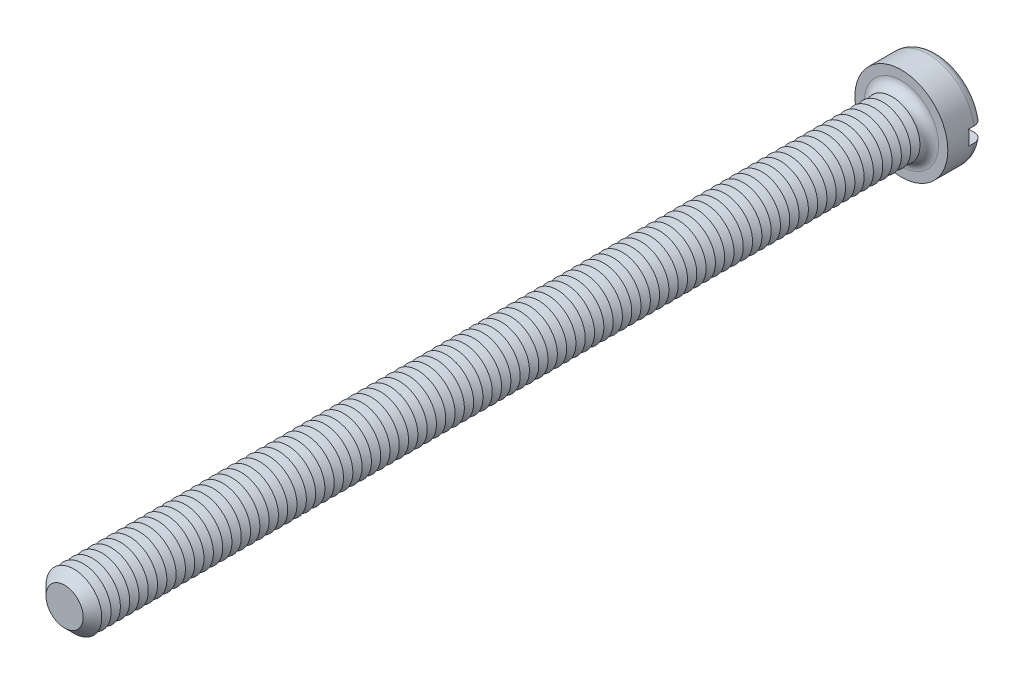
ISO-10303-21;
HEADER;
FILE_DESCRIPTION(('STEP AP214'),'2;1');
FILE_NAME('part.step','',(''),(''),'','','');
FILE_SCHEMA(('AUTOMOTIVE_DESIGN { 1 0 10303 214 1 1 1 1 }'));
ENDSEC;
DATA;
#1=APPLICATION_CONTEXT('core data for automotive mechanical design processes');
#2=APPLICATION_PROTOCOL_DEFINITION('international standard','automotive_design',2000,#1);
#3=PRODUCT_CONTEXT('',#1,'mechanical');
#4=PRODUCT('Part','Part','',(#3));
#5=PRODUCT_RELATED_PRODUCT_CATEGORY('part','',(#4));
#6=PRODUCT_DEFINITION_FORMATION('','',#4);
#7=PRODUCT_DEFINITION_CONTEXT('part definition',#1,'design');
#8=PRODUCT_DEFINITION('design','',#6,#7);
#9=PRODUCT_DEFINITION_SHAPE('','',#8);
#10=(LENGTH_UNIT() NAMED_UNIT(*) SI_UNIT(.MILLI.,.METRE.));
#11=(NAMED_UNIT(*) PLANE_ANGLE_UNIT() SI_UNIT($,.RADIAN.));
#12=(NAMED_UNIT(*) SI_UNIT($,.STERADIAN.) SOLID_ANGLE_UNIT());
#13=UNCERTAINTY_MEASURE_WITH_UNIT(LENGTH_MEASURE(1.E-05),#10,'distance_accuracy_value','');
#14=(GEOMETRIC_REPRESENTATION_CONTEXT(3) GLOBAL_UNCERTAINTY_ASSIGNED_CONTEXT((#13)) GLOBAL_UNIT_ASSIGNED_CONTEXT((#10,
#11,#12)) REPRESENTATION_CONTEXT('',''));
#15=CARTESIAN_POINT('',(0.,0.,0.));
#16=DIRECTION('',(0.,0.,1.));
#17=DIRECTION('',(1.,0.,0.));
#18=AXIS2_PLACEMENT_3D('',#15,#16,#17);
#19=CARTESIAN_POINT('',(0.,0.,-3.9));
#20=DIRECTION('',(0.,0.,1.));
#21=DIRECTION('',(1.,0.,0.));
#22=AXIS2_PLACEMENT_3D('',#19,#20,#21);
#23=PLANE('',#22);
#24=CARTESIAN_POINT('',(0.,0.,-3.9));
#25=DIRECTION('',(0.,0.,1.));
#26=DIRECTION('',(1.,0.,0.));
#27=AXIS2_PLACEMENT_3D('',#24,#25,#26);
#28=CIRCLE('',#27,4.);
#29=CARTESIAN_POINT('',(-3.91918358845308,0.800000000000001,-3.9));
#30=VERTEX_POINT('',#29);
#31=CARTESIAN_POINT('',(3.91918358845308,0.8,-3.9));
#32=VERTEX_POINT('',#31);
#33=EDGE_CURVE('E116',#30,#32,#28,.F.);
#34=ORIENTED_EDGE('',*,*,#33,.T.);
#35=DIRECTION('',(1.,0.,0.));
#36=VECTOR('',#35,1.);
#37=CARTESIAN_POINT('',(-5.,0.800000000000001,-3.9));
#38=LINE('',#37,#36);
#39=EDGE_CURVE('E111',#30,#32,#38,.T.);
#40=ORIENTED_EDGE('',*,*,#39,.F.);
#41=EDGE_LOOP('',(#34,#40));
#42=FACE_BOUND('',#41,.T.);
#43=ADVANCED_FACE('F39',(#42),#23,.F.);
#44=CARTESIAN_POINT('',(0.,0.,-2.9));
#45=DIRECTION('',(0.,0.,1.));
#46=DIRECTION('',(1.,0.,0.));
#47=AXIS2_PLACEMENT_3D('',#44,#45,#46);
#48=TOROIDAL_SURFACE('',#47,4.,1.);
#49=CARTESIAN_POINT('',(-4.76648512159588,0.800000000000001,-3.45304061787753));
#50=CARTESIAN_POINT('',(-4.73486405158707,0.800000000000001,-3.50001565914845));
#51=CARTESIAN_POINT('',(-4.69920787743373,0.800000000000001,-3.54432871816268));
#52=CARTESIAN_POINT('',(-4.62090302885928,0.800000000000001,-3.62634638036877));
#53=CARTESIAN_POINT('',(-4.57824494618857,0.800000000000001,-3.66404194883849));
#54=CARTESIAN_POINT('',(-4.48726975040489,0.800000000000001,-3.73172278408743));
#55=CARTESIAN_POINT('',(-4.43895902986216,0.800000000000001,-3.76171664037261));
#56=CARTESIAN_POINT('',(-4.33804923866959,0.800000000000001,-3.81326437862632));
#57=CARTESIAN_POINT('',(-4.2854512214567,0.800000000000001,-3.8348203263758));
#58=CARTESIAN_POINT('',(-4.17679895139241,0.800000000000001,-3.86918431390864));
#59=CARTESIAN_POINT('',(-4.12071163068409,0.800000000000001,-3.88188775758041));
#60=CARTESIAN_POINT('',(-4.00720729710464,0.800000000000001,-3.89785932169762));
#61=CARTESIAN_POINT('',(-3.94979011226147,0.800000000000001,-3.9011262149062));
#62=CARTESIAN_POINT('',(-3.83429042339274,0.800000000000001,-3.89816676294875));
#63=CARTESIAN_POINT('',(-3.77621176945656,0.800000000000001,-3.89178937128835));
#64=CARTESIAN_POINT('',(-3.66191938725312,0.800000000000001,-3.8694726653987));
#65=CARTESIAN_POINT('',(-3.60570580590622,0.800000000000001,-3.85353259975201));
#66=CARTESIAN_POINT('',(-3.49618749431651,0.800000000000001,-3.81233202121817));
#67=CARTESIAN_POINT('',(-3.44291561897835,0.800000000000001,-3.78698406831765));
#68=CARTESIAN_POINT('',(-3.34140774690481,0.800000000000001,-3.72766098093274));
#69=CARTESIAN_POINT('',(-3.29317182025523,0.800000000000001,-3.69368572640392));
#70=CARTESIAN_POINT('',(-3.20343355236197,0.800000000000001,-3.6182054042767));
#71=CARTESIAN_POINT('',(-3.16189680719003,0.800000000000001,-3.57674128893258));
#72=CARTESIAN_POINT('',(-3.08658236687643,0.800000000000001,-3.48727547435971));
#73=CARTESIAN_POINT('',(-3.05280364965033,0.800000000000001,-3.43927463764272));
#74=CARTESIAN_POINT('',(-2.99489532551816,0.800000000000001,-3.33932895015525));
#75=CARTESIAN_POINT('',(-2.97055012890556,0.800000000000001,-3.28750911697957));
#76=CARTESIAN_POINT('',(-2.93124252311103,0.800000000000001,-3.18042600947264));
#77=CARTESIAN_POINT('',(-2.91627793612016,0.800000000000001,-3.12516353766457));
#78=CARTESIAN_POINT('',(-2.89663075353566,0.800000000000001,-3.01470560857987));
#79=CARTESIAN_POINT('',(-2.89162828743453,0.800000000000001,-2.95956691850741));
#80=CARTESIAN_POINT('',(-2.89112479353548,0.800000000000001,-2.84924961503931));
#81=CARTESIAN_POINT('',(-2.89562264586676,0.800000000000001,-2.79407100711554));
#82=CARTESIAN_POINT('',(-2.91379565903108,0.800000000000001,-2.6861912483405));
#83=CARTESIAN_POINT('',(-2.92731815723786,0.800000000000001,-2.63346424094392));
#84=CARTESIAN_POINT('',(-2.96290888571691,0.800000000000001,-2.53098203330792));
#85=CARTESIAN_POINT('',(-2.98497757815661,0.800000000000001,-2.48122699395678));
#86=CARTESIAN_POINT('',(-3.03728055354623,0.800000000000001,-2.38535286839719));
#87=CARTESIAN_POINT('',(-3.06761989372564,0.800000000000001,-2.33929117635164));
#88=CARTESIAN_POINT('',(-3.13537950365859,0.800000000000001,-2.2527125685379));
#89=CARTESIAN_POINT('',(-3.17280082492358,0.800000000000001,-2.21219647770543));
#90=CARTESIAN_POINT('',(-3.2549164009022,0.800000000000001,-2.13651195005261));
#91=CARTESIAN_POINT('',(-3.29980186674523,0.800000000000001,-2.10155095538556));
#92=CARTESIAN_POINT('',(-3.39467666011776,0.800000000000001,-2.03942270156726));
#93=CARTESIAN_POINT('',(-3.44466673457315,0.800000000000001,-2.01225658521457));
#94=CARTESIAN_POINT('',(-3.5497933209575,0.800000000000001,-1.96576935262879));
#95=CARTESIAN_POINT('',(-3.60503228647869,0.800000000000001,-1.94667963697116));
#96=CARTESIAN_POINT('',(-3.71791613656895,0.800000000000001,-1.91794308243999));
#97=CARTESIAN_POINT('',(-3.77556119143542,0.800000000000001,-1.90829691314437));
#98=CARTESIAN_POINT('',(-3.89221522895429,0.800000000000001,-1.89869331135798));
#99=CARTESIAN_POINT('',(-3.9512319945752,0.800000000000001,-1.89882985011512));
#100=CARTESIAN_POINT('',(-4.06839541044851,0.800000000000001,-1.90907818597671));
#101=CARTESIAN_POINT('',(-4.12654207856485,0.800000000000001,-1.91918977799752));
#102=CARTESIAN_POINT('',(-4.23988103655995,0.800000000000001,-1.9490667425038));
#103=CARTESIAN_POINT('',(-4.29509069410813,0.800000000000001,-1.96876615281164));
#104=CARTESIAN_POINT('',(-4.40134194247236,0.800000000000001,-2.01729572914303));
#105=CARTESIAN_POINT('',(-4.45238383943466,0.800000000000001,-2.04612522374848));
#106=CARTESIAN_POINT('',(-4.54801343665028,0.800000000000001,-2.1116316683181));
#107=CARTESIAN_POINT('',(-4.59268768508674,0.800000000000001,-2.14818225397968));
#108=CARTESIAN_POINT('',(-4.67513924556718,0.800000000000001,-2.22837632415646));
#109=CARTESIAN_POINT('',(-4.71291715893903,0.800000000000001,-2.27201918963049));
#110=CARTESIAN_POINT('',(-4.77986554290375,0.800000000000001,-2.36439990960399));
#111=CARTESIAN_POINT('',(-4.80916462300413,0.800000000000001,-2.41304457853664));
#112=CARTESIAN_POINT('',(-4.85906149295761,0.800000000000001,-2.51460659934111));
#113=CARTESIAN_POINT('',(-4.8796602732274,0.800000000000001,-2.56752346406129));
#114=CARTESIAN_POINT('',(-4.9113264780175,0.800000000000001,-2.67542592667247));
#115=CARTESIAN_POINT('',(-4.92250819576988,0.800000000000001,-2.73037800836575));
#116=CARTESIAN_POINT('',(-4.93542682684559,0.800000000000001,-2.84139649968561));
#117=CARTESIAN_POINT('',(-4.93716171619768,0.800000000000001,-2.89746314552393));
#118=CARTESIAN_POINT('',(-4.93114851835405,0.800000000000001,-3.00876455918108));
#119=CARTESIAN_POINT('',(-4.92345325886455,0.800000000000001,-3.0640022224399));
#120=CARTESIAN_POINT('',(-4.8989032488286,0.800000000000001,-3.17235240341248));
#121=CARTESIAN_POINT('',(-4.88205998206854,0.800000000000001,-3.22546749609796));
#122=CARTESIAN_POINT('',(-4.84819200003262,0.800000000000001,-3.30764066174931));
#123=CARTESIAN_POINT('',(-4.83390853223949,0.800000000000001,-3.33785845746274));
#124=CARTESIAN_POINT('',(-4.80237957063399,0.800000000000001,-3.39670633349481));
#125=CARTESIAN_POINT('',(-4.78513409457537,0.800000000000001,-3.42533642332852));
#126=CARTESIAN_POINT('',(-4.76648512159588,0.800000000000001,-3.45304061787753));
#127=B_SPLINE_CURVE_WITH_KNOTS('',3,(#49,#50,#51,#52,#53,#54,#55,#56,#57,#58,#59,#60,#61,#62,
#63,#64,#65,#66,#67,#68,#69,#70,#71,#72,#73,#74,#75,#76,#77,#78,#79,#80,#81,#82,#83,#84,#85,#86,
#87,#88,#89,#90,#91,#92,#93,#94,#95,#96,#97,#98,#99,#100,#101,#102,#103,#104,#105,#106,#107,
#108,#109,#110,#111,#112,#113,#114,#115,#116,#117,#118,#119,#120,#121,#122,#123,#124,#125,#126),
.UNSPECIFIED.,.T.,.F.,(4,2,2,2,2,2,2,2,2,2,2,2,2,2,2,2,2,2,2,2,2,2,2,2,2,2,2,2,2,2,2,2,2,2,2,2,
2,2,4),(0.,0.169755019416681,0.339740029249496,0.509534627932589,0.67928763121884,
0.851013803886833,1.02276230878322,1.19722869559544,1.37170879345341,1.54785292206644,
1.72399950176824,1.89921049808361,2.07439839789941,2.24530597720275,2.41617386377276,
2.58146078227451,2.74672821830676,2.90926852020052,3.0718176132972,3.2365363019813,
3.40127946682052,3.57118676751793,3.74111896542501,3.91563534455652,4.09016409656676,
4.26636956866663,4.4425714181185,4.61757781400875,4.79257134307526,4.96489650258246,
5.13720662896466,5.30674670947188,5.47626748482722,5.64369988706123,5.81116816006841,
5.97770254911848,6.14402836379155,6.24414438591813,6.34425980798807),.UNSPECIFIED.);
#128=CARTESIAN_POINT('',(-4.93558507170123,0.800000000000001,-2.9));
#129=VERTEX_POINT('',#128);
#130=EDGE_CURVE('E883',#129,#30,#127,.T.);
#131=ORIENTED_EDGE('',*,*,#130,.F.);
#132=CARTESIAN_POINT('',(0.,0.,-2.9));
#133=DIRECTION('',(0.,0.,1.));
#134=DIRECTION('',(1.,0.,0.));
#135=AXIS2_PLACEMENT_3D('',#132,#133,#134);
#136=CIRCLE('',#135,5.);
#137=CARTESIAN_POINT('',(4.93558507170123,0.8,-2.9));
#138=VERTEX_POINT('',#137);
#139=EDGE_CURVE('E125',#138,#129,#136,.T.);
#140=ORIENTED_EDGE('',*,*,#139,.F.);
#141=CARTESIAN_POINT('',(2.98553785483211,0.8,-3.31649797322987));
#142=CARTESIAN_POINT('',(3.00991125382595,0.8,-3.36788093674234));
#143=CARTESIAN_POINT('',(3.03875556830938,0.8,-3.41719756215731));
#144=CARTESIAN_POINT('',(3.1043993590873,0.8,-3.51028676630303));
#145=CARTESIAN_POINT('',(3.1412115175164,0.8,-3.55405032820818));
#146=CARTESIAN_POINT('',(3.22153641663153,0.8,-3.63476402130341));
#147=CARTESIAN_POINT('',(3.26503706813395,0.8,-3.67172618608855));
#148=CARTESIAN_POINT('',(3.35749627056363,0.8,-3.73799476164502));
#149=CARTESIAN_POINT('',(3.4064533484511,0.8,-3.76730323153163));
#150=CARTESIAN_POINT('',(3.5095773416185,0.8,-3.81809642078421));
#151=CARTESIAN_POINT('',(3.56383317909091,0.8,-3.83940072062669));
#152=CARTESIAN_POINT('',(3.67513017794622,0.8,-3.87272481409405));
#153=CARTESIAN_POINT('',(3.7321717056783,0.8,-3.88474338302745));
#154=CARTESIAN_POINT('',(3.84815688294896,0.8,-3.89923413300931));
#155=CARTESIAN_POINT('',(3.90711516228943,0.8,-3.9015896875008));
#156=CARTESIAN_POINT('',(4.02458610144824,0.8,-3.89631753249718));
#157=CARTESIAN_POINT('',(4.08309876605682,0.8,-3.8886899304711));
#158=CARTESIAN_POINT('',(4.19768646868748,0.8,-3.86366584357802));
#159=CARTESIAN_POINT('',(4.25377243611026,0.8,-3.84631948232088));
#160=CARTESIAN_POINT('',(4.3621676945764,0.8,-3.80231797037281));
#161=CARTESIAN_POINT('',(4.41447726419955,0.8,-3.77566350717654));
#162=CARTESIAN_POINT('',(4.51300872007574,0.8,-3.71421163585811));
#163=CARTESIAN_POINT('',(4.5593085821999,0.8,-3.67953927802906));
#164=CARTESIAN_POINT('',(4.64530675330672,0.8,-3.60279495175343));
#165=CARTESIAN_POINT('',(4.68500564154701,0.8,-3.56072363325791));
#166=CARTESIAN_POINT('',(4.75599202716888,0.8,-3.47111750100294));
#167=CARTESIAN_POINT('',(4.7874061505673,0.8,-3.42368298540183));
#168=CARTESIAN_POINT('',(4.84170328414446,0.8,-3.32415927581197));
#169=CARTESIAN_POINT('',(4.86458695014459,0.8,-3.2720704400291));
#170=CARTESIAN_POINT('',(4.90088120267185,0.8,-3.16544016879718));
#171=CARTESIAN_POINT('',(4.91440984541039,0.8,-3.11093889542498));
#172=CARTESIAN_POINT('',(4.93205429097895,0.8,-3.00043391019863));
#173=CARTESIAN_POINT('',(4.93617053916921,0.8,-2.9444302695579));
#174=CARTESIAN_POINT('',(4.93486973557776,0.8,-2.83292218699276));
#175=CARTESIAN_POINT('',(4.92951827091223,0.8,-2.77741696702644));
#176=CARTESIAN_POINT('',(4.90957104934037,0.8,-2.66809456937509));
#177=CARTESIAN_POINT('',(4.89497541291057,0.8,-2.61427736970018));
#178=CARTESIAN_POINT('',(4.85697876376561,0.8,-2.50985095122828));
#179=CARTESIAN_POINT('',(4.83357805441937,0.8,-2.45924162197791));
#180=CARTESIAN_POINT('',(4.77866660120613,0.8,-2.36263484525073));
#181=CARTESIAN_POINT('',(4.74715567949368,0.8,-2.31663749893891));
#182=CARTESIAN_POINT('',(4.67670791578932,0.8,-2.23021464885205));
#183=CARTESIAN_POINT('',(4.6377224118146,0.8,-2.1898288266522));
#184=CARTESIAN_POINT('',(4.55359880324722,0.8,-2.11607828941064));
#185=CARTESIAN_POINT('',(4.50846036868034,0.8,-2.08271395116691));
#186=CARTESIAN_POINT('',(4.41271544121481,0.8,-2.02349513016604));
#187=CARTESIAN_POINT('',(4.36204749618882,0.8,-1.99774003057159));
#188=CARTESIAN_POINT('',(4.257155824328,0.8,-1.95495040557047));
#189=CARTESIAN_POINT('',(4.20293181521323,0.8,-1.93791657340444));
#190=CARTESIAN_POINT('',(4.09154156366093,0.8,-1.91276335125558));
#191=CARTESIAN_POINT('',(4.03434212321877,0.8,-1.90479098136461));
#192=CARTESIAN_POINT('',(3.91941228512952,0.8,-1.89840884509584));
#193=CARTESIAN_POINT('',(3.8616818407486,0.8,-1.89999992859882));
#194=CARTESIAN_POINT('',(3.7464111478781,0.8,-1.91275144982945));
#195=CARTESIAN_POINT('',(3.6888866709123,0.8,-1.92405471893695));
#196=CARTESIAN_POINT('',(3.57652290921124,0.8,-1.95609086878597));
#197=CARTESIAN_POINT('',(3.52168382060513,0.8,-1.97682443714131));
#198=CARTESIAN_POINT('',(3.41589179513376,0.8,-2.02733294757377));
#199=CARTESIAN_POINT('',(3.36496676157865,0.8,-2.05716640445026));
#200=CARTESIAN_POINT('',(3.26890903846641,0.8,-2.12504079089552));
#201=CARTESIAN_POINT('',(3.22377627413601,0.8,-2.16308161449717));
#202=CARTESIAN_POINT('',(3.141135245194,0.8,-2.24593284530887));
#203=CARTESIAN_POINT('',(3.1035541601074,0.8,-2.29067053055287));
#204=CARTESIAN_POINT('',(3.03669700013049,0.8,-2.38597317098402));
#205=CARTESIAN_POINT('',(3.00741914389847,0.8,-2.43653687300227));
#206=CARTESIAN_POINT('',(2.95891799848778,0.8,-2.54052959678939));
#207=CARTESIAN_POINT('',(2.93943249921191,0.8,-2.59383627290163));
#208=CARTESIAN_POINT('',(2.9100081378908,0.8,-2.70303736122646));
#209=CARTESIAN_POINT('',(2.90006970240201,0.8,-2.75893188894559));
#210=CARTESIAN_POINT('',(2.89027863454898,0.8,-2.86986958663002));
#211=CARTESIAN_POINT('',(2.89012791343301,0.8,-2.92488680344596));
#212=CARTESIAN_POINT('',(2.89917145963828,0.8,-3.03409648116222));
#213=CARTESIAN_POINT('',(2.90835313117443,0.8,-3.08828995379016));
#214=CARTESIAN_POINT('',(2.92977618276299,0.8,-3.17141652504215));
#215=CARTESIAN_POINT('',(2.93899011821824,0.8,-3.20116372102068));
#216=CARTESIAN_POINT('',(2.96020249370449,0.8,-3.25964614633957));
#217=CARTESIAN_POINT('',(2.97220082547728,0.8,-3.28838141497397));
#218=CARTESIAN_POINT('',(2.98553785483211,0.8,-3.31649797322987));
#219=B_SPLINE_CURVE_WITH_KNOTS('',3,(#141,#142,#143,#144,#145,#146,#147,#148,#149,#150,#151,
#152,#153,#154,#155,#156,#157,#158,#159,#160,#161,#162,#163,#164,#165,#166,#167,#168,#169,#170,
#171,#172,#173,#174,#175,#176,#177,#178,#179,#180,#181,#182,#183,#184,#185,#186,#187,#188,#189,
#190,#191,#192,#193,#194,#195,#196,#197,#198,#199,#200,#201,#202,#203,#204,#205,#206,#207,#208,
#209,#210,#211,#212,#213,#214,#215,#216,#217,#218),.UNSPECIFIED.,.T.,.F.,(4,2,2,2,2,2,2,2,2,2,2,
2,2,2,2,2,2,2,2,2,2,2,2,2,2,2,2,2,2,2,2,2,2,2,2,2,2,2,4),(0.,0.170493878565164,
0.341261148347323,0.511723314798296,0.682139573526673,0.856194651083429,1.03027268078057,
1.20644565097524,1.38261672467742,1.55788746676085,1.73314526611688,1.90583484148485,
2.07850925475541,2.24836742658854,2.41821253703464,2.58587311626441,2.75352576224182,
2.92002154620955,3.08651516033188,3.25300303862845,3.41949456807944,3.58710926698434,
3.75473295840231,3.92445790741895,4.09419634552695,4.26665110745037,4.43912119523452,
4.61417197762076,4.78923552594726,4.96544940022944,5.1416609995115,5.31608191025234,
5.49046537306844,5.65989063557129,5.82932346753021,5.99359365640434,6.157642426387,
6.250939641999,6.34423323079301),.UNSPECIFIED.);
#220=EDGE_CURVE('E885',#32,#138,#219,.T.);
#221=ORIENTED_EDGE('',*,*,#220,.F.);
#222=ORIENTED_EDGE('',*,*,#33,.F.);
#223=EDGE_LOOP('',(#131,#140,#221,#222));
#224=FACE_BOUND('',#223,.T.);
#225=ADVANCED_FACE('F867',(#224),#48,.T.);
#226=CARTESIAN_POINT('',(0.,0.,-3.9));
#227=DIRECTION('',(0.,0.,1.));
#228=DIRECTION('',(1.,0.,0.));
#229=AXIS2_PLACEMENT_3D('',#226,#227,#228);
#230=CYLINDRICAL_SURFACE('',#229,5.);
#231=DIRECTION('',(0.,0.,1.));
#232=VECTOR('',#231,1.);
#233=CARTESIAN_POINT('',(4.93558507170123,0.8,-3.9));
#234=LINE('',#233,#232);
#235=CARTESIAN_POINT('',(4.93558507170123,0.8,-2.3));
#236=VERTEX_POINT('',#235);
#237=EDGE_CURVE('E899',#138,#236,#234,.T.);
#238=ORIENTED_EDGE('',*,*,#237,.F.);
#239=ORIENTED_EDGE('',*,*,#139,.T.);
#240=DIRECTION('',(0.,0.,1.));
#241=VECTOR('',#240,1.);
#242=CARTESIAN_POINT('',(-4.93558507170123,0.800000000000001,-3.9));
#243=LINE('',#242,#241);
#244=CARTESIAN_POINT('',(-4.93558507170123,0.800000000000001,-2.3));
#245=VERTEX_POINT('',#244);
#246=EDGE_CURVE('E63',#245,#129,#243,.F.);
#247=ORIENTED_EDGE('',*,*,#246,.F.);
#248=CARTESIAN_POINT('',(0.,0.,-2.3));
#249=DIRECTION('',(0.,0.,-1.));
#250=DIRECTION('',(-1.,0.,0.));
#251=AXIS2_PLACEMENT_3D('',#248,#249,#250);
#252=CIRCLE('',#251,5.);
#253=CARTESIAN_POINT('',(-4.93558507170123,-0.799999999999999,-2.3));
#254=VERTEX_POINT('',#253);
#255=EDGE_CURVE('E43',#245,#254,#252,.F.);
#256=ORIENTED_EDGE('',*,*,#255,.T.);
#257=DIRECTION('',(0.,0.,1.));
#258=VECTOR('',#257,1.);
#259=CARTESIAN_POINT('',(-4.93558507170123,-0.799999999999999,-3.9));
#260=LINE('',#259,#258);
#261=CARTESIAN_POINT('',(-4.93558507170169,-0.799999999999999,-2.89999999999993));
#262=VERTEX_POINT('',#261);
#263=EDGE_CURVE('E896',#262,#254,#260,.T.);
#264=ORIENTED_EDGE('',*,*,#263,.F.);
#265=CARTESIAN_POINT('',(4.93558507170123,-0.8,-2.9));
#266=VERTEX_POINT('',#265);
#267=EDGE_CURVE('E127',#262,#266,#136,.T.);
#268=ORIENTED_EDGE('',*,*,#267,.T.);
#269=DIRECTION('',(0.,0.,1.));
#270=VECTOR('',#269,1.);
#271=CARTESIAN_POINT('',(4.93558507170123,-0.8,-3.9));
#272=LINE('',#271,#270);
#273=CARTESIAN_POINT('',(4.93558507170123,-0.8,-2.3));
#274=VERTEX_POINT('',#273);
#275=EDGE_CURVE('E55',#274,#266,#272,.F.);
#276=ORIENTED_EDGE('',*,*,#275,.F.);
#277=EDGE_CURVE('E11',#274,#236,#252,.F.);
#278=ORIENTED_EDGE('',*,*,#277,.T.);
#279=EDGE_LOOP('',(#238,#239,#247,#256,#264,#268,#276,#278));
#280=FACE_BOUND('',#279,.T.);
#281=CARTESIAN_POINT('',(0.,0.,0.));
#282=DIRECTION('',(0.,0.,1.));
#283=DIRECTION('',(1.,0.,0.));
#284=AXIS2_PLACEMENT_3D('',#281,#282,#283);
#285=CIRCLE('',#284,5.);
#286=CARTESIAN_POINT('',(5.,0.,0.));
#287=VERTEX_POINT('',#286);
#288=EDGE_CURVE('E902',#287,#287,#285,.T.);
#289=ORIENTED_EDGE('',*,*,#288,.F.);
#290=EDGE_LOOP('',(#289));
#291=FACE_BOUND('',#290,.T.);
#292=ADVANCED_FACE('F863',(#280,#291),#230,.T.);
#293=CARTESIAN_POINT('',(3.91918358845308,-0.8,-3.9));
#294=VERTEX_POINT('',#293);
#295=CARTESIAN_POINT('',(-3.91918358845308,-0.799999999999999,-3.9));
#296=VERTEX_POINT('',#295);
#297=EDGE_CURVE('E109',#294,#296,#28,.F.);
#298=ORIENTED_EDGE('',*,*,#297,.T.);
#299=DIRECTION('',(-1.,0.,0.));
#300=VECTOR('',#299,1.);
#301=CARTESIAN_POINT('',(-5.,-0.799999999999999,-3.9));
#302=LINE('',#301,#300);
#303=EDGE_CURVE('E96',#294,#296,#302,.T.);
#304=ORIENTED_EDGE('',*,*,#303,.F.);
#305=EDGE_LOOP('',(#298,#304));
#306=FACE_BOUND('',#305,.T.);
#307=ADVANCED_FACE('F108',(#306),#23,.F.);
#308=CARTESIAN_POINT('',(0.,0.,0.));
#309=DIRECTION('',(0.,0.,1.));
#310=DIRECTION('',(1.,0.,0.));
#311=AXIS2_PLACEMENT_3D('',#308,#309,#310);
#312=PLANE('',#311);
#313=CARTESIAN_POINT('',(0.,0.,0.));
#314=DIRECTION('',(0.,0.,1.));
#315=DIRECTION('',(1.,0.,0.));
#316=AXIS2_PLACEMENT_3D('',#313,#314,#315);
#317=CIRCLE('',#316,4.);
#318=CARTESIAN_POINT('',(4.,0.,0.));
#319=VERTEX_POINT('',#318);
#320=EDGE_CURVE('E115',#319,#319,#317,.F.);
#321=ORIENTED_EDGE('',*,*,#320,.T.);
#322=EDGE_LOOP('',(#321));
#323=FACE_BOUND('',#322,.T.);
#324=ORIENTED_EDGE('',*,*,#288,.T.);
#325=EDGE_LOOP('',(#324));
#326=FACE_BOUND('',#325,.T.);
#327=ADVANCED_FACE('F862',(#323,#326),#312,.T.);
#328=CARTESIAN_POINT('',(-4.76648512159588,-0.799999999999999,-3.45304061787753));
#329=CARTESIAN_POINT('',(-4.7975694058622,-0.799999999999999,-3.40685392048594));
#330=CARTESIAN_POINT('',(-4.82479903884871,-0.799999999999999,-3.35802740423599));
#331=CARTESIAN_POINT('',(-4.87070632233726,-0.799999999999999,-3.25646127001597));
#332=CARTESIAN_POINT('',(-4.8893747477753,-0.799999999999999,-3.20371750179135));
#333=CARTESIAN_POINT('',(-4.91756720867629,-0.799999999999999,-3.09584501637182));
#334=CARTESIAN_POINT('',(-4.92709302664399,-0.799999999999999,-3.04071676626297));
#335=CARTESIAN_POINT('',(-4.93671217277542,-0.799999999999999,-2.92965669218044));
#336=CARTESIAN_POINT('',(-4.93680767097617,-0.799999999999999,-2.87372505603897));
#337=CARTESIAN_POINT('',(-4.92758675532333,-0.799999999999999,-2.76284675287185));
#338=CARTESIAN_POINT('',(-4.91830421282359,-0.799999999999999,-2.70789726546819));
#339=CARTESIAN_POINT('',(-4.89065741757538,-0.799999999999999,-2.60033228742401));
#340=CARTESIAN_POINT('',(-4.87229291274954,-0.799999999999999,-2.54771686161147));
#341=CARTESIAN_POINT('',(-4.82699855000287,-0.799999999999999,-2.44622441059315));
#342=CARTESIAN_POINT('',(-4.80005659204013,-0.799999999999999,-2.39735278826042));
#343=CARTESIAN_POINT('',(-4.73841244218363,-0.799999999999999,-2.30477947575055));
#344=CARTESIAN_POINT('',(-4.70371003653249,-0.799999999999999,-2.26107792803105));
#345=CARTESIAN_POINT('',(-4.62724516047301,-0.799999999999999,-2.17969334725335));
#346=CARTESIAN_POINT('',(-4.58542787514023,-0.799999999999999,-2.14206183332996));
#347=CARTESIAN_POINT('',(-4.49614171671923,-0.799999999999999,-2.07424284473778));
#348=CARTESIAN_POINT('',(-4.44867251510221,-0.799999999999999,-2.04405580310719));
#349=CARTESIAN_POINT('',(-4.34875035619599,-0.799999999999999,-1.99153688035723));
#350=CARTESIAN_POINT('',(-4.29623870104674,-0.799999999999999,-1.96931670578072));
#351=CARTESIAN_POINT('',(-4.18826905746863,-0.799999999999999,-1.93384994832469));
#352=CARTESIAN_POINT('',(-4.1328108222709,-0.799999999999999,-1.92060411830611));
#353=CARTESIAN_POINT('',(-4.01956054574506,-0.799999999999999,-1.90323798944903));
#354=CARTESIAN_POINT('',(-3.96174522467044,-0.799999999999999,-1.89926947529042));
#355=CARTESIAN_POINT('',(-3.84625419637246,-0.799999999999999,-1.90095183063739));
#356=CARTESIAN_POINT('',(-3.78857850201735,-0.799999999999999,-1.90660355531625));
#357=CARTESIAN_POINT('',(-3.67415602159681,-0.799999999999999,-1.92748272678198));
#358=CARTESIAN_POINT('',(-3.61743328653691,-0.799999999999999,-1.94284216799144));
#359=CARTESIAN_POINT('',(-3.50734962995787,-0.799999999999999,-1.9828275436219));
#360=CARTESIAN_POINT('',(-3.4539889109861,-0.799999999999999,-2.00745403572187));
#361=CARTESIAN_POINT('',(-3.35197118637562,-0.799999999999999,-2.06542964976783));
#362=CARTESIAN_POINT('',(-3.30333217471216,-0.799999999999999,-2.0988104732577));
#363=CARTESIAN_POINT('',(-3.21244692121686,-0.799999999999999,-2.17337326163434));
#364=CARTESIAN_POINT('',(-3.17020039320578,-0.799999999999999,-2.21455487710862));
#365=CARTESIAN_POINT('',(-3.0940098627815,-0.799999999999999,-2.30296695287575));
#366=CARTESIAN_POINT('',(-3.05995540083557,-0.799999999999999,-2.35010211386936));
#367=CARTESIAN_POINT('',(-3.00053815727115,-0.799999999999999,-2.4495670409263));
#368=CARTESIAN_POINT('',(-2.97517362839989,-0.799999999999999,-2.50189576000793));
#369=CARTESIAN_POINT('',(-2.93470320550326,-0.799999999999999,-2.60853979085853));
#370=CARTESIAN_POINT('',(-2.91930557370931,-0.799999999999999,-2.66274437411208));
#371=CARTESIAN_POINT('',(-2.89812734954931,-0.799999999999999,-2.77299836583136));
#372=CARTESIAN_POINT('',(-2.89234481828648,-0.799999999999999,-2.82904740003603));
#373=CARTESIAN_POINT('',(-2.89064073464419,-0.799999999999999,-2.93970612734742));
#374=CARTESIAN_POINT('',(-2.89444549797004,-0.799999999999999,-2.99431180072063));
#375=CARTESIAN_POINT('',(-2.9112006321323,-0.799999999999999,-3.10209766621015));
#376=CARTESIAN_POINT('',(-2.9241507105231,-0.799999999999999,-3.1552779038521));
#377=CARTESIAN_POINT('',(-2.95868580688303,-0.799999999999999,-3.25858631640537));
#378=CARTESIAN_POINT('',(-2.98024709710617,-0.799999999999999,-3.30872244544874));
#379=CARTESIAN_POINT('',(-3.03128544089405,-0.799999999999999,-3.40478519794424));
#380=CARTESIAN_POINT('',(-3.06076335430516,-0.799999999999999,-3.45071136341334));
#381=CARTESIAN_POINT('',(-3.12753448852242,-0.799999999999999,-3.53826932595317));
#382=CARTESIAN_POINT('',(-3.16500083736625,-0.799999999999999,-3.57976901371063));
#383=CARTESIAN_POINT('',(-3.24617503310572,-0.799999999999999,-3.65613204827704));
#384=CARTESIAN_POINT('',(-3.28988388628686,-0.799999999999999,-3.69099432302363));
#385=CARTESIAN_POINT('',(-3.38380639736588,-0.799999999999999,-3.75424083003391));
#386=CARTESIAN_POINT('',(-3.43418287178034,-0.799999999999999,-3.78238342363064));
#387=CARTESIAN_POINT('',(-3.53887888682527,-0.799999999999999,-3.83000231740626));
#388=CARTESIAN_POINT('',(-3.59319889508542,-0.799999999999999,-3.84947758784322));
#389=CARTESIAN_POINT('',(-3.70539237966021,-0.799999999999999,-3.87954336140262));
#390=CARTESIAN_POINT('',(-3.76331464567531,-0.799999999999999,-3.88995217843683));
#391=CARTESIAN_POINT('',(-3.88008461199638,-0.799999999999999,-3.9009132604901));
#392=CARTESIAN_POINT('',(-3.93893230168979,-0.799999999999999,-3.9014656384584));
#393=CARTESIAN_POINT('',(-4.05594892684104,-0.799999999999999,-3.89264187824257));
#394=CARTESIAN_POINT('',(-4.11411702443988,-0.799999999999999,-3.88325457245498));
#395=CARTESIAN_POINT('',(-4.22802928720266,-0.799999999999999,-3.85472582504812));
#396=CARTESIAN_POINT('',(-4.28377297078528,-0.799999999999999,-3.83558245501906));
#397=CARTESIAN_POINT('',(-4.39054463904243,-0.799999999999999,-3.78829842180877));
#398=CARTESIAN_POINT('',(-4.44161887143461,-0.799999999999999,-3.76026208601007));
#399=CARTESIAN_POINT('',(-4.53818016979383,-0.799999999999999,-3.69589278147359));
#400=CARTESIAN_POINT('',(-4.58367442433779,-0.799999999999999,-3.65957066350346));
#401=CARTESIAN_POINT('',(-4.65208830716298,-0.799999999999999,-3.59453310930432));
#402=CARTESIAN_POINT('',(-4.67711825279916,-0.799999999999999,-3.56800018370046));
#403=CARTESIAN_POINT('',(-4.72414423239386,-0.799999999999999,-3.51236863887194));
#404=CARTESIAN_POINT('',(-4.74614029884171,-0.799999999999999,-3.48327004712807));
#405=CARTESIAN_POINT('',(-4.76648512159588,-0.799999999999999,-3.45304061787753));
#406=B_SPLINE_CURVE_WITH_KNOTS('',3,(#328,#329,#330,#331,#332,#333,#334,#335,#336,#337,#338,
#339,#340,#341,#342,#343,#344,#345,#346,#347,#348,#349,#350,#351,#352,#353,#354,#355,#356,#357,
#358,#359,#360,#361,#362,#363,#364,#365,#366,#367,#368,#369,#370,#371,#372,#373,#374,#375,#376,
#377,#378,#379,#380,#381,#382,#383,#384,#385,#386,#387,#388,#389,#390,#391,#392,#393,#394,#395,
#396,#397,#398,#399,#400,#401,#402,#403,#404,#405),.UNSPECIFIED.,.T.,.F.,(4,2,2,2,2,2,2,2,2,2,2,
2,2,2,2,2,2,2,2,2,2,2,2,2,2,2,2,2,2,2,2,2,2,2,2,2,2,2,4),(0.,0.166886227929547,
0.333951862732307,0.500984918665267,0.667979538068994,0.834373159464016,1.00077139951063,
1.16740542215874,1.33404403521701,1.50202999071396,1.67002571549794,1.84029248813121,
2.01057354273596,2.18362161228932,2.35668506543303,2.53215380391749,2.70763310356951,
2.88375684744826,3.05987270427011,3.23346085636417,3.40701408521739,3.57522519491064,
3.74340238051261,3.90683338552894,4.0702591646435,4.23323770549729,4.39623395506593,
4.56320691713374,4.7302068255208,4.90252468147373,5.07486300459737,5.25058028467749,
5.42629555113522,5.60220844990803,5.77815613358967,5.95211162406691,6.12584060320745,
6.23506966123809,6.34429754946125),.UNSPECIFIED.);
#407=EDGE_CURVE('E103',#296,#262,#406,.T.);
#408=ORIENTED_EDGE('',*,*,#407,.F.);
#409=ORIENTED_EDGE('',*,*,#297,.F.);
#410=CARTESIAN_POINT('',(2.98553785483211,-0.8,-3.31649797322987));
#411=CARTESIAN_POINT('',(2.96216773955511,-0.8,-3.26721849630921));
#412=CARTESIAN_POINT('',(2.94287503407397,-0.8,-3.21596872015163));
#413=CARTESIAN_POINT('',(2.91313258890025,-0.8,-3.11092723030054));
#414=CARTESIAN_POINT('',(2.9026902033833,-0.8,-3.0571334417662));
#415=CARTESIAN_POINT('',(2.89104377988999,-0.8,-2.94853922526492));
#416=CARTESIAN_POINT('',(2.88984130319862,-0.8,-2.89373862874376));
#417=CARTESIAN_POINT('',(2.89672585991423,-0.8,-2.78473646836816));
#418=CARTESIAN_POINT('',(2.90481120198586,-0.8,-2.73053479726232));
#419=CARTESIAN_POINT('',(2.92989134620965,-0.8,-2.62460092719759));
#420=CARTESIAN_POINT('',(2.94682969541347,-0.8,-2.57285532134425));
#421=CARTESIAN_POINT('',(2.9889990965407,-0.8,-2.47286425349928));
#422=CARTESIAN_POINT('',(3.01423103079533,-0.8,-2.42461916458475));
#423=CARTESIAN_POINT('',(3.07271536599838,-0.8,-2.33201565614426));
#424=CARTESIAN_POINT('',(3.10610710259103,-0.8,-2.28774532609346));
#425=CARTESIAN_POINT('',(3.17963417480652,-0.8,-2.205215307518));
#426=CARTESIAN_POINT('',(3.21977054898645,-0.8,-2.16695654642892));
#427=CARTESIAN_POINT('',(3.3070361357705,-0.8,-2.09624274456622));
#428=CARTESIAN_POINT('',(3.35434874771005,-0.8,-2.06401396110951));
#429=CARTESIAN_POINT('',(3.45361131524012,-0.8,-2.00773436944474));
#430=CARTESIAN_POINT('',(3.50556189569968,-0.8,-1.98368466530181));
#431=CARTESIAN_POINT('',(3.61398433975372,-0.8,-1.94389460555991));
#432=CARTESIAN_POINT('',(3.67053506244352,-0.8,-1.92836880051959));
#433=CARTESIAN_POINT('',(3.78543606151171,-0.8,-1.90696594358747));
#434=CARTESIAN_POINT('',(3.84378643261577,-0.8,-1.90108940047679));
#435=CARTESIAN_POINT('',(3.96100201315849,-0.8,-1.89918115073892));
#436=CARTESIAN_POINT('',(4.01986821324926,-0.8,-1.90320860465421));
#437=CARTESIAN_POINT('',(4.13606891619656,-0.8,-1.9211820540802));
#438=CARTESIAN_POINT('',(4.19340347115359,-0.8,-1.93512771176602));
#439=CARTESIAN_POINT('',(4.30434213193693,-0.8,-1.97243705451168));
#440=CARTESIAN_POINT('',(4.35797549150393,-0.8,-1.99571368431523));
#441=CARTESIAN_POINT('',(4.46048254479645,-0.8,-2.0510826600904));
#442=CARTESIAN_POINT('',(4.50935662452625,-0.8,-2.08317429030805));
#443=CARTESIAN_POINT('',(4.60012348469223,-0.8,-2.15471647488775));
#444=CARTESIAN_POINT('',(4.64211506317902,-0.8,-2.19404167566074));
#445=CARTESIAN_POINT('',(4.71877054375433,-0.8,-2.27928299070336));
#446=CARTESIAN_POINT('',(4.75343508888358,-0.8,-2.32519852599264));
#447=CARTESIAN_POINT('',(4.81388799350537,-0.8,-2.4215411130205));
#448=CARTESIAN_POINT('',(4.83980652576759,-0.8,-2.47188650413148));
#449=CARTESIAN_POINT('',(4.88271402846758,-0.8,-2.57624865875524));
#450=CARTESIAN_POINT('',(4.89970360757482,-0.8,-2.63026517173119));
#451=CARTESIAN_POINT('',(4.92409334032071,-0.8,-2.73978844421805));
#452=CARTESIAN_POINT('',(4.93159814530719,-0.8,-2.79527191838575));
#453=CARTESIAN_POINT('',(4.93713723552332,-0.8,-2.90670881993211));
#454=CARTESIAN_POINT('',(4.9351718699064,-0.8,-2.9626622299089));
#455=CARTESIAN_POINT('',(4.92186293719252,-0.8,-3.07317093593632));
#456=CARTESIAN_POINT('',(4.91056393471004,-0.8,-3.12773160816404));
#457=CARTESIAN_POINT('',(4.87898532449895,-0.8,-3.234187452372));
#458=CARTESIAN_POINT('',(4.85870572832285,-0.8,-3.28608262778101));
#459=CARTESIAN_POINT('',(4.80971634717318,-0.8,-3.38586723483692));
#460=CARTESIAN_POINT('',(4.78098824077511,-0.8,-3.43374766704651));
#461=CARTESIAN_POINT('',(4.71596686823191,-0.8,-3.52405937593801));
#462=CARTESIAN_POINT('',(4.67967336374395,-0.8,-3.56649048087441));
#463=CARTESIAN_POINT('',(4.60022577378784,-0.8,-3.64511036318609));
#464=CARTESIAN_POINT('',(4.5570143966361,-0.8,-3.6812412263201));
#465=CARTESIAN_POINT('',(4.4652099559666,-0.8,-3.7458530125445));
#466=CARTESIAN_POINT('',(4.41661654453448,-0.8,-3.77433344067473));
#467=CARTESIAN_POINT('',(4.31470683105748,-0.8,-3.82326981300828));
#468=CARTESIAN_POINT('',(4.26133399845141,-0.8,-3.84360800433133));
#469=CARTESIAN_POINT('',(4.15196444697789,-0.8,-3.87519515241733));
#470=CARTESIAN_POINT('',(4.09596750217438,-0.8,-3.88644332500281));
#471=CARTESIAN_POINT('',(3.98196469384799,-0.8,-3.89971870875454));
#472=CARTESIAN_POINT('',(3.92394096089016,-0.8,-3.901592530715));
#473=CARTESIAN_POINT('',(3.8083852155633,-0.8,-3.89570840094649));
#474=CARTESIAN_POINT('',(3.75085322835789,-0.8,-3.88794995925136));
#475=CARTESIAN_POINT('',(3.6371167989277,-0.8,-3.86287824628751));
#476=CARTESIAN_POINT('',(3.58093962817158,-0.8,-3.84544111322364));
#477=CARTESIAN_POINT('',(3.47227948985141,-0.8,-3.80139971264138));
#478=CARTESIAN_POINT('',(3.41979762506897,-0.8,-3.77479272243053));
#479=CARTESIAN_POINT('',(3.31994061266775,-0.8,-3.71304199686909));
#480=CARTESIAN_POINT('',(3.27257854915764,-0.8,-3.67787710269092));
#481=CARTESIAN_POINT('',(3.18459619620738,-0.8,-3.59999704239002));
#482=CARTESIAN_POINT('',(3.14396747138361,-0.8,-3.55729146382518));
#483=CARTESIAN_POINT('',(3.08341110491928,-0.8,-3.48140072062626));
#484=CARTESIAN_POINT('',(3.06118126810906,-0.8,-3.45002448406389));
#485=CARTESIAN_POINT('',(3.02047302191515,-0.8,-3.38492378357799));
#486=CARTESIAN_POINT('',(3.00199451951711,-0.8,-3.35119937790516));
#487=CARTESIAN_POINT('',(2.98553785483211,-0.8,-3.31649797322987));
#488=B_SPLINE_CURVE_WITH_KNOTS('',3,(#410,#411,#412,#413,#414,#415,#416,#417,#418,#419,#420,
#421,#422,#423,#424,#425,#426,#427,#428,#429,#430,#431,#432,#433,#434,#435,#436,#437,#438,#439,
#440,#441,#442,#443,#444,#445,#446,#447,#448,#449,#450,#451,#452,#453,#454,#455,#456,#457,#458,
#459,#460,#461,#462,#463,#464,#465,#466,#467,#468,#469,#470,#471,#472,#473,#474,#475,#476,#477,
#478,#479,#480,#481,#482,#483,#484,#485,#486,#487),.UNSPECIFIED.,.T.,.F.,(4,2,2,2,2,2,2,2,2,2,2,
2,2,2,2,2,2,2,2,2,2,2,2,2,2,2,2,2,2,2,2,2,2,2,2,2,2,2,4),(0.,0.163484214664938,
0.327104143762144,0.490751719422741,0.654369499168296,0.816956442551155,0.979560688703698,
1.14516376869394,1.31079237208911,1.48174839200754,1.6527274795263,1.82783306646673,
2.00294788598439,2.17911127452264,2.35526866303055,2.52981944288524,2.70435605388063,
2.87611266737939,3.04785420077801,3.21691347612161,3.38596122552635,3.55312700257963,
3.72028661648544,3.88665268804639,4.053018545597,4.2197478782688,4.38648246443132,
4.55467705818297,4.72288253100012,4.89343959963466,5.06401138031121,5.23736524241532,
5.41072792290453,5.58636211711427,5.76204850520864,5.93817375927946,6.11407667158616,
6.22920111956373,6.34432271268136),.UNSPECIFIED.);
#489=EDGE_CURVE('E92',#266,#294,#488,.T.);
#490=ORIENTED_EDGE('',*,*,#489,.F.);
#491=ORIENTED_EDGE('',*,*,#267,.F.);
#492=EDGE_LOOP('',(#408,#409,#490,#491));
#493=FACE_BOUND('',#492,.T.);
#494=ADVANCED_FACE('F113',(#493),#48,.T.);
#495=CARTESIAN_POINT('',(0.,0.,1.));
#496=DIRECTION('',(0.,0.,1.));
#497=DIRECTION('',(1.,0.,0.));
#498=AXIS2_PLACEMENT_3D('',#495,#496,#497);
#499=TOROIDAL_SURFACE('',#498,4.,1.);
#500=ORIENTED_EDGE('',*,*,#320,.F.);
#501=EDGE_LOOP('',(#500));
#502=FACE_BOUND('',#501,.T.);
#503=CARTESIAN_POINT('',(0.,0.,1.));
#504=DIRECTION('',(0.,0.,-1.));
#505=DIRECTION('',(-1.,0.,0.));
#506=AXIS2_PLACEMENT_3D('',#503,#504,#505);
#507=CIRCLE('',#506,3.);
#508=CARTESIAN_POINT('',(-3.,0.,1.));
#509=VERTEX_POINT('',#508);
#510=EDGE_CURVE('E908',#509,#509,#507,.T.);
#511=ORIENTED_EDGE('',*,*,#510,.T.);
#512=EDGE_LOOP('',(#511));
#513=FACE_BOUND('',#512,.T.);
#514=ADVANCED_FACE('F855',(#502,#513),#499,.F.);
#515=CARTESIAN_POINT('',(0.,0.,1.5));
#516=DIRECTION('',(0.,0.,-1.));
#517=DIRECTION('',(-1.,0.,0.));
#518=AXIS2_PLACEMENT_3D('',#515,#516,#517);
#519=CONICAL_SURFACE('',#518,2.13397459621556,1.0471975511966);
#520=ORIENTED_EDGE('',*,*,#510,.F.);
#521=EDGE_LOOP('',(#520));
#522=FACE_BOUND('',#521,.T.);
#523=CARTESIAN_POINT('',(0.,0.,1.5));
#524=DIRECTION('',(0.,0.,-1.));
#525=DIRECTION('',(-1.,0.,0.));
#526=AXIS2_PLACEMENT_3D('',#523,#524,#525);
#527=CIRCLE('',#526,2.13397459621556);
#528=CARTESIAN_POINT('',(-2.13397459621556,0.,1.5));
#529=VERTEX_POINT('',#528);
#530=EDGE_CURVE('E915',#529,#529,#527,.T.);
#531=ORIENTED_EDGE('',*,*,#530,.T.);
#532=EDGE_LOOP('',(#531));
#533=FACE_BOUND('',#532,.T.);
#534=ADVANCED_FACE('F851',(#522,#533),#519,.T.);
#535=CARTESIAN_POINT('',(0.,0.,2.));
#536=DIRECTION('',(0.,0.,1.));
#537=DIRECTION('',(1.,0.,0.));
#538=AXIS2_PLACEMENT_3D('',#535,#536,#537);
#539=CONICAL_SURFACE('',#538,3.,1.0471975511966);
#540=ORIENTED_EDGE('',*,*,#530,.F.);
#541=EDGE_LOOP('',(#540));
#542=FACE_BOUND('',#541,.T.);
#543=CARTESIAN_POINT('',(0.,0.,2.));
#544=DIRECTION('',(0.,0.,-1.));
#545=DIRECTION('',(-1.,0.,0.));
#546=AXIS2_PLACEMENT_3D('',#543,#544,#545);
#547=CIRCLE('',#546,3.);
#548=CARTESIAN_POINT('',(-3.,0.,2.));
#549=VERTEX_POINT('',#548);
#550=EDGE_CURVE('E920',#549,#549,#547,.T.);
#551=ORIENTED_EDGE('',*,*,#550,.T.);
#552=EDGE_LOOP('',(#551));
#553=FACE_BOUND('',#552,.T.);
#554=ADVANCED_FACE('F847',(#542,#553),#539,.T.);
#555=CARTESIAN_POINT('',(0.,0.,2.5));
#556=DIRECTION('',(0.,0.,-1.));
#557=DIRECTION('',(-1.,0.,0.));
#558=AXIS2_PLACEMENT_3D('',#555,#556,#557);
#559=CONICAL_SURFACE('',#558,2.13397459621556,1.0471975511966);
#560=ORIENTED_EDGE('',*,*,#550,.F.);
#561=EDGE_LOOP('',(#560));
#562=FACE_BOUND('',#561,.T.);
#563=CARTESIAN_POINT('',(0.,0.,2.5));
#564=DIRECTION('',(0.,0.,-1.));
#565=DIRECTION('',(-1.,0.,0.));
#566=AXIS2_PLACEMENT_3D('',#563,#564,#565);
#567=CIRCLE('',#566,2.13397459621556);
#568=CARTESIAN_POINT('',(-2.13397459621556,0.,2.5));
#569=VERTEX_POINT('',#568);
#570=EDGE_CURVE('E924',#569,#569,#567,.T.);
#571=ORIENTED_EDGE('',*,*,#570,.T.);
#572=EDGE_LOOP('',(#571));
#573=FACE_BOUND('',#572,.T.);
#574=ADVANCED_FACE('F843',(#562,#573),#559,.T.);
#575=CARTESIAN_POINT('',(0.,0.,3.));
#576=DIRECTION('',(0.,0.,1.));
#577=DIRECTION('',(1.,0.,0.));
#578=AXIS2_PLACEMENT_3D('',#575,#576,#577);
#579=CONICAL_SURFACE('',#578,3.,1.0471975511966);
#580=ORIENTED_EDGE('',*,*,#570,.F.);
#581=EDGE_LOOP('',(#580));
#582=FACE_BOUND('',#581,.T.);
#583=CARTESIAN_POINT('',(0.,0.,3.));
#584=DIRECTION('',(0.,0.,-1.));
#585=DIRECTION('',(-1.,0.,0.));
#586=AXIS2_PLACEMENT_3D('',#583,#584,#585);
#587=CIRCLE('',#586,3.);
#588=CARTESIAN_POINT('',(-3.,0.,3.));
#589=VERTEX_POINT('',#588);
#590=EDGE_CURVE('E928',#589,#589,#587,.T.);
#591=ORIENTED_EDGE('',*,*,#590,.T.);
#592=EDGE_LOOP('',(#591));
#593=FACE_BOUND('',#592,.T.);
#594=ADVANCED_FACE('F839',(#582,#593),#579,.T.);
#595=CARTESIAN_POINT('',(0.,0.,3.5));
#596=DIRECTION('',(0.,0.,-1.));
#597=DIRECTION('',(-1.,0.,0.));
#598=AXIS2_PLACEMENT_3D('',#595,#596,#597);
#599=CONICAL_SURFACE('',#598,2.13397459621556,1.0471975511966);
#600=ORIENTED_EDGE('',*,*,#590,.F.);
#601=EDGE_LOOP('',(#600));
#602=FACE_BOUND('',#601,.T.);
#603=CARTESIAN_POINT('',(0.,0.,3.5));
#604=DIRECTION('',(0.,0.,-1.));
#605=DIRECTION('',(-1.,0.,0.));
#606=AXIS2_PLACEMENT_3D('',#603,#604,#605);
#607=CIRCLE('',#606,2.13397459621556);
#608=CARTESIAN_POINT('',(-2.13397459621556,0.,3.5));
#609=VERTEX_POINT('',#608);
#610=EDGE_CURVE('E932',#609,#609,#607,.T.);
#611=ORIENTED_EDGE('',*,*,#610,.T.);
#612=EDGE_LOOP('',(#611));
#613=FACE_BOUND('',#612,.T.);
#614=ADVANCED_FACE('F835',(#602,#613),#599,.T.);
#615=CARTESIAN_POINT('',(0.,0.,4.));
#616=DIRECTION('',(0.,0.,1.));
#617=DIRECTION('',(1.,0.,0.));
#618=AXIS2_PLACEMENT_3D('',#615,#616,#617);
#619=CONICAL_SURFACE('',#618,3.,1.0471975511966);
#620=ORIENTED_EDGE('',*,*,#610,.F.);
#621=EDGE_LOOP('',(#620));
#622=FACE_BOUND('',#621,.T.);
#623=CARTESIAN_POINT('',(0.,0.,4.));
#624=DIRECTION('',(0.,0.,-1.));
#625=DIRECTION('',(-1.,0.,0.));
#626=AXIS2_PLACEMENT_3D('',#623,#624,#625);
#627=CIRCLE('',#626,3.);
#628=CARTESIAN_POINT('',(-3.,0.,4.));
#629=VERTEX_POINT('',#628);
#630=EDGE_CURVE('E936',#629,#629,#627,.T.);
#631=ORIENTED_EDGE('',*,*,#630,.T.);
#632=EDGE_LOOP('',(#631));
#633=FACE_BOUND('',#632,.T.);
#634=ADVANCED_FACE('F831',(#622,#633),#619,.T.);
#635=CARTESIAN_POINT('',(0.,0.,4.5));
#636=DIRECTION('',(0.,0.,-1.));
#637=DIRECTION('',(-1.,0.,0.));
#638=AXIS2_PLACEMENT_3D('',#635,#636,#637);
#639=CONICAL_SURFACE('',#638,2.13397459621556,1.0471975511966);
#640=ORIENTED_EDGE('',*,*,#630,.F.);
#641=EDGE_LOOP('',(#640));
#642=FACE_BOUND('',#641,.T.);
#643=CARTESIAN_POINT('',(0.,0.,4.5));
#644=DIRECTION('',(0.,0.,-1.));
#645=DIRECTION('',(-1.,0.,0.));
#646=AXIS2_PLACEMENT_3D('',#643,#644,#645);
#647=CIRCLE('',#646,2.13397459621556);
#648=CARTESIAN_POINT('',(-2.13397459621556,0.,4.5));
#649=VERTEX_POINT('',#648);
#650=EDGE_CURVE('E940',#649,#649,#647,.T.);
#651=ORIENTED_EDGE('',*,*,#650,.T.);
#652=EDGE_LOOP('',(#651));
#653=FACE_BOUND('',#652,.T.);
#654=ADVANCED_FACE('F827',(#642,#653),#639,.T.);
#655=CARTESIAN_POINT('',(0.,0.,5.));
#656=DIRECTION('',(0.,0.,1.));
#657=DIRECTION('',(1.,0.,0.));
#658=AXIS2_PLACEMENT_3D('',#655,#656,#657);
#659=CONICAL_SURFACE('',#658,3.,1.0471975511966);
#660=ORIENTED_EDGE('',*,*,#650,.F.);
#661=EDGE_LOOP('',(#660));
#662=FACE_BOUND('',#661,.T.);
#663=CARTESIAN_POINT('',(0.,0.,5.));
#664=DIRECTION('',(0.,0.,-1.));
#665=DIRECTION('',(-1.,0.,0.));
#666=AXIS2_PLACEMENT_3D('',#663,#664,#665);
#667=CIRCLE('',#666,3.);
#668=CARTESIAN_POINT('',(-3.,0.,5.));
#669=VERTEX_POINT('',#668);
#670=EDGE_CURVE('E944',#669,#669,#667,.T.);
#671=ORIENTED_EDGE('',*,*,#670,.T.);
#672=EDGE_LOOP('',(#671));
#673=FACE_BOUND('',#672,.T.);
#674=ADVANCED_FACE('F823',(#662,#673),#659,.T.);
#675=CARTESIAN_POINT('',(0.,0.,5.5));
#676=DIRECTION('',(0.,0.,-1.));
#677=DIRECTION('',(-1.,0.,0.));
#678=AXIS2_PLACEMENT_3D('',#675,#676,#677);
#679=CONICAL_SURFACE('',#678,2.13397459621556,1.0471975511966);
#680=ORIENTED_EDGE('',*,*,#670,.F.);
#681=EDGE_LOOP('',(#680));
#682=FACE_BOUND('',#681,.T.);
#683=CARTESIAN_POINT('',(0.,0.,5.5));
#684=DIRECTION('',(0.,0.,-1.));
#685=DIRECTION('',(-1.,0.,0.));
#686=AXIS2_PLACEMENT_3D('',#683,#684,#685);
#687=CIRCLE('',#686,2.13397459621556);
#688=CARTESIAN_POINT('',(-2.13397459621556,0.,5.5));
#689=VERTEX_POINT('',#688);
#690=EDGE_CURVE('E948',#689,#689,#687,.T.);
#691=ORIENTED_EDGE('',*,*,#690,.T.);
#692=EDGE_LOOP('',(#691));
#693=FACE_BOUND('',#692,.T.);
#694=ADVANCED_FACE('F819',(#682,#693),#679,.T.);
#695=CARTESIAN_POINT('',(0.,0.,6.));
#696=DIRECTION('',(0.,0.,1.));
#697=DIRECTION('',(1.,0.,0.));
#698=AXIS2_PLACEMENT_3D('',#695,#696,#697);
#699=CONICAL_SURFACE('',#698,3.,1.0471975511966);
#700=ORIENTED_EDGE('',*,*,#690,.F.);
#701=EDGE_LOOP('',(#700));
#702=FACE_BOUND('',#701,.T.);
#703=CARTESIAN_POINT('',(0.,0.,6.));
#704=DIRECTION('',(0.,0.,-1.));
#705=DIRECTION('',(-1.,0.,0.));
#706=AXIS2_PLACEMENT_3D('',#703,#704,#705);
#707=CIRCLE('',#706,3.);
#708=CARTESIAN_POINT('',(-3.,0.,6.));
#709=VERTEX_POINT('',#708);
#710=EDGE_CURVE('E952',#709,#709,#707,.T.);
#711=ORIENTED_EDGE('',*,*,#710,.T.);
#712=EDGE_LOOP('',(#711));
#713=FACE_BOUND('',#712,.T.);
#714=ADVANCED_FACE('F815',(#702,#713),#699,.T.);
#715=CARTESIAN_POINT('',(0.,0.,6.5));
#716=DIRECTION('',(0.,0.,-1.));
#717=DIRECTION('',(-1.,0.,0.));
#718=AXIS2_PLACEMENT_3D('',#715,#716,#717);
#719=CONICAL_SURFACE('',#718,2.13397459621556,1.0471975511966);
#720=ORIENTED_EDGE('',*,*,#710,.F.);
#721=EDGE_LOOP('',(#720));
#722=FACE_BOUND('',#721,.T.);
#723=CARTESIAN_POINT('',(0.,0.,6.5));
#724=DIRECTION('',(0.,0.,-1.));
#725=DIRECTION('',(-1.,0.,0.));
#726=AXIS2_PLACEMENT_3D('',#723,#724,#725);
#727=CIRCLE('',#726,2.13397459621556);
#728=CARTESIAN_POINT('',(-2.13397459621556,0.,6.5));
#729=VERTEX_POINT('',#728);
#730=EDGE_CURVE('E956',#729,#729,#727,.T.);
#731=ORIENTED_EDGE('',*,*,#730,.T.);
#732=EDGE_LOOP('',(#731));
#733=FACE_BOUND('',#732,.T.);
#734=ADVANCED_FACE('F811',(#722,#733),#719,.T.);
#735=CARTESIAN_POINT('',(0.,0.,7.));
#736=DIRECTION('',(0.,0.,1.));
#737=DIRECTION('',(1.,0.,0.));
#738=AXIS2_PLACEMENT_3D('',#735,#736,#737);
#739=CONICAL_SURFACE('',#738,3.,1.0471975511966);
#740=ORIENTED_EDGE('',*,*,#730,.F.);
#741=EDGE_LOOP('',(#740));
#742=FACE_BOUND('',#741,.T.);
#743=CARTESIAN_POINT('',(0.,0.,7.));
#744=DIRECTION('',(0.,0.,-1.));
#745=DIRECTION('',(-1.,0.,0.));
#746=AXIS2_PLACEMENT_3D('',#743,#744,#745);
#747=CIRCLE('',#746,3.);
#748=CARTESIAN_POINT('',(-3.,0.,7.));
#749=VERTEX_POINT('',#748);
#750=EDGE_CURVE('E960',#749,#749,#747,.T.);
#751=ORIENTED_EDGE('',*,*,#750,.T.);
#752=EDGE_LOOP('',(#751));
#753=FACE_BOUND('',#752,.T.);
#754=ADVANCED_FACE('F807',(#742,#753),#739,.T.);
#755=CARTESIAN_POINT('',(0.,0.,7.5));
#756=DIRECTION('',(0.,0.,-1.));
#757=DIRECTION('',(-1.,0.,0.));
#758=AXIS2_PLACEMENT_3D('',#755,#756,#757);
#759=CONICAL_SURFACE('',#758,2.13397459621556,1.0471975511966);
#760=ORIENTED_EDGE('',*,*,#750,.F.);
#761=EDGE_LOOP('',(#760));
#762=FACE_BOUND('',#761,.T.);
#763=CARTESIAN_POINT('',(0.,0.,7.5));
#764=DIRECTION('',(0.,0.,-1.));
#765=DIRECTION('',(-1.,0.,0.));
#766=AXIS2_PLACEMENT_3D('',#763,#764,#765);
#767=CIRCLE('',#766,2.13397459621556);
#768=CARTESIAN_POINT('',(-2.13397459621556,0.,7.5));
#769=VERTEX_POINT('',#768);
#770=EDGE_CURVE('E964',#769,#769,#767,.T.);
#771=ORIENTED_EDGE('',*,*,#770,.T.);
#772=EDGE_LOOP('',(#771));
#773=FACE_BOUND('',#772,.T.);
#774=ADVANCED_FACE('F803',(#762,#773),#759,.T.);
#775=CARTESIAN_POINT('',(0.,0.,8.));
#776=DIRECTION('',(0.,0.,1.));
#777=DIRECTION('',(1.,0.,0.));
#778=AXIS2_PLACEMENT_3D('',#775,#776,#777);
#779=CONICAL_SURFACE('',#778,3.,1.0471975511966);
#780=ORIENTED_EDGE('',*,*,#770,.F.);
#781=EDGE_LOOP('',(#780));
#782=FACE_BOUND('',#781,.T.);
#783=CARTESIAN_POINT('',(0.,0.,8.));
#784=DIRECTION('',(0.,0.,-1.));
#785=DIRECTION('',(-1.,0.,0.));
#786=AXIS2_PLACEMENT_3D('',#783,#784,#785);
#787=CIRCLE('',#786,3.);
#788=CARTESIAN_POINT('',(-3.,0.,8.));
#789=VERTEX_POINT('',#788);
#790=EDGE_CURVE('E968',#789,#789,#787,.T.);
#791=ORIENTED_EDGE('',*,*,#790,.T.);
#792=EDGE_LOOP('',(#791));
#793=FACE_BOUND('',#792,.T.);
#794=ADVANCED_FACE('F799',(#782,#793),#779,.T.);
#795=CARTESIAN_POINT('',(0.,0.,8.5));
#796=DIRECTION('',(0.,0.,-1.));
#797=DIRECTION('',(-1.,0.,0.));
#798=AXIS2_PLACEMENT_3D('',#795,#796,#797);
#799=CONICAL_SURFACE('',#798,2.13397459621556,1.0471975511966);
#800=ORIENTED_EDGE('',*,*,#790,.F.);
#801=EDGE_LOOP('',(#800));
#802=FACE_BOUND('',#801,.T.);
#803=CARTESIAN_POINT('',(0.,0.,8.5));
#804=DIRECTION('',(0.,0.,-1.));
#805=DIRECTION('',(-1.,0.,0.));
#806=AXIS2_PLACEMENT_3D('',#803,#804,#805);
#807=CIRCLE('',#806,2.13397459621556);
#808=CARTESIAN_POINT('',(-2.13397459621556,0.,8.5));
#809=VERTEX_POINT('',#808);
#810=EDGE_CURVE('E972',#809,#809,#807,.T.);
#811=ORIENTED_EDGE('',*,*,#810,.T.);
#812=EDGE_LOOP('',(#811));
#813=FACE_BOUND('',#812,.T.);
#814=ADVANCED_FACE('F795',(#802,#813),#799,.T.);
#815=CARTESIAN_POINT('',(0.,0.,9.));
#816=DIRECTION('',(0.,0.,1.));
#817=DIRECTION('',(1.,0.,0.));
#818=AXIS2_PLACEMENT_3D('',#815,#816,#817);
#819=CONICAL_SURFACE('',#818,3.,1.0471975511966);
#820=ORIENTED_EDGE('',*,*,#810,.F.);
#821=EDGE_LOOP('',(#820));
#822=FACE_BOUND('',#821,.T.);
#823=CARTESIAN_POINT('',(0.,0.,9.));
#824=DIRECTION('',(0.,0.,-1.));
#825=DIRECTION('',(-1.,0.,0.));
#826=AXIS2_PLACEMENT_3D('',#823,#824,#825);
#827=CIRCLE('',#826,3.);
#828=CARTESIAN_POINT('',(-3.,0.,9.));
#829=VERTEX_POINT('',#828);
#830=EDGE_CURVE('E976',#829,#829,#827,.T.);
#831=ORIENTED_EDGE('',*,*,#830,.T.);
#832=EDGE_LOOP('',(#831));
#833=FACE_BOUND('',#832,.T.);
#834=ADVANCED_FACE('F791',(#822,#833),#819,.T.);
#835=CARTESIAN_POINT('',(0.,0.,9.5));
#836=DIRECTION('',(0.,0.,-1.));
#837=DIRECTION('',(-1.,0.,0.));
#838=AXIS2_PLACEMENT_3D('',#835,#836,#837);
#839=CONICAL_SURFACE('',#838,2.13397459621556,1.0471975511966);
#840=ORIENTED_EDGE('',*,*,#830,.F.);
#841=EDGE_LOOP('',(#840));
#842=FACE_BOUND('',#841,.T.);
#843=CARTESIAN_POINT('',(0.,0.,9.5));
#844=DIRECTION('',(0.,0.,-1.));
#845=DIRECTION('',(-1.,0.,0.));
#846=AXIS2_PLACEMENT_3D('',#843,#844,#845);
#847=CIRCLE('',#846,2.13397459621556);
#848=CARTESIAN_POINT('',(-2.13397459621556,0.,9.5));
#849=VERTEX_POINT('',#848);
#850=EDGE_CURVE('E980',#849,#849,#847,.T.);
#851=ORIENTED_EDGE('',*,*,#850,.T.);
#852=EDGE_LOOP('',(#851));
#853=FACE_BOUND('',#852,.T.);
#854=ADVANCED_FACE('F787',(#842,#853),#839,.T.);
#855=CARTESIAN_POINT('',(0.,0.,10.));
#856=DIRECTION('',(0.,0.,1.));
#857=DIRECTION('',(1.,0.,0.));
#858=AXIS2_PLACEMENT_3D('',#855,#856,#857);
#859=CONICAL_SURFACE('',#858,3.,1.0471975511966);
#860=ORIENTED_EDGE('',*,*,#850,.F.);
#861=EDGE_LOOP('',(#860));
#862=FACE_BOUND('',#861,.T.);
#863=CARTESIAN_POINT('',(0.,0.,10.));
#864=DIRECTION('',(0.,0.,-1.));
#865=DIRECTION('',(-1.,0.,0.));
#866=AXIS2_PLACEMENT_3D('',#863,#864,#865);
#867=CIRCLE('',#866,3.);
#868=CARTESIAN_POINT('',(-3.,0.,10.));
#869=VERTEX_POINT('',#868);
#870=EDGE_CURVE('E983',#869,#869,#867,.T.);
#871=ORIENTED_EDGE('',*,*,#870,.T.);
#872=EDGE_LOOP('',(#871));
#873=FACE_BOUND('',#872,.T.);
#874=ADVANCED_FACE('F783',(#862,#873),#859,.T.);
#875=CARTESIAN_POINT('',(0.,0.,10.5));
#876=DIRECTION('',(0.,0.,-1.));
#877=DIRECTION('',(-1.,0.,0.));
#878=AXIS2_PLACEMENT_3D('',#875,#876,#877);
#879=CONICAL_SURFACE('',#878,2.13397459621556,1.0471975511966);
#880=ORIENTED_EDGE('',*,*,#870,.F.);
#881=EDGE_LOOP('',(#880));
#882=FACE_BOUND('',#881,.T.);
#883=CARTESIAN_POINT('',(0.,0.,10.5));
#884=DIRECTION('',(0.,0.,-1.));
#885=DIRECTION('',(-1.,0.,0.));
#886=AXIS2_PLACEMENT_3D('',#883,#884,#885);
#887=CIRCLE('',#886,2.13397459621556);
#888=CARTESIAN_POINT('',(-2.13397459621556,0.,10.5));
#889=VERTEX_POINT('',#888);
#890=EDGE_CURVE('E987',#889,#889,#887,.T.);
#891=ORIENTED_EDGE('',*,*,#890,.T.);
#892=EDGE_LOOP('',(#891));
#893=FACE_BOUND('',#892,.T.);
#894=ADVANCED_FACE('F779',(#882,#893),#879,.T.);
#895=CARTESIAN_POINT('',(0.,0.,11.));
#896=DIRECTION('',(0.,0.,1.));
#897=DIRECTION('',(1.,0.,0.));
#898=AXIS2_PLACEMENT_3D('',#895,#896,#897);
#899=CONICAL_SURFACE('',#898,3.,1.0471975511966);
#900=ORIENTED_EDGE('',*,*,#890,.F.);
#901=EDGE_LOOP('',(#900));
#902=FACE_BOUND('',#901,.T.);
#903=CARTESIAN_POINT('',(0.,0.,11.));
#904=DIRECTION('',(0.,0.,-1.));
#905=DIRECTION('',(-1.,0.,0.));
#906=AXIS2_PLACEMENT_3D('',#903,#904,#905);
#907=CIRCLE('',#906,3.);
#908=CARTESIAN_POINT('',(-3.,0.,11.));
#909=VERTEX_POINT('',#908);
#910=EDGE_CURVE('E991',#909,#909,#907,.T.);
#911=ORIENTED_EDGE('',*,*,#910,.T.);
#912=EDGE_LOOP('',(#911));
#913=FACE_BOUND('',#912,.T.);
#914=ADVANCED_FACE('F775',(#902,#913),#899,.T.);
#915=CARTESIAN_POINT('',(0.,0.,11.5));
#916=DIRECTION('',(0.,0.,-1.));
#917=DIRECTION('',(-1.,0.,0.));
#918=AXIS2_PLACEMENT_3D('',#915,#916,#917);
#919=CONICAL_SURFACE('',#918,2.13397459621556,1.0471975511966);
#920=ORIENTED_EDGE('',*,*,#910,.F.);
#921=EDGE_LOOP('',(#920));
#922=FACE_BOUND('',#921,.T.);
#923=CARTESIAN_POINT('',(0.,0.,11.5));
#924=DIRECTION('',(0.,0.,-1.));
#925=DIRECTION('',(-1.,0.,0.));
#926=AXIS2_PLACEMENT_3D('',#923,#924,#925);
#927=CIRCLE('',#926,2.13397459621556);
#928=CARTESIAN_POINT('',(-2.13397459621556,0.,11.5));
#929=VERTEX_POINT('',#928);
#930=EDGE_CURVE('E995',#929,#929,#927,.T.);
#931=ORIENTED_EDGE('',*,*,#930,.T.);
#932=EDGE_LOOP('',(#931));
#933=FACE_BOUND('',#932,.T.);
#934=ADVANCED_FACE('F771',(#922,#933),#919,.T.);
#935=CARTESIAN_POINT('',(0.,0.,12.));
#936=DIRECTION('',(0.,0.,1.));
#937=DIRECTION('',(1.,0.,0.));
#938=AXIS2_PLACEMENT_3D('',#935,#936,#937);
#939=CONICAL_SURFACE('',#938,3.,1.0471975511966);
#940=ORIENTED_EDGE('',*,*,#930,.F.);
#941=EDGE_LOOP('',(#940));
#942=FACE_BOUND('',#941,.T.);
#943=CARTESIAN_POINT('',(0.,0.,12.));
#944=DIRECTION('',(0.,0.,-1.));
#945=DIRECTION('',(-1.,0.,0.));
#946=AXIS2_PLACEMENT_3D('',#943,#944,#945);
#947=CIRCLE('',#946,3.);
#948=CARTESIAN_POINT('',(-3.,0.,12.));
#949=VERTEX_POINT('',#948);
#950=EDGE_CURVE('E999',#949,#949,#947,.T.);
#951=ORIENTED_EDGE('',*,*,#950,.T.);
#952=EDGE_LOOP('',(#951));
#953=FACE_BOUND('',#952,.T.);
#954=ADVANCED_FACE('F767',(#942,#953),#939,.T.);
#955=CARTESIAN_POINT('',(0.,0.,12.5));
#956=DIRECTION('',(0.,0.,-1.));
#957=DIRECTION('',(-1.,0.,0.));
#958=AXIS2_PLACEMENT_3D('',#955,#956,#957);
#959=CONICAL_SURFACE('',#958,2.13397459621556,1.0471975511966);
#960=ORIENTED_EDGE('',*,*,#950,.F.);
#961=EDGE_LOOP('',(#960));
#962=FACE_BOUND('',#961,.T.);
#963=CARTESIAN_POINT('',(0.,0.,12.5));
#964=DIRECTION('',(0.,0.,-1.));
#965=DIRECTION('',(-1.,0.,0.));
#966=AXIS2_PLACEMENT_3D('',#963,#964,#965);
#967=CIRCLE('',#966,2.13397459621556);
#968=CARTESIAN_POINT('',(-2.13397459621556,0.,12.5));
#969=VERTEX_POINT('',#968);
#970=EDGE_CURVE('E1003',#969,#969,#967,.T.);
#971=ORIENTED_EDGE('',*,*,#970,.T.);
#972=EDGE_LOOP('',(#971));
#973=FACE_BOUND('',#972,.T.);
#974=ADVANCED_FACE('F763',(#962,#973),#959,.T.);
#975=CARTESIAN_POINT('',(0.,0.,13.));
#976=DIRECTION('',(0.,0.,1.));
#977=DIRECTION('',(1.,0.,0.));
#978=AXIS2_PLACEMENT_3D('',#975,#976,#977);
#979=CONICAL_SURFACE('',#978,3.,1.0471975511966);
#980=ORIENTED_EDGE('',*,*,#970,.F.);
#981=EDGE_LOOP('',(#980));
#982=FACE_BOUND('',#981,.T.);
#983=CARTESIAN_POINT('',(0.,0.,13.));
#984=DIRECTION('',(0.,0.,-1.));
#985=DIRECTION('',(-1.,0.,0.));
#986=AXIS2_PLACEMENT_3D('',#983,#984,#985);
#987=CIRCLE('',#986,3.);
#988=CARTESIAN_POINT('',(-3.,0.,13.));
#989=VERTEX_POINT('',#988);
#990=EDGE_CURVE('E1007',#989,#989,#987,.T.);
#991=ORIENTED_EDGE('',*,*,#990,.T.);
#992=EDGE_LOOP('',(#991));
#993=FACE_BOUND('',#992,.T.);
#994=ADVANCED_FACE('F759',(#982,#993),#979,.T.);
#995=CARTESIAN_POINT('',(0.,0.,13.5));
#996=DIRECTION('',(0.,0.,-1.));
#997=DIRECTION('',(-1.,0.,0.));
#998=AXIS2_PLACEMENT_3D('',#995,#996,#997);
#999=CONICAL_SURFACE('',#998,2.13397459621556,1.0471975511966);
#1000=ORIENTED_EDGE('',*,*,#990,.F.);
#1001=EDGE_LOOP('',(#1000));
#1002=FACE_BOUND('',#1001,.T.);
#1003=CARTESIAN_POINT('',(0.,0.,13.5));
#1004=DIRECTION('',(0.,0.,-1.));
#1005=DIRECTION('',(-1.,0.,0.));
#1006=AXIS2_PLACEMENT_3D('',#1003,#1004,#1005);
#1007=CIRCLE('',#1006,2.13397459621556);
#1008=CARTESIAN_POINT('',(-2.13397459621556,0.,13.5));
#1009=VERTEX_POINT('',#1008);
#1010=EDGE_CURVE('E1011',#1009,#1009,#1007,.T.);
#1011=ORIENTED_EDGE('',*,*,#1010,.T.);
#1012=EDGE_LOOP('',(#1011));
#1013=FACE_BOUND('',#1012,.T.);
#1014=ADVANCED_FACE('F755',(#1002,#1013),#999,.T.);
#1015=CARTESIAN_POINT('',(0.,0.,14.));
#1016=DIRECTION('',(0.,0.,1.));
#1017=DIRECTION('',(1.,0.,0.));
#1018=AXIS2_PLACEMENT_3D('',#1015,#1016,#1017);
#1019=CONICAL_SURFACE('',#1018,3.,1.0471975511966);
#1020=ORIENTED_EDGE('',*,*,#1010,.F.);
#1021=EDGE_LOOP('',(#1020));
#1022=FACE_BOUND('',#1021,.T.);
#1023=CARTESIAN_POINT('',(0.,0.,14.));
#1024=DIRECTION('',(0.,0.,-1.));
#1025=DIRECTION('',(-1.,0.,0.));
#1026=AXIS2_PLACEMENT_3D('',#1023,#1024,#1025);
#1027=CIRCLE('',#1026,3.);
#1028=CARTESIAN_POINT('',(-3.,0.,14.));
#1029=VERTEX_POINT('',#1028);
#1030=EDGE_CURVE('E1015',#1029,#1029,#1027,.T.);
#1031=ORIENTED_EDGE('',*,*,#1030,.T.);
#1032=EDGE_LOOP('',(#1031));
#1033=FACE_BOUND('',#1032,.T.);
#1034=ADVANCED_FACE('F751',(#1022,#1033),#1019,.T.);
#1035=CARTESIAN_POINT('',(0.,0.,14.5));
#1036=DIRECTION('',(0.,0.,-1.));
#1037=DIRECTION('',(-1.,0.,0.));
#1038=AXIS2_PLACEMENT_3D('',#1035,#1036,#1037);
#1039=CONICAL_SURFACE('',#1038,2.13397459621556,1.0471975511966);
#1040=ORIENTED_EDGE('',*,*,#1030,.F.);
#1041=EDGE_LOOP('',(#1040));
#1042=FACE_BOUND('',#1041,.T.);
#1043=CARTESIAN_POINT('',(0.,0.,14.5));
#1044=DIRECTION('',(0.,0.,-1.));
#1045=DIRECTION('',(-1.,0.,0.));
#1046=AXIS2_PLACEMENT_3D('',#1043,#1044,#1045);
#1047=CIRCLE('',#1046,2.13397459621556);
#1048=CARTESIAN_POINT('',(-2.13397459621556,0.,14.5));
#1049=VERTEX_POINT('',#1048);
#1050=EDGE_CURVE('E1019',#1049,#1049,#1047,.T.);
#1051=ORIENTED_EDGE('',*,*,#1050,.T.);
#1052=EDGE_LOOP('',(#1051));
#1053=FACE_BOUND('',#1052,.T.);
#1054=ADVANCED_FACE('F747',(#1042,#1053),#1039,.T.);
#1055=CARTESIAN_POINT('',(0.,0.,15.));
#1056=DIRECTION('',(0.,0.,1.));
#1057=DIRECTION('',(1.,0.,0.));
#1058=AXIS2_PLACEMENT_3D('',#1055,#1056,#1057);
#1059=CONICAL_SURFACE('',#1058,3.,1.0471975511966);
#1060=ORIENTED_EDGE('',*,*,#1050,.F.);
#1061=EDGE_LOOP('',(#1060));
#1062=FACE_BOUND('',#1061,.T.);
#1063=CARTESIAN_POINT('',(0.,0.,15.));
#1064=DIRECTION('',(0.,0.,-1.));
#1065=DIRECTION('',(-1.,0.,0.));
#1066=AXIS2_PLACEMENT_3D('',#1063,#1064,#1065);
#1067=CIRCLE('',#1066,3.);
#1068=CARTESIAN_POINT('',(-3.,0.,15.));
#1069=VERTEX_POINT('',#1068);
#1070=EDGE_CURVE('E1023',#1069,#1069,#1067,.T.);
#1071=ORIENTED_EDGE('',*,*,#1070,.T.);
#1072=EDGE_LOOP('',(#1071));
#1073=FACE_BOUND('',#1072,.T.);
#1074=ADVANCED_FACE('F743',(#1062,#1073),#1059,.T.);
#1075=CARTESIAN_POINT('',(0.,0.,15.5));
#1076=DIRECTION('',(0.,0.,-1.));
#1077=DIRECTION('',(-1.,0.,0.));
#1078=AXIS2_PLACEMENT_3D('',#1075,#1076,#1077);
#1079=CONICAL_SURFACE('',#1078,2.13397459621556,1.0471975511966);
#1080=ORIENTED_EDGE('',*,*,#1070,.F.);
#1081=EDGE_LOOP('',(#1080));
#1082=FACE_BOUND('',#1081,.T.);
#1083=CARTESIAN_POINT('',(0.,0.,15.5));
#1084=DIRECTION('',(0.,0.,-1.));
#1085=DIRECTION('',(-1.,0.,0.));
#1086=AXIS2_PLACEMENT_3D('',#1083,#1084,#1085);
#1087=CIRCLE('',#1086,2.13397459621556);
#1088=CARTESIAN_POINT('',(-2.13397459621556,0.,15.5));
#1089=VERTEX_POINT('',#1088);
#1090=EDGE_CURVE('E1027',#1089,#1089,#1087,.T.);
#1091=ORIENTED_EDGE('',*,*,#1090,.T.);
#1092=EDGE_LOOP('',(#1091));
#1093=FACE_BOUND('',#1092,.T.);
#1094=ADVANCED_FACE('F739',(#1082,#1093),#1079,.T.);
#1095=CARTESIAN_POINT('',(0.,0.,16.));
#1096=DIRECTION('',(0.,0.,1.));
#1097=DIRECTION('',(1.,0.,0.));
#1098=AXIS2_PLACEMENT_3D('',#1095,#1096,#1097);
#1099=CONICAL_SURFACE('',#1098,3.,1.0471975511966);
#1100=ORIENTED_EDGE('',*,*,#1090,.F.);
#1101=EDGE_LOOP('',(#1100));
#1102=FACE_BOUND('',#1101,.T.);
#1103=CARTESIAN_POINT('',(0.,0.,16.));
#1104=DIRECTION('',(0.,0.,-1.));
#1105=DIRECTION('',(-1.,0.,0.));
#1106=AXIS2_PLACEMENT_3D('',#1103,#1104,#1105);
#1107=CIRCLE('',#1106,3.);
#1108=CARTESIAN_POINT('',(-3.,0.,16.));
#1109=VERTEX_POINT('',#1108);
#1110=EDGE_CURVE('E1031',#1109,#1109,#1107,.T.);
#1111=ORIENTED_EDGE('',*,*,#1110,.T.);
#1112=EDGE_LOOP('',(#1111));
#1113=FACE_BOUND('',#1112,.T.);
#1114=ADVANCED_FACE('F735',(#1102,#1113),#1099,.T.);
#1115=CARTESIAN_POINT('',(0.,0.,16.5));
#1116=DIRECTION('',(0.,0.,-1.));
#1117=DIRECTION('',(-1.,0.,0.));
#1118=AXIS2_PLACEMENT_3D('',#1115,#1116,#1117);
#1119=CONICAL_SURFACE('',#1118,2.13397459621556,1.0471975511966);
#1120=ORIENTED_EDGE('',*,*,#1110,.F.);
#1121=EDGE_LOOP('',(#1120));
#1122=FACE_BOUND('',#1121,.T.);
#1123=CARTESIAN_POINT('',(0.,0.,16.5));
#1124=DIRECTION('',(0.,0.,-1.));
#1125=DIRECTION('',(-1.,0.,0.));
#1126=AXIS2_PLACEMENT_3D('',#1123,#1124,#1125);
#1127=CIRCLE('',#1126,2.13397459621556);
#1128=CARTESIAN_POINT('',(-2.13397459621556,0.,16.5));
#1129=VERTEX_POINT('',#1128);
#1130=EDGE_CURVE('E1035',#1129,#1129,#1127,.T.);
#1131=ORIENTED_EDGE('',*,*,#1130,.T.);
#1132=EDGE_LOOP('',(#1131));
#1133=FACE_BOUND('',#1132,.T.);
#1134=ADVANCED_FACE('F731',(#1122,#1133),#1119,.T.);
#1135=CARTESIAN_POINT('',(0.,0.,17.));
#1136=DIRECTION('',(0.,0.,1.));
#1137=DIRECTION('',(1.,0.,0.));
#1138=AXIS2_PLACEMENT_3D('',#1135,#1136,#1137);
#1139=CONICAL_SURFACE('',#1138,3.,1.0471975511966);
#1140=ORIENTED_EDGE('',*,*,#1130,.F.);
#1141=EDGE_LOOP('',(#1140));
#1142=FACE_BOUND('',#1141,.T.);
#1143=CARTESIAN_POINT('',(0.,0.,17.));
#1144=DIRECTION('',(0.,0.,-1.));
#1145=DIRECTION('',(-1.,0.,0.));
#1146=AXIS2_PLACEMENT_3D('',#1143,#1144,#1145);
#1147=CIRCLE('',#1146,3.);
#1148=CARTESIAN_POINT('',(-3.,0.,17.));
#1149=VERTEX_POINT('',#1148);
#1150=EDGE_CURVE('E1039',#1149,#1149,#1147,.T.);
#1151=ORIENTED_EDGE('',*,*,#1150,.T.);
#1152=EDGE_LOOP('',(#1151));
#1153=FACE_BOUND('',#1152,.T.);
#1154=ADVANCED_FACE('F727',(#1142,#1153),#1139,.T.);
#1155=CARTESIAN_POINT('',(0.,0.,17.5));
#1156=DIRECTION('',(0.,0.,-1.));
#1157=DIRECTION('',(-1.,0.,0.));
#1158=AXIS2_PLACEMENT_3D('',#1155,#1156,#1157);
#1159=CONICAL_SURFACE('',#1158,2.13397459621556,1.0471975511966);
#1160=ORIENTED_EDGE('',*,*,#1150,.F.);
#1161=EDGE_LOOP('',(#1160));
#1162=FACE_BOUND('',#1161,.T.);
#1163=CARTESIAN_POINT('',(0.,0.,17.5));
#1164=DIRECTION('',(0.,0.,-1.));
#1165=DIRECTION('',(-1.,0.,0.));
#1166=AXIS2_PLACEMENT_3D('',#1163,#1164,#1165);
#1167=CIRCLE('',#1166,2.13397459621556);
#1168=CARTESIAN_POINT('',(-2.13397459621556,0.,17.5));
#1169=VERTEX_POINT('',#1168);
#1170=EDGE_CURVE('E1043',#1169,#1169,#1167,.T.);
#1171=ORIENTED_EDGE('',*,*,#1170,.T.);
#1172=EDGE_LOOP('',(#1171));
#1173=FACE_BOUND('',#1172,.T.);
#1174=ADVANCED_FACE('F723',(#1162,#1173),#1159,.T.);
#1175=CARTESIAN_POINT('',(0.,0.,18.));
#1176=DIRECTION('',(0.,0.,1.));
#1177=DIRECTION('',(1.,0.,0.));
#1178=AXIS2_PLACEMENT_3D('',#1175,#1176,#1177);
#1179=CONICAL_SURFACE('',#1178,3.,1.0471975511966);
#1180=ORIENTED_EDGE('',*,*,#1170,.F.);
#1181=EDGE_LOOP('',(#1180));
#1182=FACE_BOUND('',#1181,.T.);
#1183=CARTESIAN_POINT('',(0.,0.,18.));
#1184=DIRECTION('',(0.,0.,-1.));
#1185=DIRECTION('',(-1.,0.,0.));
#1186=AXIS2_PLACEMENT_3D('',#1183,#1184,#1185);
#1187=CIRCLE('',#1186,3.);
#1188=CARTESIAN_POINT('',(-3.,0.,18.));
#1189=VERTEX_POINT('',#1188);
#1190=EDGE_CURVE('E1047',#1189,#1189,#1187,.T.);
#1191=ORIENTED_EDGE('',*,*,#1190,.T.);
#1192=EDGE_LOOP('',(#1191));
#1193=FACE_BOUND('',#1192,.T.);
#1194=ADVANCED_FACE('F719',(#1182,#1193),#1179,.T.);
#1195=CARTESIAN_POINT('',(0.,0.,18.5));
#1196=DIRECTION('',(0.,0.,-1.));
#1197=DIRECTION('',(-1.,0.,0.));
#1198=AXIS2_PLACEMENT_3D('',#1195,#1196,#1197);
#1199=CONICAL_SURFACE('',#1198,2.13397459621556,1.0471975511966);
#1200=ORIENTED_EDGE('',*,*,#1190,.F.);
#1201=EDGE_LOOP('',(#1200));
#1202=FACE_BOUND('',#1201,.T.);
#1203=CARTESIAN_POINT('',(0.,0.,18.5));
#1204=DIRECTION('',(0.,0.,-1.));
#1205=DIRECTION('',(-1.,0.,0.));
#1206=AXIS2_PLACEMENT_3D('',#1203,#1204,#1205);
#1207=CIRCLE('',#1206,2.13397459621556);
#1208=CARTESIAN_POINT('',(-2.13397459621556,0.,18.5));
#1209=VERTEX_POINT('',#1208);
#1210=EDGE_CURVE('E1051',#1209,#1209,#1207,.T.);
#1211=ORIENTED_EDGE('',*,*,#1210,.T.);
#1212=EDGE_LOOP('',(#1211));
#1213=FACE_BOUND('',#1212,.T.);
#1214=ADVANCED_FACE('F715',(#1202,#1213),#1199,.T.);
#1215=CARTESIAN_POINT('',(0.,0.,19.));
#1216=DIRECTION('',(0.,0.,1.));
#1217=DIRECTION('',(1.,0.,0.));
#1218=AXIS2_PLACEMENT_3D('',#1215,#1216,#1217);
#1219=CONICAL_SURFACE('',#1218,3.,1.0471975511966);
#1220=ORIENTED_EDGE('',*,*,#1210,.F.);
#1221=EDGE_LOOP('',(#1220));
#1222=FACE_BOUND('',#1221,.T.);
#1223=CARTESIAN_POINT('',(0.,0.,19.));
#1224=DIRECTION('',(0.,0.,-1.));
#1225=DIRECTION('',(-1.,0.,0.));
#1226=AXIS2_PLACEMENT_3D('',#1223,#1224,#1225);
#1227=CIRCLE('',#1226,3.);
#1228=CARTESIAN_POINT('',(-3.,0.,19.));
#1229=VERTEX_POINT('',#1228);
#1230=EDGE_CURVE('E1055',#1229,#1229,#1227,.T.);
#1231=ORIENTED_EDGE('',*,*,#1230,.T.);
#1232=EDGE_LOOP('',(#1231));
#1233=FACE_BOUND('',#1232,.T.);
#1234=ADVANCED_FACE('F711',(#1222,#1233),#1219,.T.);
#1235=CARTESIAN_POINT('',(0.,0.,19.5));
#1236=DIRECTION('',(0.,0.,-1.));
#1237=DIRECTION('',(-1.,0.,0.));
#1238=AXIS2_PLACEMENT_3D('',#1235,#1236,#1237);
#1239=CONICAL_SURFACE('',#1238,2.13397459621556,1.0471975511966);
#1240=ORIENTED_EDGE('',*,*,#1230,.F.);
#1241=EDGE_LOOP('',(#1240));
#1242=FACE_BOUND('',#1241,.T.);
#1243=CARTESIAN_POINT('',(0.,0.,19.5));
#1244=DIRECTION('',(0.,0.,-1.));
#1245=DIRECTION('',(-1.,0.,0.));
#1246=AXIS2_PLACEMENT_3D('',#1243,#1244,#1245);
#1247=CIRCLE('',#1246,2.13397459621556);
#1248=CARTESIAN_POINT('',(-2.13397459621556,0.,19.5));
#1249=VERTEX_POINT('',#1248);
#1250=EDGE_CURVE('E1059',#1249,#1249,#1247,.T.);
#1251=ORIENTED_EDGE('',*,*,#1250,.T.);
#1252=EDGE_LOOP('',(#1251));
#1253=FACE_BOUND('',#1252,.T.);
#1254=ADVANCED_FACE('F707',(#1242,#1253),#1239,.T.);
#1255=CARTESIAN_POINT('',(0.,0.,20.));
#1256=DIRECTION('',(0.,0.,1.));
#1257=DIRECTION('',(1.,0.,0.));
#1258=AXIS2_PLACEMENT_3D('',#1255,#1256,#1257);
#1259=CONICAL_SURFACE('',#1258,3.,1.0471975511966);
#1260=ORIENTED_EDGE('',*,*,#1250,.F.);
#1261=EDGE_LOOP('',(#1260));
#1262=FACE_BOUND('',#1261,.T.);
#1263=CARTESIAN_POINT('',(0.,0.,20.));
#1264=DIRECTION('',(0.,0.,-1.));
#1265=DIRECTION('',(-1.,0.,0.));
#1266=AXIS2_PLACEMENT_3D('',#1263,#1264,#1265);
#1267=CIRCLE('',#1266,3.);
#1268=CARTESIAN_POINT('',(-3.,0.,20.));
#1269=VERTEX_POINT('',#1268);
#1270=EDGE_CURVE('E1063',#1269,#1269,#1267,.T.);
#1271=ORIENTED_EDGE('',*,*,#1270,.T.);
#1272=EDGE_LOOP('',(#1271));
#1273=FACE_BOUND('',#1272,.T.);
#1274=ADVANCED_FACE('F703',(#1262,#1273),#1259,.T.);
#1275=CARTESIAN_POINT('',(0.,0.,20.5));
#1276=DIRECTION('',(0.,0.,-1.));
#1277=DIRECTION('',(-1.,0.,0.));
#1278=AXIS2_PLACEMENT_3D('',#1275,#1276,#1277);
#1279=CONICAL_SURFACE('',#1278,2.13397459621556,1.0471975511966);
#1280=ORIENTED_EDGE('',*,*,#1270,.F.);
#1281=EDGE_LOOP('',(#1280));
#1282=FACE_BOUND('',#1281,.T.);
#1283=CARTESIAN_POINT('',(0.,0.,20.5));
#1284=DIRECTION('',(0.,0.,-1.));
#1285=DIRECTION('',(-1.,0.,0.));
#1286=AXIS2_PLACEMENT_3D('',#1283,#1284,#1285);
#1287=CIRCLE('',#1286,2.13397459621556);
#1288=CARTESIAN_POINT('',(-2.13397459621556,0.,20.5));
#1289=VERTEX_POINT('',#1288);
#1290=EDGE_CURVE('E1067',#1289,#1289,#1287,.T.);
#1291=ORIENTED_EDGE('',*,*,#1290,.T.);
#1292=EDGE_LOOP('',(#1291));
#1293=FACE_BOUND('',#1292,.T.);
#1294=ADVANCED_FACE('F699',(#1282,#1293),#1279,.T.);
#1295=CARTESIAN_POINT('',(0.,0.,21.));
#1296=DIRECTION('',(0.,0.,1.));
#1297=DIRECTION('',(1.,0.,0.));
#1298=AXIS2_PLACEMENT_3D('',#1295,#1296,#1297);
#1299=CONICAL_SURFACE('',#1298,3.,1.0471975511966);
#1300=ORIENTED_EDGE('',*,*,#1290,.F.);
#1301=EDGE_LOOP('',(#1300));
#1302=FACE_BOUND('',#1301,.T.);
#1303=CARTESIAN_POINT('',(0.,0.,21.));
#1304=DIRECTION('',(0.,0.,-1.));
#1305=DIRECTION('',(-1.,0.,0.));
#1306=AXIS2_PLACEMENT_3D('',#1303,#1304,#1305);
#1307=CIRCLE('',#1306,3.);
#1308=CARTESIAN_POINT('',(-3.,0.,21.));
#1309=VERTEX_POINT('',#1308);
#1310=EDGE_CURVE('E1071',#1309,#1309,#1307,.T.);
#1311=ORIENTED_EDGE('',*,*,#1310,.T.);
#1312=EDGE_LOOP('',(#1311));
#1313=FACE_BOUND('',#1312,.T.);
#1314=ADVANCED_FACE('F695',(#1302,#1313),#1299,.T.);
#1315=CARTESIAN_POINT('',(0.,0.,21.5));
#1316=DIRECTION('',(0.,0.,-1.));
#1317=DIRECTION('',(-1.,0.,0.));
#1318=AXIS2_PLACEMENT_3D('',#1315,#1316,#1317);
#1319=CONICAL_SURFACE('',#1318,2.13397459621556,1.0471975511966);
#1320=ORIENTED_EDGE('',*,*,#1310,.F.);
#1321=EDGE_LOOP('',(#1320));
#1322=FACE_BOUND('',#1321,.T.);
#1323=CARTESIAN_POINT('',(0.,0.,21.5));
#1324=DIRECTION('',(0.,0.,-1.));
#1325=DIRECTION('',(-1.,0.,0.));
#1326=AXIS2_PLACEMENT_3D('',#1323,#1324,#1325);
#1327=CIRCLE('',#1326,2.13397459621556);
#1328=CARTESIAN_POINT('',(-2.13397459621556,0.,21.5));
#1329=VERTEX_POINT('',#1328);
#1330=EDGE_CURVE('E1075',#1329,#1329,#1327,.T.);
#1331=ORIENTED_EDGE('',*,*,#1330,.T.);
#1332=EDGE_LOOP('',(#1331));
#1333=FACE_BOUND('',#1332,.T.);
#1334=ADVANCED_FACE('F691',(#1322,#1333),#1319,.T.);
#1335=CARTESIAN_POINT('',(0.,0.,22.));
#1336=DIRECTION('',(0.,0.,1.));
#1337=DIRECTION('',(1.,0.,0.));
#1338=AXIS2_PLACEMENT_3D('',#1335,#1336,#1337);
#1339=CONICAL_SURFACE('',#1338,3.,1.0471975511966);
#1340=ORIENTED_EDGE('',*,*,#1330,.F.);
#1341=EDGE_LOOP('',(#1340));
#1342=FACE_BOUND('',#1341,.T.);
#1343=CARTESIAN_POINT('',(0.,0.,22.));
#1344=DIRECTION('',(0.,0.,-1.));
#1345=DIRECTION('',(-1.,0.,0.));
#1346=AXIS2_PLACEMENT_3D('',#1343,#1344,#1345);
#1347=CIRCLE('',#1346,3.);
#1348=CARTESIAN_POINT('',(-3.,0.,22.));
#1349=VERTEX_POINT('',#1348);
#1350=EDGE_CURVE('E1079',#1349,#1349,#1347,.T.);
#1351=ORIENTED_EDGE('',*,*,#1350,.T.);
#1352=EDGE_LOOP('',(#1351));
#1353=FACE_BOUND('',#1352,.T.);
#1354=ADVANCED_FACE('F687',(#1342,#1353),#1339,.T.);
#1355=CARTESIAN_POINT('',(0.,0.,22.5));
#1356=DIRECTION('',(0.,0.,-1.));
#1357=DIRECTION('',(-1.,0.,0.));
#1358=AXIS2_PLACEMENT_3D('',#1355,#1356,#1357);
#1359=CONICAL_SURFACE('',#1358,2.13397459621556,1.0471975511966);
#1360=ORIENTED_EDGE('',*,*,#1350,.F.);
#1361=EDGE_LOOP('',(#1360));
#1362=FACE_BOUND('',#1361,.T.);
#1363=CARTESIAN_POINT('',(0.,0.,22.5));
#1364=DIRECTION('',(0.,0.,-1.));
#1365=DIRECTION('',(-1.,0.,0.));
#1366=AXIS2_PLACEMENT_3D('',#1363,#1364,#1365);
#1367=CIRCLE('',#1366,2.13397459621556);
#1368=CARTESIAN_POINT('',(-2.13397459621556,0.,22.5));
#1369=VERTEX_POINT('',#1368);
#1370=EDGE_CURVE('E1083',#1369,#1369,#1367,.T.);
#1371=ORIENTED_EDGE('',*,*,#1370,.T.);
#1372=EDGE_LOOP('',(#1371));
#1373=FACE_BOUND('',#1372,.T.);
#1374=ADVANCED_FACE('F683',(#1362,#1373),#1359,.T.);
#1375=CARTESIAN_POINT('',(0.,0.,23.));
#1376=DIRECTION('',(0.,0.,1.));
#1377=DIRECTION('',(1.,0.,0.));
#1378=AXIS2_PLACEMENT_3D('',#1375,#1376,#1377);
#1379=CONICAL_SURFACE('',#1378,3.,1.0471975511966);
#1380=ORIENTED_EDGE('',*,*,#1370,.F.);
#1381=EDGE_LOOP('',(#1380));
#1382=FACE_BOUND('',#1381,.T.);
#1383=CARTESIAN_POINT('',(0.,0.,23.));
#1384=DIRECTION('',(0.,0.,-1.));
#1385=DIRECTION('',(-1.,0.,0.));
#1386=AXIS2_PLACEMENT_3D('',#1383,#1384,#1385);
#1387=CIRCLE('',#1386,3.);
#1388=CARTESIAN_POINT('',(-3.,0.,23.));
#1389=VERTEX_POINT('',#1388);
#1390=EDGE_CURVE('E1086',#1389,#1389,#1387,.T.);
#1391=ORIENTED_EDGE('',*,*,#1390,.T.);
#1392=EDGE_LOOP('',(#1391));
#1393=FACE_BOUND('',#1392,.T.);
#1394=ADVANCED_FACE('F679',(#1382,#1393),#1379,.T.);
#1395=CARTESIAN_POINT('',(0.,0.,23.5));
#1396=DIRECTION('',(0.,0.,-1.));
#1397=DIRECTION('',(-1.,0.,0.));
#1398=AXIS2_PLACEMENT_3D('',#1395,#1396,#1397);
#1399=CONICAL_SURFACE('',#1398,2.13397459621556,1.0471975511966);
#1400=ORIENTED_EDGE('',*,*,#1390,.F.);
#1401=EDGE_LOOP('',(#1400));
#1402=FACE_BOUND('',#1401,.T.);
#1403=CARTESIAN_POINT('',(0.,0.,23.5));
#1404=DIRECTION('',(0.,0.,-1.));
#1405=DIRECTION('',(-1.,0.,0.));
#1406=AXIS2_PLACEMENT_3D('',#1403,#1404,#1405);
#1407=CIRCLE('',#1406,2.13397459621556);
#1408=CARTESIAN_POINT('',(-2.13397459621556,0.,23.5));
#1409=VERTEX_POINT('',#1408);
#1410=EDGE_CURVE('E1090',#1409,#1409,#1407,.T.);
#1411=ORIENTED_EDGE('',*,*,#1410,.T.);
#1412=EDGE_LOOP('',(#1411));
#1413=FACE_BOUND('',#1412,.T.);
#1414=ADVANCED_FACE('F675',(#1402,#1413),#1399,.T.);
#1415=CARTESIAN_POINT('',(0.,0.,24.));
#1416=DIRECTION('',(0.,0.,1.));
#1417=DIRECTION('',(1.,0.,0.));
#1418=AXIS2_PLACEMENT_3D('',#1415,#1416,#1417);
#1419=CONICAL_SURFACE('',#1418,3.,1.0471975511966);
#1420=ORIENTED_EDGE('',*,*,#1410,.F.);
#1421=EDGE_LOOP('',(#1420));
#1422=FACE_BOUND('',#1421,.T.);
#1423=CARTESIAN_POINT('',(0.,0.,24.));
#1424=DIRECTION('',(0.,0.,-1.));
#1425=DIRECTION('',(-1.,0.,0.));
#1426=AXIS2_PLACEMENT_3D('',#1423,#1424,#1425);
#1427=CIRCLE('',#1426,3.);
#1428=CARTESIAN_POINT('',(-3.,0.,24.));
#1429=VERTEX_POINT('',#1428);
#1430=EDGE_CURVE('E1094',#1429,#1429,#1427,.T.);
#1431=ORIENTED_EDGE('',*,*,#1430,.T.);
#1432=EDGE_LOOP('',(#1431));
#1433=FACE_BOUND('',#1432,.T.);
#1434=ADVANCED_FACE('F671',(#1422,#1433),#1419,.T.);
#1435=CARTESIAN_POINT('',(0.,0.,24.5));
#1436=DIRECTION('',(0.,0.,-1.));
#1437=DIRECTION('',(-1.,0.,0.));
#1438=AXIS2_PLACEMENT_3D('',#1435,#1436,#1437);
#1439=CONICAL_SURFACE('',#1438,2.13397459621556,1.0471975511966);
#1440=ORIENTED_EDGE('',*,*,#1430,.F.);
#1441=EDGE_LOOP('',(#1440));
#1442=FACE_BOUND('',#1441,.T.);
#1443=CARTESIAN_POINT('',(0.,0.,24.5));
#1444=DIRECTION('',(0.,0.,-1.));
#1445=DIRECTION('',(-1.,0.,0.));
#1446=AXIS2_PLACEMENT_3D('',#1443,#1444,#1445);
#1447=CIRCLE('',#1446,2.13397459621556);
#1448=CARTESIAN_POINT('',(-2.13397459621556,0.,24.5));
#1449=VERTEX_POINT('',#1448);
#1450=EDGE_CURVE('E1098',#1449,#1449,#1447,.T.);
#1451=ORIENTED_EDGE('',*,*,#1450,.T.);
#1452=EDGE_LOOP('',(#1451));
#1453=FACE_BOUND('',#1452,.T.);
#1454=ADVANCED_FACE('F667',(#1442,#1453),#1439,.T.);
#1455=CARTESIAN_POINT('',(0.,0.,25.));
#1456=DIRECTION('',(0.,0.,1.));
#1457=DIRECTION('',(1.,0.,0.));
#1458=AXIS2_PLACEMENT_3D('',#1455,#1456,#1457);
#1459=CONICAL_SURFACE('',#1458,3.,1.0471975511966);
#1460=ORIENTED_EDGE('',*,*,#1450,.F.);
#1461=EDGE_LOOP('',(#1460));
#1462=FACE_BOUND('',#1461,.T.);
#1463=CARTESIAN_POINT('',(0.,0.,25.));
#1464=DIRECTION('',(0.,0.,-1.));
#1465=DIRECTION('',(-1.,0.,0.));
#1466=AXIS2_PLACEMENT_3D('',#1463,#1464,#1465);
#1467=CIRCLE('',#1466,3.);
#1468=CARTESIAN_POINT('',(-3.,0.,25.));
#1469=VERTEX_POINT('',#1468);
#1470=EDGE_CURVE('E1102',#1469,#1469,#1467,.T.);
#1471=ORIENTED_EDGE('',*,*,#1470,.T.);
#1472=EDGE_LOOP('',(#1471));
#1473=FACE_BOUND('',#1472,.T.);
#1474=ADVANCED_FACE('F663',(#1462,#1473),#1459,.T.);
#1475=CARTESIAN_POINT('',(0.,0.,25.5));
#1476=DIRECTION('',(0.,0.,-1.));
#1477=DIRECTION('',(-1.,0.,0.));
#1478=AXIS2_PLACEMENT_3D('',#1475,#1476,#1477);
#1479=CONICAL_SURFACE('',#1478,2.13397459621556,1.0471975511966);
#1480=ORIENTED_EDGE('',*,*,#1470,.F.);
#1481=EDGE_LOOP('',(#1480));
#1482=FACE_BOUND('',#1481,.T.);
#1483=CARTESIAN_POINT('',(0.,0.,25.5));
#1484=DIRECTION('',(0.,0.,-1.));
#1485=DIRECTION('',(-1.,0.,0.));
#1486=AXIS2_PLACEMENT_3D('',#1483,#1484,#1485);
#1487=CIRCLE('',#1486,2.13397459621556);
#1488=CARTESIAN_POINT('',(-2.13397459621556,0.,25.5));
#1489=VERTEX_POINT('',#1488);
#1490=EDGE_CURVE('E1106',#1489,#1489,#1487,.T.);
#1491=ORIENTED_EDGE('',*,*,#1490,.T.);
#1492=EDGE_LOOP('',(#1491));
#1493=FACE_BOUND('',#1492,.T.);
#1494=ADVANCED_FACE('F659',(#1482,#1493),#1479,.T.);
#1495=CARTESIAN_POINT('',(0.,0.,26.));
#1496=DIRECTION('',(0.,0.,1.));
#1497=DIRECTION('',(1.,0.,0.));
#1498=AXIS2_PLACEMENT_3D('',#1495,#1496,#1497);
#1499=CONICAL_SURFACE('',#1498,3.,1.0471975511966);
#1500=ORIENTED_EDGE('',*,*,#1490,.F.);
#1501=EDGE_LOOP('',(#1500));
#1502=FACE_BOUND('',#1501,.T.);
#1503=CARTESIAN_POINT('',(0.,0.,26.));
#1504=DIRECTION('',(0.,0.,-1.));
#1505=DIRECTION('',(-1.,0.,0.));
#1506=AXIS2_PLACEMENT_3D('',#1503,#1504,#1505);
#1507=CIRCLE('',#1506,3.);
#1508=CARTESIAN_POINT('',(-3.,0.,26.));
#1509=VERTEX_POINT('',#1508);
#1510=EDGE_CURVE('E1110',#1509,#1509,#1507,.T.);
#1511=ORIENTED_EDGE('',*,*,#1510,.T.);
#1512=EDGE_LOOP('',(#1511));
#1513=FACE_BOUND('',#1512,.T.);
#1514=ADVANCED_FACE('F655',(#1502,#1513),#1499,.T.);
#1515=CARTESIAN_POINT('',(0.,0.,26.5));
#1516=DIRECTION('',(0.,0.,-1.));
#1517=DIRECTION('',(-1.,0.,0.));
#1518=AXIS2_PLACEMENT_3D('',#1515,#1516,#1517);
#1519=CONICAL_SURFACE('',#1518,2.13397459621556,1.0471975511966);
#1520=ORIENTED_EDGE('',*,*,#1510,.F.);
#1521=EDGE_LOOP('',(#1520));
#1522=FACE_BOUND('',#1521,.T.);
#1523=CARTESIAN_POINT('',(0.,0.,26.5));
#1524=DIRECTION('',(0.,0.,-1.));
#1525=DIRECTION('',(-1.,0.,0.));
#1526=AXIS2_PLACEMENT_3D('',#1523,#1524,#1525);
#1527=CIRCLE('',#1526,2.13397459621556);
#1528=CARTESIAN_POINT('',(-2.13397459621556,0.,26.5));
#1529=VERTEX_POINT('',#1528);
#1530=EDGE_CURVE('E1114',#1529,#1529,#1527,.T.);
#1531=ORIENTED_EDGE('',*,*,#1530,.T.);
#1532=EDGE_LOOP('',(#1531));
#1533=FACE_BOUND('',#1532,.T.);
#1534=ADVANCED_FACE('F651',(#1522,#1533),#1519,.T.);
#1535=CARTESIAN_POINT('',(0.,0.,27.));
#1536=DIRECTION('',(0.,0.,1.));
#1537=DIRECTION('',(1.,0.,0.));
#1538=AXIS2_PLACEMENT_3D('',#1535,#1536,#1537);
#1539=CONICAL_SURFACE('',#1538,3.,1.0471975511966);
#1540=ORIENTED_EDGE('',*,*,#1530,.F.);
#1541=EDGE_LOOP('',(#1540));
#1542=FACE_BOUND('',#1541,.T.);
#1543=CARTESIAN_POINT('',(0.,0.,27.));
#1544=DIRECTION('',(0.,0.,-1.));
#1545=DIRECTION('',(-1.,0.,0.));
#1546=AXIS2_PLACEMENT_3D('',#1543,#1544,#1545);
#1547=CIRCLE('',#1546,3.);
#1548=CARTESIAN_POINT('',(-3.,0.,27.));
#1549=VERTEX_POINT('',#1548);
#1550=EDGE_CURVE('E1118',#1549,#1549,#1547,.T.);
#1551=ORIENTED_EDGE('',*,*,#1550,.T.);
#1552=EDGE_LOOP('',(#1551));
#1553=FACE_BOUND('',#1552,.T.);
#1554=ADVANCED_FACE('F647',(#1542,#1553),#1539,.T.);
#1555=CARTESIAN_POINT('',(0.,0.,27.5));
#1556=DIRECTION('',(0.,0.,-1.));
#1557=DIRECTION('',(-1.,0.,0.));
#1558=AXIS2_PLACEMENT_3D('',#1555,#1556,#1557);
#1559=CONICAL_SURFACE('',#1558,2.13397459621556,1.0471975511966);
#1560=ORIENTED_EDGE('',*,*,#1550,.F.);
#1561=EDGE_LOOP('',(#1560));
#1562=FACE_BOUND('',#1561,.T.);
#1563=CARTESIAN_POINT('',(0.,0.,27.5));
#1564=DIRECTION('',(0.,0.,-1.));
#1565=DIRECTION('',(-1.,0.,0.));
#1566=AXIS2_PLACEMENT_3D('',#1563,#1564,#1565);
#1567=CIRCLE('',#1566,2.13397459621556);
#1568=CARTESIAN_POINT('',(-2.13397459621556,0.,27.5));
#1569=VERTEX_POINT('',#1568);
#1570=EDGE_CURVE('E1121',#1569,#1569,#1567,.T.);
#1571=ORIENTED_EDGE('',*,*,#1570,.T.);
#1572=EDGE_LOOP('',(#1571));
#1573=FACE_BOUND('',#1572,.T.);
#1574=ADVANCED_FACE('F643',(#1562,#1573),#1559,.T.);
#1575=CARTESIAN_POINT('',(0.,0.,28.));
#1576=DIRECTION('',(0.,0.,1.));
#1577=DIRECTION('',(1.,0.,0.));
#1578=AXIS2_PLACEMENT_3D('',#1575,#1576,#1577);
#1579=CONICAL_SURFACE('',#1578,3.,1.0471975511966);
#1580=ORIENTED_EDGE('',*,*,#1570,.F.);
#1581=EDGE_LOOP('',(#1580));
#1582=FACE_BOUND('',#1581,.T.);
#1583=CARTESIAN_POINT('',(0.,0.,28.));
#1584=DIRECTION('',(0.,0.,-1.));
#1585=DIRECTION('',(-1.,0.,0.));
#1586=AXIS2_PLACEMENT_3D('',#1583,#1584,#1585);
#1587=CIRCLE('',#1586,3.);
#1588=CARTESIAN_POINT('',(-3.,0.,28.));
#1589=VERTEX_POINT('',#1588);
#1590=EDGE_CURVE('E1125',#1589,#1589,#1587,.T.);
#1591=ORIENTED_EDGE('',*,*,#1590,.T.);
#1592=EDGE_LOOP('',(#1591));
#1593=FACE_BOUND('',#1592,.T.);
#1594=ADVANCED_FACE('F639',(#1582,#1593),#1579,.T.);
#1595=CARTESIAN_POINT('',(0.,0.,28.5));
#1596=DIRECTION('',(0.,0.,-1.));
#1597=DIRECTION('',(-1.,0.,0.));
#1598=AXIS2_PLACEMENT_3D('',#1595,#1596,#1597);
#1599=CONICAL_SURFACE('',#1598,2.13397459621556,1.0471975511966);
#1600=ORIENTED_EDGE('',*,*,#1590,.F.);
#1601=EDGE_LOOP('',(#1600));
#1602=FACE_BOUND('',#1601,.T.);
#1603=CARTESIAN_POINT('',(0.,0.,28.5));
#1604=DIRECTION('',(0.,0.,-1.));
#1605=DIRECTION('',(-1.,0.,0.));
#1606=AXIS2_PLACEMENT_3D('',#1603,#1604,#1605);
#1607=CIRCLE('',#1606,2.13397459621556);
#1608=CARTESIAN_POINT('',(-2.13397459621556,0.,28.5));
#1609=VERTEX_POINT('',#1608);
#1610=EDGE_CURVE('E1129',#1609,#1609,#1607,.T.);
#1611=ORIENTED_EDGE('',*,*,#1610,.T.);
#1612=EDGE_LOOP('',(#1611));
#1613=FACE_BOUND('',#1612,.T.);
#1614=ADVANCED_FACE('F635',(#1602,#1613),#1599,.T.);
#1615=CARTESIAN_POINT('',(0.,0.,29.));
#1616=DIRECTION('',(0.,0.,1.));
#1617=DIRECTION('',(1.,0.,0.));
#1618=AXIS2_PLACEMENT_3D('',#1615,#1616,#1617);
#1619=CONICAL_SURFACE('',#1618,3.,1.0471975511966);
#1620=ORIENTED_EDGE('',*,*,#1610,.F.);
#1621=EDGE_LOOP('',(#1620));
#1622=FACE_BOUND('',#1621,.T.);
#1623=CARTESIAN_POINT('',(0.,0.,29.));
#1624=DIRECTION('',(0.,0.,-1.));
#1625=DIRECTION('',(-1.,0.,0.));
#1626=AXIS2_PLACEMENT_3D('',#1623,#1624,#1625);
#1627=CIRCLE('',#1626,3.);
#1628=CARTESIAN_POINT('',(-3.,0.,29.));
#1629=VERTEX_POINT('',#1628);
#1630=EDGE_CURVE('E1133',#1629,#1629,#1627,.T.);
#1631=ORIENTED_EDGE('',*,*,#1630,.T.);
#1632=EDGE_LOOP('',(#1631));
#1633=FACE_BOUND('',#1632,.T.);
#1634=ADVANCED_FACE('F631',(#1622,#1633),#1619,.T.);
#1635=CARTESIAN_POINT('',(0.,0.,29.5));
#1636=DIRECTION('',(0.,0.,-1.));
#1637=DIRECTION('',(-1.,0.,0.));
#1638=AXIS2_PLACEMENT_3D('',#1635,#1636,#1637);
#1639=CONICAL_SURFACE('',#1638,2.13397459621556,1.0471975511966);
#1640=ORIENTED_EDGE('',*,*,#1630,.F.);
#1641=EDGE_LOOP('',(#1640));
#1642=FACE_BOUND('',#1641,.T.);
#1643=CARTESIAN_POINT('',(0.,0.,29.5));
#1644=DIRECTION('',(0.,0.,-1.));
#1645=DIRECTION('',(-1.,0.,0.));
#1646=AXIS2_PLACEMENT_3D('',#1643,#1644,#1645);
#1647=CIRCLE('',#1646,2.13397459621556);
#1648=CARTESIAN_POINT('',(-2.13397459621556,0.,29.5));
#1649=VERTEX_POINT('',#1648);
#1650=EDGE_CURVE('E1137',#1649,#1649,#1647,.T.);
#1651=ORIENTED_EDGE('',*,*,#1650,.T.);
#1652=EDGE_LOOP('',(#1651));
#1653=FACE_BOUND('',#1652,.T.);
#1654=ADVANCED_FACE('F627',(#1642,#1653),#1639,.T.);
#1655=CARTESIAN_POINT('',(0.,0.,30.));
#1656=DIRECTION('',(0.,0.,1.));
#1657=DIRECTION('',(1.,0.,0.));
#1658=AXIS2_PLACEMENT_3D('',#1655,#1656,#1657);
#1659=CONICAL_SURFACE('',#1658,3.,1.0471975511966);
#1660=ORIENTED_EDGE('',*,*,#1650,.F.);
#1661=EDGE_LOOP('',(#1660));
#1662=FACE_BOUND('',#1661,.T.);
#1663=CARTESIAN_POINT('',(0.,0.,30.));
#1664=DIRECTION('',(0.,0.,-1.));
#1665=DIRECTION('',(-1.,0.,0.));
#1666=AXIS2_PLACEMENT_3D('',#1663,#1664,#1665);
#1667=CIRCLE('',#1666,3.);
#1668=CARTESIAN_POINT('',(-3.,0.,30.));
#1669=VERTEX_POINT('',#1668);
#1670=EDGE_CURVE('E1141',#1669,#1669,#1667,.T.);
#1671=ORIENTED_EDGE('',*,*,#1670,.T.);
#1672=EDGE_LOOP('',(#1671));
#1673=FACE_BOUND('',#1672,.T.);
#1674=ADVANCED_FACE('F623',(#1662,#1673),#1659,.T.);
#1675=CARTESIAN_POINT('',(0.,0.,30.5));
#1676=DIRECTION('',(0.,0.,-1.));
#1677=DIRECTION('',(-1.,0.,0.));
#1678=AXIS2_PLACEMENT_3D('',#1675,#1676,#1677);
#1679=CONICAL_SURFACE('',#1678,2.13397459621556,1.0471975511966);
#1680=ORIENTED_EDGE('',*,*,#1670,.F.);
#1681=EDGE_LOOP('',(#1680));
#1682=FACE_BOUND('',#1681,.T.);
#1683=CARTESIAN_POINT('',(0.,0.,30.5));
#1684=DIRECTION('',(0.,0.,-1.));
#1685=DIRECTION('',(-1.,0.,0.));
#1686=AXIS2_PLACEMENT_3D('',#1683,#1684,#1685);
#1687=CIRCLE('',#1686,2.13397459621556);
#1688=CARTESIAN_POINT('',(-2.13397459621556,0.,30.5));
#1689=VERTEX_POINT('',#1688);
#1690=EDGE_CURVE('E1145',#1689,#1689,#1687,.T.);
#1691=ORIENTED_EDGE('',*,*,#1690,.T.);
#1692=EDGE_LOOP('',(#1691));
#1693=FACE_BOUND('',#1692,.T.);
#1694=ADVANCED_FACE('F619',(#1682,#1693),#1679,.T.);
#1695=CARTESIAN_POINT('',(0.,0.,31.));
#1696=DIRECTION('',(0.,0.,1.));
#1697=DIRECTION('',(1.,0.,0.));
#1698=AXIS2_PLACEMENT_3D('',#1695,#1696,#1697);
#1699=CONICAL_SURFACE('',#1698,3.,1.0471975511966);
#1700=ORIENTED_EDGE('',*,*,#1690,.F.);
#1701=EDGE_LOOP('',(#1700));
#1702=FACE_BOUND('',#1701,.T.);
#1703=CARTESIAN_POINT('',(0.,0.,31.));
#1704=DIRECTION('',(0.,0.,-1.));
#1705=DIRECTION('',(-1.,0.,0.));
#1706=AXIS2_PLACEMENT_3D('',#1703,#1704,#1705);
#1707=CIRCLE('',#1706,3.);
#1708=CARTESIAN_POINT('',(-3.,0.,31.));
#1709=VERTEX_POINT('',#1708);
#1710=EDGE_CURVE('E1149',#1709,#1709,#1707,.T.);
#1711=ORIENTED_EDGE('',*,*,#1710,.T.);
#1712=EDGE_LOOP('',(#1711));
#1713=FACE_BOUND('',#1712,.T.);
#1714=ADVANCED_FACE('F615',(#1702,#1713),#1699,.T.);
#1715=CARTESIAN_POINT('',(0.,0.,31.5));
#1716=DIRECTION('',(0.,0.,-1.));
#1717=DIRECTION('',(-1.,0.,0.));
#1718=AXIS2_PLACEMENT_3D('',#1715,#1716,#1717);
#1719=CONICAL_SURFACE('',#1718,2.13397459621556,1.0471975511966);
#1720=ORIENTED_EDGE('',*,*,#1710,.F.);
#1721=EDGE_LOOP('',(#1720));
#1722=FACE_BOUND('',#1721,.T.);
#1723=CARTESIAN_POINT('',(0.,0.,31.5));
#1724=DIRECTION('',(0.,0.,-1.));
#1725=DIRECTION('',(-1.,0.,0.));
#1726=AXIS2_PLACEMENT_3D('',#1723,#1724,#1725);
#1727=CIRCLE('',#1726,2.13397459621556);
#1728=CARTESIAN_POINT('',(-2.13397459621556,0.,31.5));
#1729=VERTEX_POINT('',#1728);
#1730=EDGE_CURVE('E1153',#1729,#1729,#1727,.T.);
#1731=ORIENTED_EDGE('',*,*,#1730,.T.);
#1732=EDGE_LOOP('',(#1731));
#1733=FACE_BOUND('',#1732,.T.);
#1734=ADVANCED_FACE('F611',(#1722,#1733),#1719,.T.);
#1735=CARTESIAN_POINT('',(0.,0.,32.));
#1736=DIRECTION('',(0.,0.,1.));
#1737=DIRECTION('',(1.,0.,0.));
#1738=AXIS2_PLACEMENT_3D('',#1735,#1736,#1737);
#1739=CONICAL_SURFACE('',#1738,3.,1.0471975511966);
#1740=ORIENTED_EDGE('',*,*,#1730,.F.);
#1741=EDGE_LOOP('',(#1740));
#1742=FACE_BOUND('',#1741,.T.);
#1743=CARTESIAN_POINT('',(0.,0.,32.));
#1744=DIRECTION('',(0.,0.,-1.));
#1745=DIRECTION('',(-1.,0.,0.));
#1746=AXIS2_PLACEMENT_3D('',#1743,#1744,#1745);
#1747=CIRCLE('',#1746,3.);
#1748=CARTESIAN_POINT('',(-3.,0.,32.));
#1749=VERTEX_POINT('',#1748);
#1750=EDGE_CURVE('E1157',#1749,#1749,#1747,.T.);
#1751=ORIENTED_EDGE('',*,*,#1750,.T.);
#1752=EDGE_LOOP('',(#1751));
#1753=FACE_BOUND('',#1752,.T.);
#1754=ADVANCED_FACE('F607',(#1742,#1753),#1739,.T.);
#1755=CARTESIAN_POINT('',(0.,0.,32.5));
#1756=DIRECTION('',(0.,0.,-1.));
#1757=DIRECTION('',(-1.,0.,0.));
#1758=AXIS2_PLACEMENT_3D('',#1755,#1756,#1757);
#1759=CONICAL_SURFACE('',#1758,2.13397459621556,1.0471975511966);
#1760=ORIENTED_EDGE('',*,*,#1750,.F.);
#1761=EDGE_LOOP('',(#1760));
#1762=FACE_BOUND('',#1761,.T.);
#1763=CARTESIAN_POINT('',(0.,0.,32.5));
#1764=DIRECTION('',(0.,0.,-1.));
#1765=DIRECTION('',(-1.,0.,0.));
#1766=AXIS2_PLACEMENT_3D('',#1763,#1764,#1765);
#1767=CIRCLE('',#1766,2.13397459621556);
#1768=CARTESIAN_POINT('',(-2.13397459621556,0.,32.5));
#1769=VERTEX_POINT('',#1768);
#1770=EDGE_CURVE('E1161',#1769,#1769,#1767,.T.);
#1771=ORIENTED_EDGE('',*,*,#1770,.T.);
#1772=EDGE_LOOP('',(#1771));
#1773=FACE_BOUND('',#1772,.T.);
#1774=ADVANCED_FACE('F603',(#1762,#1773),#1759,.T.);
#1775=CARTESIAN_POINT('',(0.,0.,33.));
#1776=DIRECTION('',(0.,0.,1.));
#1777=DIRECTION('',(1.,0.,0.));
#1778=AXIS2_PLACEMENT_3D('',#1775,#1776,#1777);
#1779=CONICAL_SURFACE('',#1778,3.,1.0471975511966);
#1780=ORIENTED_EDGE('',*,*,#1770,.F.);
#1781=EDGE_LOOP('',(#1780));
#1782=FACE_BOUND('',#1781,.T.);
#1783=CARTESIAN_POINT('',(0.,0.,33.));
#1784=DIRECTION('',(0.,0.,-1.));
#1785=DIRECTION('',(-1.,0.,0.));
#1786=AXIS2_PLACEMENT_3D('',#1783,#1784,#1785);
#1787=CIRCLE('',#1786,3.);
#1788=CARTESIAN_POINT('',(-3.,0.,33.));
#1789=VERTEX_POINT('',#1788);
#1790=EDGE_CURVE('E1165',#1789,#1789,#1787,.T.);
#1791=ORIENTED_EDGE('',*,*,#1790,.T.);
#1792=EDGE_LOOP('',(#1791));
#1793=FACE_BOUND('',#1792,.T.);
#1794=ADVANCED_FACE('F599',(#1782,#1793),#1779,.T.);
#1795=CARTESIAN_POINT('',(0.,0.,33.5));
#1796=DIRECTION('',(0.,0.,-1.));
#1797=DIRECTION('',(-1.,0.,0.));
#1798=AXIS2_PLACEMENT_3D('',#1795,#1796,#1797);
#1799=CONICAL_SURFACE('',#1798,2.13397459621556,1.0471975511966);
#1800=ORIENTED_EDGE('',*,*,#1790,.F.);
#1801=EDGE_LOOP('',(#1800));
#1802=FACE_BOUND('',#1801,.T.);
#1803=CARTESIAN_POINT('',(0.,0.,33.5));
#1804=DIRECTION('',(0.,0.,-1.));
#1805=DIRECTION('',(-1.,0.,0.));
#1806=AXIS2_PLACEMENT_3D('',#1803,#1804,#1805);
#1807=CIRCLE('',#1806,2.13397459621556);
#1808=CARTESIAN_POINT('',(-2.13397459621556,0.,33.5));
#1809=VERTEX_POINT('',#1808);
#1810=EDGE_CURVE('E1169',#1809,#1809,#1807,.T.);
#1811=ORIENTED_EDGE('',*,*,#1810,.T.);
#1812=EDGE_LOOP('',(#1811));
#1813=FACE_BOUND('',#1812,.T.);
#1814=ADVANCED_FACE('F595',(#1802,#1813),#1799,.T.);
#1815=CARTESIAN_POINT('',(0.,0.,34.));
#1816=DIRECTION('',(0.,0.,1.));
#1817=DIRECTION('',(1.,0.,0.));
#1818=AXIS2_PLACEMENT_3D('',#1815,#1816,#1817);
#1819=CONICAL_SURFACE('',#1818,3.,1.0471975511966);
#1820=ORIENTED_EDGE('',*,*,#1810,.F.);
#1821=EDGE_LOOP('',(#1820));
#1822=FACE_BOUND('',#1821,.T.);
#1823=CARTESIAN_POINT('',(0.,0.,34.));
#1824=DIRECTION('',(0.,0.,-1.));
#1825=DIRECTION('',(-1.,0.,0.));
#1826=AXIS2_PLACEMENT_3D('',#1823,#1824,#1825);
#1827=CIRCLE('',#1826,3.);
#1828=CARTESIAN_POINT('',(-3.,0.,34.));
#1829=VERTEX_POINT('',#1828);
#1830=EDGE_CURVE('E1173',#1829,#1829,#1827,.T.);
#1831=ORIENTED_EDGE('',*,*,#1830,.T.);
#1832=EDGE_LOOP('',(#1831));
#1833=FACE_BOUND('',#1832,.T.);
#1834=ADVANCED_FACE('F591',(#1822,#1833),#1819,.T.);
#1835=CARTESIAN_POINT('',(0.,0.,34.5));
#1836=DIRECTION('',(0.,0.,-1.));
#1837=DIRECTION('',(-1.,0.,0.));
#1838=AXIS2_PLACEMENT_3D('',#1835,#1836,#1837);
#1839=CONICAL_SURFACE('',#1838,2.13397459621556,1.0471975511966);
#1840=ORIENTED_EDGE('',*,*,#1830,.F.);
#1841=EDGE_LOOP('',(#1840));
#1842=FACE_BOUND('',#1841,.T.);
#1843=CARTESIAN_POINT('',(0.,0.,34.5));
#1844=DIRECTION('',(0.,0.,-1.));
#1845=DIRECTION('',(-1.,0.,0.));
#1846=AXIS2_PLACEMENT_3D('',#1843,#1844,#1845);
#1847=CIRCLE('',#1846,2.13397459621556);
#1848=CARTESIAN_POINT('',(-2.13397459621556,0.,34.5));
#1849=VERTEX_POINT('',#1848);
#1850=EDGE_CURVE('E1177',#1849,#1849,#1847,.T.);
#1851=ORIENTED_EDGE('',*,*,#1850,.T.);
#1852=EDGE_LOOP('',(#1851));
#1853=FACE_BOUND('',#1852,.T.);
#1854=ADVANCED_FACE('F587',(#1842,#1853),#1839,.T.);
#1855=CARTESIAN_POINT('',(0.,0.,35.));
#1856=DIRECTION('',(0.,0.,1.));
#1857=DIRECTION('',(1.,0.,0.));
#1858=AXIS2_PLACEMENT_3D('',#1855,#1856,#1857);
#1859=CONICAL_SURFACE('',#1858,3.,1.0471975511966);
#1860=ORIENTED_EDGE('',*,*,#1850,.F.);
#1861=EDGE_LOOP('',(#1860));
#1862=FACE_BOUND('',#1861,.T.);
#1863=CARTESIAN_POINT('',(0.,0.,35.));
#1864=DIRECTION('',(0.,0.,-1.));
#1865=DIRECTION('',(-1.,0.,0.));
#1866=AXIS2_PLACEMENT_3D('',#1863,#1864,#1865);
#1867=CIRCLE('',#1866,3.);
#1868=CARTESIAN_POINT('',(-3.,0.,35.));
#1869=VERTEX_POINT('',#1868);
#1870=EDGE_CURVE('E1181',#1869,#1869,#1867,.T.);
#1871=ORIENTED_EDGE('',*,*,#1870,.T.);
#1872=EDGE_LOOP('',(#1871));
#1873=FACE_BOUND('',#1872,.T.);
#1874=ADVANCED_FACE('F583',(#1862,#1873),#1859,.T.);
#1875=CARTESIAN_POINT('',(0.,0.,35.5));
#1876=DIRECTION('',(0.,0.,-1.));
#1877=DIRECTION('',(-1.,0.,0.));
#1878=AXIS2_PLACEMENT_3D('',#1875,#1876,#1877);
#1879=CONICAL_SURFACE('',#1878,2.13397459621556,1.0471975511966);
#1880=ORIENTED_EDGE('',*,*,#1870,.F.);
#1881=EDGE_LOOP('',(#1880));
#1882=FACE_BOUND('',#1881,.T.);
#1883=CARTESIAN_POINT('',(0.,0.,35.5));
#1884=DIRECTION('',(0.,0.,-1.));
#1885=DIRECTION('',(-1.,0.,0.));
#1886=AXIS2_PLACEMENT_3D('',#1883,#1884,#1885);
#1887=CIRCLE('',#1886,2.13397459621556);
#1888=CARTESIAN_POINT('',(-2.13397459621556,0.,35.5));
#1889=VERTEX_POINT('',#1888);
#1890=EDGE_CURVE('E1185',#1889,#1889,#1887,.T.);
#1891=ORIENTED_EDGE('',*,*,#1890,.T.);
#1892=EDGE_LOOP('',(#1891));
#1893=FACE_BOUND('',#1892,.T.);
#1894=ADVANCED_FACE('F579',(#1882,#1893),#1879,.T.);
#1895=CARTESIAN_POINT('',(0.,0.,36.));
#1896=DIRECTION('',(0.,0.,1.));
#1897=DIRECTION('',(1.,0.,0.));
#1898=AXIS2_PLACEMENT_3D('',#1895,#1896,#1897);
#1899=CONICAL_SURFACE('',#1898,3.,1.0471975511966);
#1900=ORIENTED_EDGE('',*,*,#1890,.F.);
#1901=EDGE_LOOP('',(#1900));
#1902=FACE_BOUND('',#1901,.T.);
#1903=CARTESIAN_POINT('',(0.,0.,36.));
#1904=DIRECTION('',(0.,0.,-1.));
#1905=DIRECTION('',(-1.,0.,0.));
#1906=AXIS2_PLACEMENT_3D('',#1903,#1904,#1905);
#1907=CIRCLE('',#1906,3.);
#1908=CARTESIAN_POINT('',(-3.,0.,36.));
#1909=VERTEX_POINT('',#1908);
#1910=EDGE_CURVE('E1189',#1909,#1909,#1907,.T.);
#1911=ORIENTED_EDGE('',*,*,#1910,.T.);
#1912=EDGE_LOOP('',(#1911));
#1913=FACE_BOUND('',#1912,.T.);
#1914=ADVANCED_FACE('F575',(#1902,#1913),#1899,.T.);
#1915=CARTESIAN_POINT('',(0.,0.,36.5));
#1916=DIRECTION('',(0.,0.,-1.));
#1917=DIRECTION('',(-1.,0.,0.));
#1918=AXIS2_PLACEMENT_3D('',#1915,#1916,#1917);
#1919=CONICAL_SURFACE('',#1918,2.13397459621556,1.0471975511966);
#1920=ORIENTED_EDGE('',*,*,#1910,.F.);
#1921=EDGE_LOOP('',(#1920));
#1922=FACE_BOUND('',#1921,.T.);
#1923=CARTESIAN_POINT('',(0.,0.,36.5));
#1924=DIRECTION('',(0.,0.,-1.));
#1925=DIRECTION('',(-1.,0.,0.));
#1926=AXIS2_PLACEMENT_3D('',#1923,#1924,#1925);
#1927=CIRCLE('',#1926,2.13397459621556);
#1928=CARTESIAN_POINT('',(-2.13397459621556,0.,36.5));
#1929=VERTEX_POINT('',#1928);
#1930=EDGE_CURVE('E1193',#1929,#1929,#1927,.T.);
#1931=ORIENTED_EDGE('',*,*,#1930,.T.);
#1932=EDGE_LOOP('',(#1931));
#1933=FACE_BOUND('',#1932,.T.);
#1934=ADVANCED_FACE('F571',(#1922,#1933),#1919,.T.);
#1935=CARTESIAN_POINT('',(0.,0.,37.));
#1936=DIRECTION('',(0.,0.,1.));
#1937=DIRECTION('',(1.,0.,0.));
#1938=AXIS2_PLACEMENT_3D('',#1935,#1936,#1937);
#1939=CONICAL_SURFACE('',#1938,3.,1.0471975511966);
#1940=ORIENTED_EDGE('',*,*,#1930,.F.);
#1941=EDGE_LOOP('',(#1940));
#1942=FACE_BOUND('',#1941,.T.);
#1943=CARTESIAN_POINT('',(0.,0.,37.));
#1944=DIRECTION('',(0.,0.,-1.));
#1945=DIRECTION('',(-1.,0.,0.));
#1946=AXIS2_PLACEMENT_3D('',#1943,#1944,#1945);
#1947=CIRCLE('',#1946,3.);
#1948=CARTESIAN_POINT('',(-3.,0.,37.));
#1949=VERTEX_POINT('',#1948);
#1950=EDGE_CURVE('E1197',#1949,#1949,#1947,.T.);
#1951=ORIENTED_EDGE('',*,*,#1950,.T.);
#1952=EDGE_LOOP('',(#1951));
#1953=FACE_BOUND('',#1952,.T.);
#1954=ADVANCED_FACE('F567',(#1942,#1953),#1939,.T.);
#1955=CARTESIAN_POINT('',(0.,0.,37.5));
#1956=DIRECTION('',(0.,0.,-1.));
#1957=DIRECTION('',(-1.,0.,0.));
#1958=AXIS2_PLACEMENT_3D('',#1955,#1956,#1957);
#1959=CONICAL_SURFACE('',#1958,2.13397459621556,1.0471975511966);
#1960=ORIENTED_EDGE('',*,*,#1950,.F.);
#1961=EDGE_LOOP('',(#1960));
#1962=FACE_BOUND('',#1961,.T.);
#1963=CARTESIAN_POINT('',(0.,0.,37.5));
#1964=DIRECTION('',(0.,0.,-1.));
#1965=DIRECTION('',(-1.,0.,0.));
#1966=AXIS2_PLACEMENT_3D('',#1963,#1964,#1965);
#1967=CIRCLE('',#1966,2.13397459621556);
#1968=CARTESIAN_POINT('',(-2.13397459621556,0.,37.5));
#1969=VERTEX_POINT('',#1968);
#1970=EDGE_CURVE('E1201',#1969,#1969,#1967,.T.);
#1971=ORIENTED_EDGE('',*,*,#1970,.T.);
#1972=EDGE_LOOP('',(#1971));
#1973=FACE_BOUND('',#1972,.T.);
#1974=ADVANCED_FACE('F563',(#1962,#1973),#1959,.T.);
#1975=CARTESIAN_POINT('',(0.,0.,38.));
#1976=DIRECTION('',(0.,0.,1.));
#1977=DIRECTION('',(1.,0.,0.));
#1978=AXIS2_PLACEMENT_3D('',#1975,#1976,#1977);
#1979=CONICAL_SURFACE('',#1978,3.,1.0471975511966);
#1980=ORIENTED_EDGE('',*,*,#1970,.F.);
#1981=EDGE_LOOP('',(#1980));
#1982=FACE_BOUND('',#1981,.T.);
#1983=CARTESIAN_POINT('',(0.,0.,38.));
#1984=DIRECTION('',(0.,0.,-1.));
#1985=DIRECTION('',(-1.,0.,0.));
#1986=AXIS2_PLACEMENT_3D('',#1983,#1984,#1985);
#1987=CIRCLE('',#1986,3.);
#1988=CARTESIAN_POINT('',(-3.,0.,38.));
#1989=VERTEX_POINT('',#1988);
#1990=EDGE_CURVE('E1205',#1989,#1989,#1987,.T.);
#1991=ORIENTED_EDGE('',*,*,#1990,.T.);
#1992=EDGE_LOOP('',(#1991));
#1993=FACE_BOUND('',#1992,.T.);
#1994=ADVANCED_FACE('F559',(#1982,#1993),#1979,.T.);
#1995=CARTESIAN_POINT('',(0.,0.,38.5));
#1996=DIRECTION('',(0.,0.,-1.));
#1997=DIRECTION('',(-1.,0.,0.));
#1998=AXIS2_PLACEMENT_3D('',#1995,#1996,#1997);
#1999=CONICAL_SURFACE('',#1998,2.13397459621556,1.0471975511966);
#2000=ORIENTED_EDGE('',*,*,#1990,.F.);
#2001=EDGE_LOOP('',(#2000));
#2002=FACE_BOUND('',#2001,.T.);
#2003=CARTESIAN_POINT('',(0.,0.,38.5));
#2004=DIRECTION('',(0.,0.,-1.));
#2005=DIRECTION('',(-1.,0.,0.));
#2006=AXIS2_PLACEMENT_3D('',#2003,#2004,#2005);
#2007=CIRCLE('',#2006,2.13397459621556);
#2008=CARTESIAN_POINT('',(-2.13397459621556,0.,38.5));
#2009=VERTEX_POINT('',#2008);
#2010=EDGE_CURVE('E1209',#2009,#2009,#2007,.T.);
#2011=ORIENTED_EDGE('',*,*,#2010,.T.);
#2012=EDGE_LOOP('',(#2011));
#2013=FACE_BOUND('',#2012,.T.);
#2014=ADVANCED_FACE('F555',(#2002,#2013),#1999,.T.);
#2015=CARTESIAN_POINT('',(0.,0.,39.));
#2016=DIRECTION('',(0.,0.,1.));
#2017=DIRECTION('',(1.,0.,0.));
#2018=AXIS2_PLACEMENT_3D('',#2015,#2016,#2017);
#2019=CONICAL_SURFACE('',#2018,3.,1.0471975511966);
#2020=ORIENTED_EDGE('',*,*,#2010,.F.);
#2021=EDGE_LOOP('',(#2020));
#2022=FACE_BOUND('',#2021,.T.);
#2023=CARTESIAN_POINT('',(0.,0.,39.));
#2024=DIRECTION('',(0.,0.,-1.));
#2025=DIRECTION('',(-1.,0.,0.));
#2026=AXIS2_PLACEMENT_3D('',#2023,#2024,#2025);
#2027=CIRCLE('',#2026,3.);
#2028=CARTESIAN_POINT('',(-3.,0.,39.));
#2029=VERTEX_POINT('',#2028);
#2030=EDGE_CURVE('E1213',#2029,#2029,#2027,.T.);
#2031=ORIENTED_EDGE('',*,*,#2030,.T.);
#2032=EDGE_LOOP('',(#2031));
#2033=FACE_BOUND('',#2032,.T.);
#2034=ADVANCED_FACE('F551',(#2022,#2033),#2019,.T.);
#2035=CARTESIAN_POINT('',(0.,0.,39.5));
#2036=DIRECTION('',(0.,0.,-1.));
#2037=DIRECTION('',(-1.,0.,0.));
#2038=AXIS2_PLACEMENT_3D('',#2035,#2036,#2037);
#2039=CONICAL_SURFACE('',#2038,2.13397459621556,1.0471975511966);
#2040=ORIENTED_EDGE('',*,*,#2030,.F.);
#2041=EDGE_LOOP('',(#2040));
#2042=FACE_BOUND('',#2041,.T.);
#2043=CARTESIAN_POINT('',(0.,0.,39.5));
#2044=DIRECTION('',(0.,0.,-1.));
#2045=DIRECTION('',(-1.,0.,0.));
#2046=AXIS2_PLACEMENT_3D('',#2043,#2044,#2045);
#2047=CIRCLE('',#2046,2.13397459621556);
#2048=CARTESIAN_POINT('',(-2.13397459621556,0.,39.5));
#2049=VERTEX_POINT('',#2048);
#2050=EDGE_CURVE('E1217',#2049,#2049,#2047,.T.);
#2051=ORIENTED_EDGE('',*,*,#2050,.T.);
#2052=EDGE_LOOP('',(#2051));
#2053=FACE_BOUND('',#2052,.T.);
#2054=ADVANCED_FACE('F547',(#2042,#2053),#2039,.T.);
#2055=CARTESIAN_POINT('',(0.,0.,40.));
#2056=DIRECTION('',(0.,0.,1.));
#2057=DIRECTION('',(1.,0.,0.));
#2058=AXIS2_PLACEMENT_3D('',#2055,#2056,#2057);
#2059=CONICAL_SURFACE('',#2058,3.,1.0471975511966);
#2060=ORIENTED_EDGE('',*,*,#2050,.F.);
#2061=EDGE_LOOP('',(#2060));
#2062=FACE_BOUND('',#2061,.T.);
#2063=CARTESIAN_POINT('',(0.,0.,40.));
#2064=DIRECTION('',(0.,0.,-1.));
#2065=DIRECTION('',(-1.,0.,0.));
#2066=AXIS2_PLACEMENT_3D('',#2063,#2064,#2065);
#2067=CIRCLE('',#2066,3.);
#2068=CARTESIAN_POINT('',(-3.,0.,40.));
#2069=VERTEX_POINT('',#2068);
#2070=EDGE_CURVE('E1221',#2069,#2069,#2067,.T.);
#2071=ORIENTED_EDGE('',*,*,#2070,.T.);
#2072=EDGE_LOOP('',(#2071));
#2073=FACE_BOUND('',#2072,.T.);
#2074=ADVANCED_FACE('F543',(#2062,#2073),#2059,.T.);
#2075=CARTESIAN_POINT('',(0.,0.,40.5));
#2076=DIRECTION('',(0.,0.,-1.));
#2077=DIRECTION('',(-1.,0.,0.));
#2078=AXIS2_PLACEMENT_3D('',#2075,#2076,#2077);
#2079=CONICAL_SURFACE('',#2078,2.13397459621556,1.0471975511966);
#2080=ORIENTED_EDGE('',*,*,#2070,.F.);
#2081=EDGE_LOOP('',(#2080));
#2082=FACE_BOUND('',#2081,.T.);
#2083=CARTESIAN_POINT('',(0.,0.,40.5));
#2084=DIRECTION('',(0.,0.,-1.));
#2085=DIRECTION('',(-1.,0.,0.));
#2086=AXIS2_PLACEMENT_3D('',#2083,#2084,#2085);
#2087=CIRCLE('',#2086,2.13397459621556);
#2088=CARTESIAN_POINT('',(-2.13397459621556,0.,40.5));
#2089=VERTEX_POINT('',#2088);
#2090=EDGE_CURVE('E1225',#2089,#2089,#2087,.T.);
#2091=ORIENTED_EDGE('',*,*,#2090,.T.);
#2092=EDGE_LOOP('',(#2091));
#2093=FACE_BOUND('',#2092,.T.);
#2094=ADVANCED_FACE('F539',(#2082,#2093),#2079,.T.);
#2095=CARTESIAN_POINT('',(0.,0.,41.));
#2096=DIRECTION('',(0.,0.,1.));
#2097=DIRECTION('',(1.,0.,0.));
#2098=AXIS2_PLACEMENT_3D('',#2095,#2096,#2097);
#2099=CONICAL_SURFACE('',#2098,3.,1.0471975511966);
#2100=ORIENTED_EDGE('',*,*,#2090,.F.);
#2101=EDGE_LOOP('',(#2100));
#2102=FACE_BOUND('',#2101,.T.);
#2103=CARTESIAN_POINT('',(0.,0.,41.));
#2104=DIRECTION('',(0.,0.,-1.));
#2105=DIRECTION('',(-1.,0.,0.));
#2106=AXIS2_PLACEMENT_3D('',#2103,#2104,#2105);
#2107=CIRCLE('',#2106,3.);
#2108=CARTESIAN_POINT('',(-3.,0.,41.));
#2109=VERTEX_POINT('',#2108);
#2110=EDGE_CURVE('E1229',#2109,#2109,#2107,.T.);
#2111=ORIENTED_EDGE('',*,*,#2110,.T.);
#2112=EDGE_LOOP('',(#2111));
#2113=FACE_BOUND('',#2112,.T.);
#2114=ADVANCED_FACE('F535',(#2102,#2113),#2099,.T.);
#2115=CARTESIAN_POINT('',(0.,0.,41.5));
#2116=DIRECTION('',(0.,0.,-1.));
#2117=DIRECTION('',(-1.,0.,0.));
#2118=AXIS2_PLACEMENT_3D('',#2115,#2116,#2117);
#2119=CONICAL_SURFACE('',#2118,2.13397459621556,1.0471975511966);
#2120=ORIENTED_EDGE('',*,*,#2110,.F.);
#2121=EDGE_LOOP('',(#2120));
#2122=FACE_BOUND('',#2121,.T.);
#2123=CARTESIAN_POINT('',(0.,0.,41.5));
#2124=DIRECTION('',(0.,0.,-1.));
#2125=DIRECTION('',(-1.,0.,0.));
#2126=AXIS2_PLACEMENT_3D('',#2123,#2124,#2125);
#2127=CIRCLE('',#2126,2.13397459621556);
#2128=CARTESIAN_POINT('',(-2.13397459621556,0.,41.5));
#2129=VERTEX_POINT('',#2128);
#2130=EDGE_CURVE('E1233',#2129,#2129,#2127,.T.);
#2131=ORIENTED_EDGE('',*,*,#2130,.T.);
#2132=EDGE_LOOP('',(#2131));
#2133=FACE_BOUND('',#2132,.T.);
#2134=ADVANCED_FACE('F531',(#2122,#2133),#2119,.T.);
#2135=CARTESIAN_POINT('',(0.,0.,42.));
#2136=DIRECTION('',(0.,0.,1.));
#2137=DIRECTION('',(1.,0.,0.));
#2138=AXIS2_PLACEMENT_3D('',#2135,#2136,#2137);
#2139=CONICAL_SURFACE('',#2138,3.,1.0471975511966);
#2140=ORIENTED_EDGE('',*,*,#2130,.F.);
#2141=EDGE_LOOP('',(#2140));
#2142=FACE_BOUND('',#2141,.T.);
#2143=CARTESIAN_POINT('',(0.,0.,42.));
#2144=DIRECTION('',(0.,0.,-1.));
#2145=DIRECTION('',(-1.,0.,0.));
#2146=AXIS2_PLACEMENT_3D('',#2143,#2144,#2145);
#2147=CIRCLE('',#2146,3.);
#2148=CARTESIAN_POINT('',(-3.,0.,42.));
#2149=VERTEX_POINT('',#2148);
#2150=EDGE_CURVE('E1237',#2149,#2149,#2147,.T.);
#2151=ORIENTED_EDGE('',*,*,#2150,.T.);
#2152=EDGE_LOOP('',(#2151));
#2153=FACE_BOUND('',#2152,.T.);
#2154=ADVANCED_FACE('F527',(#2142,#2153),#2139,.T.);
#2155=CARTESIAN_POINT('',(0.,0.,42.5));
#2156=DIRECTION('',(0.,0.,-1.));
#2157=DIRECTION('',(-1.,0.,0.));
#2158=AXIS2_PLACEMENT_3D('',#2155,#2156,#2157);
#2159=CONICAL_SURFACE('',#2158,2.13397459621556,1.0471975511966);
#2160=ORIENTED_EDGE('',*,*,#2150,.F.);
#2161=EDGE_LOOP('',(#2160));
#2162=FACE_BOUND('',#2161,.T.);
#2163=CARTESIAN_POINT('',(0.,0.,42.5));
#2164=DIRECTION('',(0.,0.,-1.));
#2165=DIRECTION('',(-1.,0.,0.));
#2166=AXIS2_PLACEMENT_3D('',#2163,#2164,#2165);
#2167=CIRCLE('',#2166,2.13397459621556);
#2168=CARTESIAN_POINT('',(-2.13397459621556,0.,42.5));
#2169=VERTEX_POINT('',#2168);
#2170=EDGE_CURVE('E1241',#2169,#2169,#2167,.T.);
#2171=ORIENTED_EDGE('',*,*,#2170,.T.);
#2172=EDGE_LOOP('',(#2171));
#2173=FACE_BOUND('',#2172,.T.);
#2174=ADVANCED_FACE('F523',(#2162,#2173),#2159,.T.);
#2175=CARTESIAN_POINT('',(0.,0.,43.));
#2176=DIRECTION('',(0.,0.,1.));
#2177=DIRECTION('',(1.,0.,0.));
#2178=AXIS2_PLACEMENT_3D('',#2175,#2176,#2177);
#2179=CONICAL_SURFACE('',#2178,3.,1.0471975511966);
#2180=ORIENTED_EDGE('',*,*,#2170,.F.);
#2181=EDGE_LOOP('',(#2180));
#2182=FACE_BOUND('',#2181,.T.);
#2183=CARTESIAN_POINT('',(0.,0.,43.));
#2184=DIRECTION('',(0.,0.,-1.));
#2185=DIRECTION('',(-1.,0.,0.));
#2186=AXIS2_PLACEMENT_3D('',#2183,#2184,#2185);
#2187=CIRCLE('',#2186,3.);
#2188=CARTESIAN_POINT('',(-3.,0.,43.));
#2189=VERTEX_POINT('',#2188);
#2190=EDGE_CURVE('E1245',#2189,#2189,#2187,.T.);
#2191=ORIENTED_EDGE('',*,*,#2190,.T.);
#2192=EDGE_LOOP('',(#2191));
#2193=FACE_BOUND('',#2192,.T.);
#2194=ADVANCED_FACE('F519',(#2182,#2193),#2179,.T.);
#2195=CARTESIAN_POINT('',(0.,0.,43.5));
#2196=DIRECTION('',(0.,0.,-1.));
#2197=DIRECTION('',(-1.,0.,0.));
#2198=AXIS2_PLACEMENT_3D('',#2195,#2196,#2197);
#2199=CONICAL_SURFACE('',#2198,2.13397459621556,1.0471975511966);
#2200=ORIENTED_EDGE('',*,*,#2190,.F.);
#2201=EDGE_LOOP('',(#2200));
#2202=FACE_BOUND('',#2201,.T.);
#2203=CARTESIAN_POINT('',(0.,0.,43.5));
#2204=DIRECTION('',(0.,0.,-1.));
#2205=DIRECTION('',(-1.,0.,0.));
#2206=AXIS2_PLACEMENT_3D('',#2203,#2204,#2205);
#2207=CIRCLE('',#2206,2.13397459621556);
#2208=CARTESIAN_POINT('',(-2.13397459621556,0.,43.5));
#2209=VERTEX_POINT('',#2208);
#2210=EDGE_CURVE('E1249',#2209,#2209,#2207,.T.);
#2211=ORIENTED_EDGE('',*,*,#2210,.T.);
#2212=EDGE_LOOP('',(#2211));
#2213=FACE_BOUND('',#2212,.T.);
#2214=ADVANCED_FACE('F515',(#2202,#2213),#2199,.T.);
#2215=CARTESIAN_POINT('',(0.,0.,44.));
#2216=DIRECTION('',(0.,0.,1.));
#2217=DIRECTION('',(1.,0.,0.));
#2218=AXIS2_PLACEMENT_3D('',#2215,#2216,#2217);
#2219=CONICAL_SURFACE('',#2218,3.,1.0471975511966);
#2220=ORIENTED_EDGE('',*,*,#2210,.F.);
#2221=EDGE_LOOP('',(#2220));
#2222=FACE_BOUND('',#2221,.T.);
#2223=CARTESIAN_POINT('',(0.,0.,44.));
#2224=DIRECTION('',(0.,0.,-1.));
#2225=DIRECTION('',(-1.,0.,0.));
#2226=AXIS2_PLACEMENT_3D('',#2223,#2224,#2225);
#2227=CIRCLE('',#2226,3.);
#2228=CARTESIAN_POINT('',(-3.,0.,44.));
#2229=VERTEX_POINT('',#2228);
#2230=EDGE_CURVE('E1253',#2229,#2229,#2227,.T.);
#2231=ORIENTED_EDGE('',*,*,#2230,.T.);
#2232=EDGE_LOOP('',(#2231));
#2233=FACE_BOUND('',#2232,.T.);
#2234=ADVANCED_FACE('F511',(#2222,#2233),#2219,.T.);
#2235=CARTESIAN_POINT('',(0.,0.,44.5));
#2236=DIRECTION('',(0.,0.,-1.));
#2237=DIRECTION('',(-1.,0.,0.));
#2238=AXIS2_PLACEMENT_3D('',#2235,#2236,#2237);
#2239=CONICAL_SURFACE('',#2238,2.13397459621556,1.0471975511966);
#2240=ORIENTED_EDGE('',*,*,#2230,.F.);
#2241=EDGE_LOOP('',(#2240));
#2242=FACE_BOUND('',#2241,.T.);
#2243=CARTESIAN_POINT('',(0.,0.,44.5));
#2244=DIRECTION('',(0.,0.,-1.));
#2245=DIRECTION('',(-1.,0.,0.));
#2246=AXIS2_PLACEMENT_3D('',#2243,#2244,#2245);
#2247=CIRCLE('',#2246,2.13397459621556);
#2248=CARTESIAN_POINT('',(-2.13397459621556,0.,44.5));
#2249=VERTEX_POINT('',#2248);
#2250=EDGE_CURVE('E1257',#2249,#2249,#2247,.T.);
#2251=ORIENTED_EDGE('',*,*,#2250,.T.);
#2252=EDGE_LOOP('',(#2251));
#2253=FACE_BOUND('',#2252,.T.);
#2254=ADVANCED_FACE('F507',(#2242,#2253),#2239,.T.);
#2255=CARTESIAN_POINT('',(0.,0.,45.));
#2256=DIRECTION('',(0.,0.,1.));
#2257=DIRECTION('',(1.,0.,0.));
#2258=AXIS2_PLACEMENT_3D('',#2255,#2256,#2257);
#2259=CONICAL_SURFACE('',#2258,3.,1.0471975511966);
#2260=ORIENTED_EDGE('',*,*,#2250,.F.);
#2261=EDGE_LOOP('',(#2260));
#2262=FACE_BOUND('',#2261,.T.);
#2263=CARTESIAN_POINT('',(0.,0.,45.));
#2264=DIRECTION('',(0.,0.,-1.));
#2265=DIRECTION('',(-1.,0.,0.));
#2266=AXIS2_PLACEMENT_3D('',#2263,#2264,#2265);
#2267=CIRCLE('',#2266,3.);
#2268=CARTESIAN_POINT('',(-3.,0.,45.));
#2269=VERTEX_POINT('',#2268);
#2270=EDGE_CURVE('E1261',#2269,#2269,#2267,.T.);
#2271=ORIENTED_EDGE('',*,*,#2270,.T.);
#2272=EDGE_LOOP('',(#2271));
#2273=FACE_BOUND('',#2272,.T.);
#2274=ADVANCED_FACE('F503',(#2262,#2273),#2259,.T.);
#2275=CARTESIAN_POINT('',(0.,0.,45.5));
#2276=DIRECTION('',(0.,0.,-1.));
#2277=DIRECTION('',(-1.,0.,0.));
#2278=AXIS2_PLACEMENT_3D('',#2275,#2276,#2277);
#2279=CONICAL_SURFACE('',#2278,2.13397459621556,1.0471975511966);
#2280=ORIENTED_EDGE('',*,*,#2270,.F.);
#2281=EDGE_LOOP('',(#2280));
#2282=FACE_BOUND('',#2281,.T.);
#2283=CARTESIAN_POINT('',(0.,0.,45.5));
#2284=DIRECTION('',(0.,0.,-1.));
#2285=DIRECTION('',(-1.,0.,0.));
#2286=AXIS2_PLACEMENT_3D('',#2283,#2284,#2285);
#2287=CIRCLE('',#2286,2.13397459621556);
#2288=CARTESIAN_POINT('',(-2.13397459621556,0.,45.5));
#2289=VERTEX_POINT('',#2288);
#2290=EDGE_CURVE('E1265',#2289,#2289,#2287,.T.);
#2291=ORIENTED_EDGE('',*,*,#2290,.T.);
#2292=EDGE_LOOP('',(#2291));
#2293=FACE_BOUND('',#2292,.T.);
#2294=ADVANCED_FACE('F499',(#2282,#2293),#2279,.T.);
#2295=CARTESIAN_POINT('',(0.,0.,46.));
#2296=DIRECTION('',(0.,0.,1.));
#2297=DIRECTION('',(1.,0.,0.));
#2298=AXIS2_PLACEMENT_3D('',#2295,#2296,#2297);
#2299=CONICAL_SURFACE('',#2298,3.,1.0471975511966);
#2300=ORIENTED_EDGE('',*,*,#2290,.F.);
#2301=EDGE_LOOP('',(#2300));
#2302=FACE_BOUND('',#2301,.T.);
#2303=CARTESIAN_POINT('',(0.,0.,46.));
#2304=DIRECTION('',(0.,0.,-1.));
#2305=DIRECTION('',(-1.,0.,0.));
#2306=AXIS2_PLACEMENT_3D('',#2303,#2304,#2305);
#2307=CIRCLE('',#2306,3.);
#2308=CARTESIAN_POINT('',(-3.,0.,46.));
#2309=VERTEX_POINT('',#2308);
#2310=EDGE_CURVE('E1269',#2309,#2309,#2307,.T.);
#2311=ORIENTED_EDGE('',*,*,#2310,.T.);
#2312=EDGE_LOOP('',(#2311));
#2313=FACE_BOUND('',#2312,.T.);
#2314=ADVANCED_FACE('F495',(#2302,#2313),#2299,.T.);
#2315=CARTESIAN_POINT('',(0.,0.,46.5));
#2316=DIRECTION('',(0.,0.,-1.));
#2317=DIRECTION('',(-1.,0.,0.));
#2318=AXIS2_PLACEMENT_3D('',#2315,#2316,#2317);
#2319=CONICAL_SURFACE('',#2318,2.13397459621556,1.0471975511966);
#2320=ORIENTED_EDGE('',*,*,#2310,.F.);
#2321=EDGE_LOOP('',(#2320));
#2322=FACE_BOUND('',#2321,.T.);
#2323=CARTESIAN_POINT('',(0.,0.,46.5));
#2324=DIRECTION('',(0.,0.,-1.));
#2325=DIRECTION('',(-1.,0.,0.));
#2326=AXIS2_PLACEMENT_3D('',#2323,#2324,#2325);
#2327=CIRCLE('',#2326,2.13397459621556);
#2328=CARTESIAN_POINT('',(-2.13397459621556,0.,46.5));
#2329=VERTEX_POINT('',#2328);
#2330=EDGE_CURVE('E1273',#2329,#2329,#2327,.T.);
#2331=ORIENTED_EDGE('',*,*,#2330,.T.);
#2332=EDGE_LOOP('',(#2331));
#2333=FACE_BOUND('',#2332,.T.);
#2334=ADVANCED_FACE('F491',(#2322,#2333),#2319,.T.);
#2335=CARTESIAN_POINT('',(0.,0.,47.));
#2336=DIRECTION('',(0.,0.,1.));
#2337=DIRECTION('',(1.,0.,0.));
#2338=AXIS2_PLACEMENT_3D('',#2335,#2336,#2337);
#2339=CONICAL_SURFACE('',#2338,3.,1.0471975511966);
#2340=ORIENTED_EDGE('',*,*,#2330,.F.);
#2341=EDGE_LOOP('',(#2340));
#2342=FACE_BOUND('',#2341,.T.);
#2343=CARTESIAN_POINT('',(0.,0.,47.));
#2344=DIRECTION('',(0.,0.,-1.));
#2345=DIRECTION('',(-1.,0.,0.));
#2346=AXIS2_PLACEMENT_3D('',#2343,#2344,#2345);
#2347=CIRCLE('',#2346,3.);
#2348=CARTESIAN_POINT('',(-3.,0.,47.));
#2349=VERTEX_POINT('',#2348);
#2350=EDGE_CURVE('E1277',#2349,#2349,#2347,.T.);
#2351=ORIENTED_EDGE('',*,*,#2350,.T.);
#2352=EDGE_LOOP('',(#2351));
#2353=FACE_BOUND('',#2352,.T.);
#2354=ADVANCED_FACE('F487',(#2342,#2353),#2339,.T.);
#2355=CARTESIAN_POINT('',(0.,0.,47.5));
#2356=DIRECTION('',(0.,0.,-1.));
#2357=DIRECTION('',(-1.,0.,0.));
#2358=AXIS2_PLACEMENT_3D('',#2355,#2356,#2357);
#2359=CONICAL_SURFACE('',#2358,2.13397459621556,1.0471975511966);
#2360=ORIENTED_EDGE('',*,*,#2350,.F.);
#2361=EDGE_LOOP('',(#2360));
#2362=FACE_BOUND('',#2361,.T.);
#2363=CARTESIAN_POINT('',(0.,0.,47.5));
#2364=DIRECTION('',(0.,0.,-1.));
#2365=DIRECTION('',(-1.,0.,0.));
#2366=AXIS2_PLACEMENT_3D('',#2363,#2364,#2365);
#2367=CIRCLE('',#2366,2.13397459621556);
#2368=CARTESIAN_POINT('',(-2.13397459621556,0.,47.5));
#2369=VERTEX_POINT('',#2368);
#2370=EDGE_CURVE('E1281',#2369,#2369,#2367,.T.);
#2371=ORIENTED_EDGE('',*,*,#2370,.T.);
#2372=EDGE_LOOP('',(#2371));
#2373=FACE_BOUND('',#2372,.T.);
#2374=ADVANCED_FACE('F483',(#2362,#2373),#2359,.T.);
#2375=CARTESIAN_POINT('',(0.,0.,48.));
#2376=DIRECTION('',(0.,0.,1.));
#2377=DIRECTION('',(1.,0.,0.));
#2378=AXIS2_PLACEMENT_3D('',#2375,#2376,#2377);
#2379=CONICAL_SURFACE('',#2378,3.,1.0471975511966);
#2380=ORIENTED_EDGE('',*,*,#2370,.F.);
#2381=EDGE_LOOP('',(#2380));
#2382=FACE_BOUND('',#2381,.T.);
#2383=CARTESIAN_POINT('',(0.,0.,48.));
#2384=DIRECTION('',(0.,0.,-1.));
#2385=DIRECTION('',(-1.,0.,0.));
#2386=AXIS2_PLACEMENT_3D('',#2383,#2384,#2385);
#2387=CIRCLE('',#2386,3.);
#2388=CARTESIAN_POINT('',(-3.,0.,48.));
#2389=VERTEX_POINT('',#2388);
#2390=EDGE_CURVE('E1285',#2389,#2389,#2387,.T.);
#2391=ORIENTED_EDGE('',*,*,#2390,.T.);
#2392=EDGE_LOOP('',(#2391));
#2393=FACE_BOUND('',#2392,.T.);
#2394=ADVANCED_FACE('F479',(#2382,#2393),#2379,.T.);
#2395=CARTESIAN_POINT('',(0.,0.,48.5));
#2396=DIRECTION('',(0.,0.,-1.));
#2397=DIRECTION('',(-1.,0.,0.));
#2398=AXIS2_PLACEMENT_3D('',#2395,#2396,#2397);
#2399=CONICAL_SURFACE('',#2398,2.13397459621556,1.0471975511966);
#2400=ORIENTED_EDGE('',*,*,#2390,.F.);
#2401=EDGE_LOOP('',(#2400));
#2402=FACE_BOUND('',#2401,.T.);
#2403=CARTESIAN_POINT('',(0.,0.,48.5));
#2404=DIRECTION('',(0.,0.,-1.));
#2405=DIRECTION('',(-1.,0.,0.));
#2406=AXIS2_PLACEMENT_3D('',#2403,#2404,#2405);
#2407=CIRCLE('',#2406,2.13397459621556);
#2408=CARTESIAN_POINT('',(-2.13397459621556,0.,48.5));
#2409=VERTEX_POINT('',#2408);
#2410=EDGE_CURVE('E1289',#2409,#2409,#2407,.T.);
#2411=ORIENTED_EDGE('',*,*,#2410,.T.);
#2412=EDGE_LOOP('',(#2411));
#2413=FACE_BOUND('',#2412,.T.);
#2414=ADVANCED_FACE('F475',(#2402,#2413),#2399,.T.);
#2415=CARTESIAN_POINT('',(0.,0.,49.));
#2416=DIRECTION('',(0.,0.,1.));
#2417=DIRECTION('',(1.,0.,0.));
#2418=AXIS2_PLACEMENT_3D('',#2415,#2416,#2417);
#2419=CONICAL_SURFACE('',#2418,3.,1.0471975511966);
#2420=ORIENTED_EDGE('',*,*,#2410,.F.);
#2421=EDGE_LOOP('',(#2420));
#2422=FACE_BOUND('',#2421,.T.);
#2423=CARTESIAN_POINT('',(0.,0.,49.));
#2424=DIRECTION('',(0.,0.,-1.));
#2425=DIRECTION('',(-1.,0.,0.));
#2426=AXIS2_PLACEMENT_3D('',#2423,#2424,#2425);
#2427=CIRCLE('',#2426,3.);
#2428=CARTESIAN_POINT('',(-3.,0.,49.));
#2429=VERTEX_POINT('',#2428);
#2430=EDGE_CURVE('E1293',#2429,#2429,#2427,.T.);
#2431=ORIENTED_EDGE('',*,*,#2430,.T.);
#2432=EDGE_LOOP('',(#2431));
#2433=FACE_BOUND('',#2432,.T.);
#2434=ADVANCED_FACE('F471',(#2422,#2433),#2419,.T.);
#2435=CARTESIAN_POINT('',(0.,0.,49.5));
#2436=DIRECTION('',(0.,0.,-1.));
#2437=DIRECTION('',(-1.,0.,0.));
#2438=AXIS2_PLACEMENT_3D('',#2435,#2436,#2437);
#2439=CONICAL_SURFACE('',#2438,2.13397459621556,1.0471975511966);
#2440=ORIENTED_EDGE('',*,*,#2430,.F.);
#2441=EDGE_LOOP('',(#2440));
#2442=FACE_BOUND('',#2441,.T.);
#2443=CARTESIAN_POINT('',(0.,0.,49.5));
#2444=DIRECTION('',(0.,0.,-1.));
#2445=DIRECTION('',(-1.,0.,0.));
#2446=AXIS2_PLACEMENT_3D('',#2443,#2444,#2445);
#2447=CIRCLE('',#2446,2.13397459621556);
#2448=CARTESIAN_POINT('',(-2.13397459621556,0.,49.5));
#2449=VERTEX_POINT('',#2448);
#2450=EDGE_CURVE('E1297',#2449,#2449,#2447,.T.);
#2451=ORIENTED_EDGE('',*,*,#2450,.T.);
#2452=EDGE_LOOP('',(#2451));
#2453=FACE_BOUND('',#2452,.T.);
#2454=ADVANCED_FACE('F467',(#2442,#2453),#2439,.T.);
#2455=CARTESIAN_POINT('',(0.,0.,50.));
#2456=DIRECTION('',(0.,0.,1.));
#2457=DIRECTION('',(1.,0.,0.));
#2458=AXIS2_PLACEMENT_3D('',#2455,#2456,#2457);
#2459=CONICAL_SURFACE('',#2458,3.,1.0471975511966);
#2460=ORIENTED_EDGE('',*,*,#2450,.F.);
#2461=EDGE_LOOP('',(#2460));
#2462=FACE_BOUND('',#2461,.T.);
#2463=CARTESIAN_POINT('',(0.,0.,50.));
#2464=DIRECTION('',(0.,0.,-1.));
#2465=DIRECTION('',(-1.,0.,0.));
#2466=AXIS2_PLACEMENT_3D('',#2463,#2464,#2465);
#2467=CIRCLE('',#2466,3.);
#2468=CARTESIAN_POINT('',(-3.,0.,50.));
#2469=VERTEX_POINT('',#2468);
#2470=EDGE_CURVE('E1301',#2469,#2469,#2467,.T.);
#2471=ORIENTED_EDGE('',*,*,#2470,.T.);
#2472=EDGE_LOOP('',(#2471));
#2473=FACE_BOUND('',#2472,.T.);
#2474=ADVANCED_FACE('F463',(#2462,#2473),#2459,.T.);
#2475=CARTESIAN_POINT('',(0.,0.,50.5));
#2476=DIRECTION('',(0.,0.,-1.));
#2477=DIRECTION('',(-1.,0.,0.));
#2478=AXIS2_PLACEMENT_3D('',#2475,#2476,#2477);
#2479=CONICAL_SURFACE('',#2478,2.13397459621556,1.0471975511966);
#2480=ORIENTED_EDGE('',*,*,#2470,.F.);
#2481=EDGE_LOOP('',(#2480));
#2482=FACE_BOUND('',#2481,.T.);
#2483=CARTESIAN_POINT('',(0.,0.,50.5));
#2484=DIRECTION('',(0.,0.,-1.));
#2485=DIRECTION('',(-1.,0.,0.));
#2486=AXIS2_PLACEMENT_3D('',#2483,#2484,#2485);
#2487=CIRCLE('',#2486,2.13397459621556);
#2488=CARTESIAN_POINT('',(-2.13397459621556,0.,50.5));
#2489=VERTEX_POINT('',#2488);
#2490=EDGE_CURVE('E1305',#2489,#2489,#2487,.T.);
#2491=ORIENTED_EDGE('',*,*,#2490,.T.);
#2492=EDGE_LOOP('',(#2491));
#2493=FACE_BOUND('',#2492,.T.);
#2494=ADVANCED_FACE('F459',(#2482,#2493),#2479,.T.);
#2495=CARTESIAN_POINT('',(0.,0.,51.));
#2496=DIRECTION('',(0.,0.,1.));
#2497=DIRECTION('',(1.,0.,0.));
#2498=AXIS2_PLACEMENT_3D('',#2495,#2496,#2497);
#2499=CONICAL_SURFACE('',#2498,3.,1.0471975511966);
#2500=ORIENTED_EDGE('',*,*,#2490,.F.);
#2501=EDGE_LOOP('',(#2500));
#2502=FACE_BOUND('',#2501,.T.);
#2503=CARTESIAN_POINT('',(0.,0.,51.));
#2504=DIRECTION('',(0.,0.,-1.));
#2505=DIRECTION('',(-1.,0.,0.));
#2506=AXIS2_PLACEMENT_3D('',#2503,#2504,#2505);
#2507=CIRCLE('',#2506,3.);
#2508=CARTESIAN_POINT('',(-3.,0.,51.));
#2509=VERTEX_POINT('',#2508);
#2510=EDGE_CURVE('E1309',#2509,#2509,#2507,.T.);
#2511=ORIENTED_EDGE('',*,*,#2510,.T.);
#2512=EDGE_LOOP('',(#2511));
#2513=FACE_BOUND('',#2512,.T.);
#2514=ADVANCED_FACE('F455',(#2502,#2513),#2499,.T.);
#2515=CARTESIAN_POINT('',(0.,0.,51.5));
#2516=DIRECTION('',(0.,0.,-1.));
#2517=DIRECTION('',(-1.,0.,0.));
#2518=AXIS2_PLACEMENT_3D('',#2515,#2516,#2517);
#2519=CONICAL_SURFACE('',#2518,2.13397459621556,1.0471975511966);
#2520=ORIENTED_EDGE('',*,*,#2510,.F.);
#2521=EDGE_LOOP('',(#2520));
#2522=FACE_BOUND('',#2521,.T.);
#2523=CARTESIAN_POINT('',(0.,0.,51.5));
#2524=DIRECTION('',(0.,0.,-1.));
#2525=DIRECTION('',(-1.,0.,0.));
#2526=AXIS2_PLACEMENT_3D('',#2523,#2524,#2525);
#2527=CIRCLE('',#2526,2.13397459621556);
#2528=CARTESIAN_POINT('',(-2.13397459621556,0.,51.5));
#2529=VERTEX_POINT('',#2528);
#2530=EDGE_CURVE('E1313',#2529,#2529,#2527,.T.);
#2531=ORIENTED_EDGE('',*,*,#2530,.T.);
#2532=EDGE_LOOP('',(#2531));
#2533=FACE_BOUND('',#2532,.T.);
#2534=ADVANCED_FACE('F451',(#2522,#2533),#2519,.T.);
#2535=CARTESIAN_POINT('',(0.,0.,52.));
#2536=DIRECTION('',(0.,0.,1.));
#2537=DIRECTION('',(1.,0.,0.));
#2538=AXIS2_PLACEMENT_3D('',#2535,#2536,#2537);
#2539=CONICAL_SURFACE('',#2538,3.,1.0471975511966);
#2540=ORIENTED_EDGE('',*,*,#2530,.F.);
#2541=EDGE_LOOP('',(#2540));
#2542=FACE_BOUND('',#2541,.T.);
#2543=CARTESIAN_POINT('',(0.,0.,52.));
#2544=DIRECTION('',(0.,0.,-1.));
#2545=DIRECTION('',(-1.,0.,0.));
#2546=AXIS2_PLACEMENT_3D('',#2543,#2544,#2545);
#2547=CIRCLE('',#2546,3.);
#2548=CARTESIAN_POINT('',(-3.,0.,52.));
#2549=VERTEX_POINT('',#2548);
#2550=EDGE_CURVE('E1317',#2549,#2549,#2547,.T.);
#2551=ORIENTED_EDGE('',*,*,#2550,.T.);
#2552=EDGE_LOOP('',(#2551));
#2553=FACE_BOUND('',#2552,.T.);
#2554=ADVANCED_FACE('F447',(#2542,#2553),#2539,.T.);
#2555=CARTESIAN_POINT('',(0.,0.,52.5));
#2556=DIRECTION('',(0.,0.,-1.));
#2557=DIRECTION('',(-1.,0.,0.));
#2558=AXIS2_PLACEMENT_3D('',#2555,#2556,#2557);
#2559=CONICAL_SURFACE('',#2558,2.13397459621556,1.0471975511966);
#2560=ORIENTED_EDGE('',*,*,#2550,.F.);
#2561=EDGE_LOOP('',(#2560));
#2562=FACE_BOUND('',#2561,.T.);
#2563=CARTESIAN_POINT('',(0.,0.,52.5));
#2564=DIRECTION('',(0.,0.,-1.));
#2565=DIRECTION('',(-1.,0.,0.));
#2566=AXIS2_PLACEMENT_3D('',#2563,#2564,#2565);
#2567=CIRCLE('',#2566,2.13397459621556);
#2568=CARTESIAN_POINT('',(-2.13397459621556,0.,52.5));
#2569=VERTEX_POINT('',#2568);
#2570=EDGE_CURVE('E1321',#2569,#2569,#2567,.T.);
#2571=ORIENTED_EDGE('',*,*,#2570,.T.);
#2572=EDGE_LOOP('',(#2571));
#2573=FACE_BOUND('',#2572,.T.);
#2574=ADVANCED_FACE('F443',(#2562,#2573),#2559,.T.);
#2575=CARTESIAN_POINT('',(0.,0.,53.));
#2576=DIRECTION('',(0.,0.,1.));
#2577=DIRECTION('',(1.,0.,0.));
#2578=AXIS2_PLACEMENT_3D('',#2575,#2576,#2577);
#2579=CONICAL_SURFACE('',#2578,3.,1.0471975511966);
#2580=ORIENTED_EDGE('',*,*,#2570,.F.);
#2581=EDGE_LOOP('',(#2580));
#2582=FACE_BOUND('',#2581,.T.);
#2583=CARTESIAN_POINT('',(0.,0.,53.));
#2584=DIRECTION('',(0.,0.,-1.));
#2585=DIRECTION('',(-1.,0.,0.));
#2586=AXIS2_PLACEMENT_3D('',#2583,#2584,#2585);
#2587=CIRCLE('',#2586,3.);
#2588=CARTESIAN_POINT('',(-3.,0.,53.));
#2589=VERTEX_POINT('',#2588);
#2590=EDGE_CURVE('E1325',#2589,#2589,#2587,.T.);
#2591=ORIENTED_EDGE('',*,*,#2590,.T.);
#2592=EDGE_LOOP('',(#2591));
#2593=FACE_BOUND('',#2592,.T.);
#2594=ADVANCED_FACE('F439',(#2582,#2593),#2579,.T.);
#2595=CARTESIAN_POINT('',(0.,0.,53.5));
#2596=DIRECTION('',(0.,0.,-1.));
#2597=DIRECTION('',(-1.,0.,0.));
#2598=AXIS2_PLACEMENT_3D('',#2595,#2596,#2597);
#2599=CONICAL_SURFACE('',#2598,2.13397459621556,1.0471975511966);
#2600=ORIENTED_EDGE('',*,*,#2590,.F.);
#2601=EDGE_LOOP('',(#2600));
#2602=FACE_BOUND('',#2601,.T.);
#2603=CARTESIAN_POINT('',(0.,0.,53.5));
#2604=DIRECTION('',(0.,0.,-1.));
#2605=DIRECTION('',(-1.,0.,0.));
#2606=AXIS2_PLACEMENT_3D('',#2603,#2604,#2605);
#2607=CIRCLE('',#2606,2.13397459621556);
#2608=CARTESIAN_POINT('',(-2.13397459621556,0.,53.5));
#2609=VERTEX_POINT('',#2608);
#2610=EDGE_CURVE('E1329',#2609,#2609,#2607,.T.);
#2611=ORIENTED_EDGE('',*,*,#2610,.T.);
#2612=EDGE_LOOP('',(#2611));
#2613=FACE_BOUND('',#2612,.T.);
#2614=ADVANCED_FACE('F435',(#2602,#2613),#2599,.T.);
#2615=CARTESIAN_POINT('',(0.,0.,54.));
#2616=DIRECTION('',(0.,0.,1.));
#2617=DIRECTION('',(1.,0.,0.));
#2618=AXIS2_PLACEMENT_3D('',#2615,#2616,#2617);
#2619=CONICAL_SURFACE('',#2618,3.,1.0471975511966);
#2620=ORIENTED_EDGE('',*,*,#2610,.F.);
#2621=EDGE_LOOP('',(#2620));
#2622=FACE_BOUND('',#2621,.T.);
#2623=CARTESIAN_POINT('',(0.,0.,54.));
#2624=DIRECTION('',(0.,0.,-1.));
#2625=DIRECTION('',(-1.,0.,0.));
#2626=AXIS2_PLACEMENT_3D('',#2623,#2624,#2625);
#2627=CIRCLE('',#2626,3.);
#2628=CARTESIAN_POINT('',(-3.,0.,54.));
#2629=VERTEX_POINT('',#2628);
#2630=EDGE_CURVE('E1333',#2629,#2629,#2627,.T.);
#2631=ORIENTED_EDGE('',*,*,#2630,.T.);
#2632=EDGE_LOOP('',(#2631));
#2633=FACE_BOUND('',#2632,.T.);
#2634=ADVANCED_FACE('F431',(#2622,#2633),#2619,.T.);
#2635=CARTESIAN_POINT('',(0.,0.,54.5));
#2636=DIRECTION('',(0.,0.,-1.));
#2637=DIRECTION('',(-1.,0.,0.));
#2638=AXIS2_PLACEMENT_3D('',#2635,#2636,#2637);
#2639=CONICAL_SURFACE('',#2638,2.13397459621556,1.0471975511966);
#2640=ORIENTED_EDGE('',*,*,#2630,.F.);
#2641=EDGE_LOOP('',(#2640));
#2642=FACE_BOUND('',#2641,.T.);
#2643=CARTESIAN_POINT('',(0.,0.,54.5));
#2644=DIRECTION('',(0.,0.,-1.));
#2645=DIRECTION('',(-1.,0.,0.));
#2646=AXIS2_PLACEMENT_3D('',#2643,#2644,#2645);
#2647=CIRCLE('',#2646,2.13397459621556);
#2648=CARTESIAN_POINT('',(-2.13397459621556,0.,54.5));
#2649=VERTEX_POINT('',#2648);
#2650=EDGE_CURVE('E1337',#2649,#2649,#2647,.T.);
#2651=ORIENTED_EDGE('',*,*,#2650,.T.);
#2652=EDGE_LOOP('',(#2651));
#2653=FACE_BOUND('',#2652,.T.);
#2654=ADVANCED_FACE('F427',(#2642,#2653),#2639,.T.);
#2655=CARTESIAN_POINT('',(0.,0.,55.));
#2656=DIRECTION('',(0.,0.,1.));
#2657=DIRECTION('',(1.,0.,0.));
#2658=AXIS2_PLACEMENT_3D('',#2655,#2656,#2657);
#2659=CONICAL_SURFACE('',#2658,3.,1.0471975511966);
#2660=ORIENTED_EDGE('',*,*,#2650,.F.);
#2661=EDGE_LOOP('',(#2660));
#2662=FACE_BOUND('',#2661,.T.);
#2663=CARTESIAN_POINT('',(0.,0.,55.));
#2664=DIRECTION('',(0.,0.,-1.));
#2665=DIRECTION('',(-1.,0.,0.));
#2666=AXIS2_PLACEMENT_3D('',#2663,#2664,#2665);
#2667=CIRCLE('',#2666,3.);
#2668=CARTESIAN_POINT('',(-3.,0.,55.));
#2669=VERTEX_POINT('',#2668);
#2670=EDGE_CURVE('E1341',#2669,#2669,#2667,.T.);
#2671=ORIENTED_EDGE('',*,*,#2670,.T.);
#2672=EDGE_LOOP('',(#2671));
#2673=FACE_BOUND('',#2672,.T.);
#2674=ADVANCED_FACE('F423',(#2662,#2673),#2659,.T.);
#2675=CARTESIAN_POINT('',(0.,0.,55.5));
#2676=DIRECTION('',(0.,0.,-1.));
#2677=DIRECTION('',(-1.,0.,0.));
#2678=AXIS2_PLACEMENT_3D('',#2675,#2676,#2677);
#2679=CONICAL_SURFACE('',#2678,2.13397459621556,1.0471975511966);
#2680=ORIENTED_EDGE('',*,*,#2670,.F.);
#2681=EDGE_LOOP('',(#2680));
#2682=FACE_BOUND('',#2681,.T.);
#2683=CARTESIAN_POINT('',(0.,0.,55.5));
#2684=DIRECTION('',(0.,0.,-1.));
#2685=DIRECTION('',(-1.,0.,0.));
#2686=AXIS2_PLACEMENT_3D('',#2683,#2684,#2685);
#2687=CIRCLE('',#2686,2.13397459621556);
#2688=CARTESIAN_POINT('',(-2.13397459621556,0.,55.5));
#2689=VERTEX_POINT('',#2688);
#2690=EDGE_CURVE('E1345',#2689,#2689,#2687,.T.);
#2691=ORIENTED_EDGE('',*,*,#2690,.T.);
#2692=EDGE_LOOP('',(#2691));
#2693=FACE_BOUND('',#2692,.T.);
#2694=ADVANCED_FACE('F419',(#2682,#2693),#2679,.T.);
#2695=CARTESIAN_POINT('',(0.,0.,56.));
#2696=DIRECTION('',(0.,0.,1.));
#2697=DIRECTION('',(1.,0.,0.));
#2698=AXIS2_PLACEMENT_3D('',#2695,#2696,#2697);
#2699=CONICAL_SURFACE('',#2698,3.,1.0471975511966);
#2700=ORIENTED_EDGE('',*,*,#2690,.F.);
#2701=EDGE_LOOP('',(#2700));
#2702=FACE_BOUND('',#2701,.T.);
#2703=CARTESIAN_POINT('',(0.,0.,56.));
#2704=DIRECTION('',(0.,0.,-1.));
#2705=DIRECTION('',(-1.,0.,0.));
#2706=AXIS2_PLACEMENT_3D('',#2703,#2704,#2705);
#2707=CIRCLE('',#2706,3.);
#2708=CARTESIAN_POINT('',(-3.,0.,56.));
#2709=VERTEX_POINT('',#2708);
#2710=EDGE_CURVE('E1349',#2709,#2709,#2707,.T.);
#2711=ORIENTED_EDGE('',*,*,#2710,.T.);
#2712=EDGE_LOOP('',(#2711));
#2713=FACE_BOUND('',#2712,.T.);
#2714=ADVANCED_FACE('F415',(#2702,#2713),#2699,.T.);
#2715=CARTESIAN_POINT('',(0.,0.,56.5));
#2716=DIRECTION('',(0.,0.,-1.));
#2717=DIRECTION('',(-1.,0.,0.));
#2718=AXIS2_PLACEMENT_3D('',#2715,#2716,#2717);
#2719=CONICAL_SURFACE('',#2718,2.13397459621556,1.0471975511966);
#2720=ORIENTED_EDGE('',*,*,#2710,.F.);
#2721=EDGE_LOOP('',(#2720));
#2722=FACE_BOUND('',#2721,.T.);
#2723=CARTESIAN_POINT('',(0.,0.,56.5));
#2724=DIRECTION('',(0.,0.,-1.));
#2725=DIRECTION('',(-1.,0.,0.));
#2726=AXIS2_PLACEMENT_3D('',#2723,#2724,#2725);
#2727=CIRCLE('',#2726,2.13397459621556);
#2728=CARTESIAN_POINT('',(-2.13397459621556,0.,56.5));
#2729=VERTEX_POINT('',#2728);
#2730=EDGE_CURVE('E1353',#2729,#2729,#2727,.T.);
#2731=ORIENTED_EDGE('',*,*,#2730,.T.);
#2732=EDGE_LOOP('',(#2731));
#2733=FACE_BOUND('',#2732,.T.);
#2734=ADVANCED_FACE('F411',(#2722,#2733),#2719,.T.);
#2735=CARTESIAN_POINT('',(0.,0.,57.));
#2736=DIRECTION('',(0.,0.,1.));
#2737=DIRECTION('',(1.,0.,0.));
#2738=AXIS2_PLACEMENT_3D('',#2735,#2736,#2737);
#2739=CONICAL_SURFACE('',#2738,3.,1.0471975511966);
#2740=ORIENTED_EDGE('',*,*,#2730,.F.);
#2741=EDGE_LOOP('',(#2740));
#2742=FACE_BOUND('',#2741,.T.);
#2743=CARTESIAN_POINT('',(0.,0.,57.));
#2744=DIRECTION('',(0.,0.,-1.));
#2745=DIRECTION('',(-1.,0.,0.));
#2746=AXIS2_PLACEMENT_3D('',#2743,#2744,#2745);
#2747=CIRCLE('',#2746,3.);
#2748=CARTESIAN_POINT('',(-3.,0.,57.));
#2749=VERTEX_POINT('',#2748);
#2750=EDGE_CURVE('E1357',#2749,#2749,#2747,.T.);
#2751=ORIENTED_EDGE('',*,*,#2750,.T.);
#2752=EDGE_LOOP('',(#2751));
#2753=FACE_BOUND('',#2752,.T.);
#2754=ADVANCED_FACE('F407',(#2742,#2753),#2739,.T.);
#2755=CARTESIAN_POINT('',(0.,0.,57.5));
#2756=DIRECTION('',(0.,0.,-1.));
#2757=DIRECTION('',(-1.,0.,0.));
#2758=AXIS2_PLACEMENT_3D('',#2755,#2756,#2757);
#2759=CONICAL_SURFACE('',#2758,2.13397459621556,1.0471975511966);
#2760=ORIENTED_EDGE('',*,*,#2750,.F.);
#2761=EDGE_LOOP('',(#2760));
#2762=FACE_BOUND('',#2761,.T.);
#2763=CARTESIAN_POINT('',(0.,0.,57.5));
#2764=DIRECTION('',(0.,0.,-1.));
#2765=DIRECTION('',(-1.,0.,0.));
#2766=AXIS2_PLACEMENT_3D('',#2763,#2764,#2765);
#2767=CIRCLE('',#2766,2.13397459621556);
#2768=CARTESIAN_POINT('',(-2.13397459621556,0.,57.5));
#2769=VERTEX_POINT('',#2768);
#2770=EDGE_CURVE('E1361',#2769,#2769,#2767,.T.);
#2771=ORIENTED_EDGE('',*,*,#2770,.T.);
#2772=EDGE_LOOP('',(#2771));
#2773=FACE_BOUND('',#2772,.T.);
#2774=ADVANCED_FACE('F403',(#2762,#2773),#2759,.T.);
#2775=CARTESIAN_POINT('',(0.,0.,58.));
#2776=DIRECTION('',(0.,0.,1.));
#2777=DIRECTION('',(1.,0.,0.));
#2778=AXIS2_PLACEMENT_3D('',#2775,#2776,#2777);
#2779=CONICAL_SURFACE('',#2778,3.,1.0471975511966);
#2780=ORIENTED_EDGE('',*,*,#2770,.F.);
#2781=EDGE_LOOP('',(#2780));
#2782=FACE_BOUND('',#2781,.T.);
#2783=CARTESIAN_POINT('',(0.,0.,58.));
#2784=DIRECTION('',(0.,0.,-1.));
#2785=DIRECTION('',(-1.,0.,0.));
#2786=AXIS2_PLACEMENT_3D('',#2783,#2784,#2785);
#2787=CIRCLE('',#2786,3.);
#2788=CARTESIAN_POINT('',(-3.,0.,58.));
#2789=VERTEX_POINT('',#2788);
#2790=EDGE_CURVE('E1365',#2789,#2789,#2787,.T.);
#2791=ORIENTED_EDGE('',*,*,#2790,.T.);
#2792=EDGE_LOOP('',(#2791));
#2793=FACE_BOUND('',#2792,.T.);
#2794=ADVANCED_FACE('F399',(#2782,#2793),#2779,.T.);
#2795=CARTESIAN_POINT('',(0.,0.,58.5));
#2796=DIRECTION('',(0.,0.,-1.));
#2797=DIRECTION('',(-1.,0.,0.));
#2798=AXIS2_PLACEMENT_3D('',#2795,#2796,#2797);
#2799=CONICAL_SURFACE('',#2798,2.13397459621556,1.0471975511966);
#2800=ORIENTED_EDGE('',*,*,#2790,.F.);
#2801=EDGE_LOOP('',(#2800));
#2802=FACE_BOUND('',#2801,.T.);
#2803=CARTESIAN_POINT('',(0.,0.,58.5));
#2804=DIRECTION('',(0.,0.,-1.));
#2805=DIRECTION('',(-1.,0.,0.));
#2806=AXIS2_PLACEMENT_3D('',#2803,#2804,#2805);
#2807=CIRCLE('',#2806,2.13397459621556);
#2808=CARTESIAN_POINT('',(-2.13397459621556,0.,58.5));
#2809=VERTEX_POINT('',#2808);
#2810=EDGE_CURVE('E1369',#2809,#2809,#2807,.T.);
#2811=ORIENTED_EDGE('',*,*,#2810,.T.);
#2812=EDGE_LOOP('',(#2811));
#2813=FACE_BOUND('',#2812,.T.);
#2814=ADVANCED_FACE('F395',(#2802,#2813),#2799,.T.);
#2815=CARTESIAN_POINT('',(0.,0.,59.));
#2816=DIRECTION('',(0.,0.,1.));
#2817=DIRECTION('',(1.,0.,0.));
#2818=AXIS2_PLACEMENT_3D('',#2815,#2816,#2817);
#2819=CONICAL_SURFACE('',#2818,3.,1.0471975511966);
#2820=ORIENTED_EDGE('',*,*,#2810,.F.);
#2821=EDGE_LOOP('',(#2820));
#2822=FACE_BOUND('',#2821,.T.);
#2823=CARTESIAN_POINT('',(0.,0.,59.));
#2824=DIRECTION('',(0.,0.,-1.));
#2825=DIRECTION('',(-1.,0.,0.));
#2826=AXIS2_PLACEMENT_3D('',#2823,#2824,#2825);
#2827=CIRCLE('',#2826,3.);
#2828=CARTESIAN_POINT('',(-3.,0.,59.));
#2829=VERTEX_POINT('',#2828);
#2830=EDGE_CURVE('E1373',#2829,#2829,#2827,.T.);
#2831=ORIENTED_EDGE('',*,*,#2830,.T.);
#2832=EDGE_LOOP('',(#2831));
#2833=FACE_BOUND('',#2832,.T.);
#2834=ADVANCED_FACE('F391',(#2822,#2833),#2819,.T.);
#2835=CARTESIAN_POINT('',(0.,0.,59.5));
#2836=DIRECTION('',(0.,0.,-1.));
#2837=DIRECTION('',(-1.,0.,0.));
#2838=AXIS2_PLACEMENT_3D('',#2835,#2836,#2837);
#2839=CONICAL_SURFACE('',#2838,2.13397459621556,1.0471975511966);
#2840=ORIENTED_EDGE('',*,*,#2830,.F.);
#2841=EDGE_LOOP('',(#2840));
#2842=FACE_BOUND('',#2841,.T.);
#2843=CARTESIAN_POINT('',(0.,0.,59.5));
#2844=DIRECTION('',(0.,0.,-1.));
#2845=DIRECTION('',(-1.,0.,0.));
#2846=AXIS2_PLACEMENT_3D('',#2843,#2844,#2845);
#2847=CIRCLE('',#2846,2.13397459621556);
#2848=CARTESIAN_POINT('',(-2.13397459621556,0.,59.5));
#2849=VERTEX_POINT('',#2848);
#2850=EDGE_CURVE('E1377',#2849,#2849,#2847,.T.);
#2851=ORIENTED_EDGE('',*,*,#2850,.T.);
#2852=EDGE_LOOP('',(#2851));
#2853=FACE_BOUND('',#2852,.T.);
#2854=ADVANCED_FACE('F387',(#2842,#2853),#2839,.T.);
#2855=CARTESIAN_POINT('',(0.,0.,60.));
#2856=DIRECTION('',(0.,0.,1.));
#2857=DIRECTION('',(1.,0.,0.));
#2858=AXIS2_PLACEMENT_3D('',#2855,#2856,#2857);
#2859=CONICAL_SURFACE('',#2858,3.,1.0471975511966);
#2860=ORIENTED_EDGE('',*,*,#2850,.F.);
#2861=EDGE_LOOP('',(#2860));
#2862=FACE_BOUND('',#2861,.T.);
#2863=CARTESIAN_POINT('',(0.,0.,60.));
#2864=DIRECTION('',(0.,0.,-1.));
#2865=DIRECTION('',(-1.,0.,0.));
#2866=AXIS2_PLACEMENT_3D('',#2863,#2864,#2865);
#2867=CIRCLE('',#2866,3.);
#2868=CARTESIAN_POINT('',(-3.,0.,60.));
#2869=VERTEX_POINT('',#2868);
#2870=EDGE_CURVE('E1381',#2869,#2869,#2867,.T.);
#2871=ORIENTED_EDGE('',*,*,#2870,.T.);
#2872=EDGE_LOOP('',(#2871));
#2873=FACE_BOUND('',#2872,.T.);
#2874=ADVANCED_FACE('F383',(#2862,#2873),#2859,.T.);
#2875=CARTESIAN_POINT('',(0.,0.,60.5));
#2876=DIRECTION('',(0.,0.,-1.));
#2877=DIRECTION('',(-1.,0.,0.));
#2878=AXIS2_PLACEMENT_3D('',#2875,#2876,#2877);
#2879=CONICAL_SURFACE('',#2878,2.13397459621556,1.0471975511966);
#2880=ORIENTED_EDGE('',*,*,#2870,.F.);
#2881=EDGE_LOOP('',(#2880));
#2882=FACE_BOUND('',#2881,.T.);
#2883=CARTESIAN_POINT('',(0.,0.,60.5));
#2884=DIRECTION('',(0.,0.,-1.));
#2885=DIRECTION('',(-1.,0.,0.));
#2886=AXIS2_PLACEMENT_3D('',#2883,#2884,#2885);
#2887=CIRCLE('',#2886,2.13397459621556);
#2888=CARTESIAN_POINT('',(-2.13397459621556,0.,60.5));
#2889=VERTEX_POINT('',#2888);
#2890=EDGE_CURVE('E1385',#2889,#2889,#2887,.T.);
#2891=ORIENTED_EDGE('',*,*,#2890,.T.);
#2892=EDGE_LOOP('',(#2891));
#2893=FACE_BOUND('',#2892,.T.);
#2894=ADVANCED_FACE('F379',(#2882,#2893),#2879,.T.);
#2895=CARTESIAN_POINT('',(0.,0.,61.));
#2896=DIRECTION('',(0.,0.,1.));
#2897=DIRECTION('',(1.,0.,0.));
#2898=AXIS2_PLACEMENT_3D('',#2895,#2896,#2897);
#2899=CONICAL_SURFACE('',#2898,3.,1.0471975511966);
#2900=ORIENTED_EDGE('',*,*,#2890,.F.);
#2901=EDGE_LOOP('',(#2900));
#2902=FACE_BOUND('',#2901,.T.);
#2903=CARTESIAN_POINT('',(0.,0.,61.));
#2904=DIRECTION('',(0.,0.,-1.));
#2905=DIRECTION('',(-1.,0.,0.));
#2906=AXIS2_PLACEMENT_3D('',#2903,#2904,#2905);
#2907=CIRCLE('',#2906,3.);
#2908=CARTESIAN_POINT('',(-3.,0.,61.));
#2909=VERTEX_POINT('',#2908);
#2910=EDGE_CURVE('E1389',#2909,#2909,#2907,.T.);
#2911=ORIENTED_EDGE('',*,*,#2910,.T.);
#2912=EDGE_LOOP('',(#2911));
#2913=FACE_BOUND('',#2912,.T.);
#2914=ADVANCED_FACE('F375',(#2902,#2913),#2899,.T.);
#2915=CARTESIAN_POINT('',(0.,0.,61.5));
#2916=DIRECTION('',(0.,0.,-1.));
#2917=DIRECTION('',(-1.,0.,0.));
#2918=AXIS2_PLACEMENT_3D('',#2915,#2916,#2917);
#2919=CONICAL_SURFACE('',#2918,2.13397459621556,1.0471975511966);
#2920=ORIENTED_EDGE('',*,*,#2910,.F.);
#2921=EDGE_LOOP('',(#2920));
#2922=FACE_BOUND('',#2921,.T.);
#2923=CARTESIAN_POINT('',(0.,0.,61.5));
#2924=DIRECTION('',(0.,0.,-1.));
#2925=DIRECTION('',(-1.,0.,0.));
#2926=AXIS2_PLACEMENT_3D('',#2923,#2924,#2925);
#2927=CIRCLE('',#2926,2.13397459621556);
#2928=CARTESIAN_POINT('',(-2.13397459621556,0.,61.5));
#2929=VERTEX_POINT('',#2928);
#2930=EDGE_CURVE('E1393',#2929,#2929,#2927,.T.);
#2931=ORIENTED_EDGE('',*,*,#2930,.T.);
#2932=EDGE_LOOP('',(#2931));
#2933=FACE_BOUND('',#2932,.T.);
#2934=ADVANCED_FACE('F371',(#2922,#2933),#2919,.T.);
#2935=CARTESIAN_POINT('',(0.,0.,62.));
#2936=DIRECTION('',(0.,0.,1.));
#2937=DIRECTION('',(1.,0.,0.));
#2938=AXIS2_PLACEMENT_3D('',#2935,#2936,#2937);
#2939=CONICAL_SURFACE('',#2938,3.,1.0471975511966);
#2940=ORIENTED_EDGE('',*,*,#2930,.F.);
#2941=EDGE_LOOP('',(#2940));
#2942=FACE_BOUND('',#2941,.T.);
#2943=CARTESIAN_POINT('',(0.,0.,62.));
#2944=DIRECTION('',(0.,0.,-1.));
#2945=DIRECTION('',(-1.,0.,0.));
#2946=AXIS2_PLACEMENT_3D('',#2943,#2944,#2945);
#2947=CIRCLE('',#2946,3.);
#2948=CARTESIAN_POINT('',(-3.,0.,62.));
#2949=VERTEX_POINT('',#2948);
#2950=EDGE_CURVE('E1397',#2949,#2949,#2947,.T.);
#2951=ORIENTED_EDGE('',*,*,#2950,.T.);
#2952=EDGE_LOOP('',(#2951));
#2953=FACE_BOUND('',#2952,.T.);
#2954=ADVANCED_FACE('F367',(#2942,#2953),#2939,.T.);
#2955=CARTESIAN_POINT('',(0.,0.,62.5));
#2956=DIRECTION('',(0.,0.,-1.));
#2957=DIRECTION('',(-1.,0.,0.));
#2958=AXIS2_PLACEMENT_3D('',#2955,#2956,#2957);
#2959=CONICAL_SURFACE('',#2958,2.13397459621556,1.0471975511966);
#2960=ORIENTED_EDGE('',*,*,#2950,.F.);
#2961=EDGE_LOOP('',(#2960));
#2962=FACE_BOUND('',#2961,.T.);
#2963=CARTESIAN_POINT('',(0.,0.,62.5));
#2964=DIRECTION('',(0.,0.,-1.));
#2965=DIRECTION('',(-1.,0.,0.));
#2966=AXIS2_PLACEMENT_3D('',#2963,#2964,#2965);
#2967=CIRCLE('',#2966,2.13397459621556);
#2968=CARTESIAN_POINT('',(-2.13397459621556,0.,62.5));
#2969=VERTEX_POINT('',#2968);
#2970=EDGE_CURVE('E1401',#2969,#2969,#2967,.T.);
#2971=ORIENTED_EDGE('',*,*,#2970,.T.);
#2972=EDGE_LOOP('',(#2971));
#2973=FACE_BOUND('',#2972,.T.);
#2974=ADVANCED_FACE('F363',(#2962,#2973),#2959,.T.);
#2975=CARTESIAN_POINT('',(0.,0.,63.));
#2976=DIRECTION('',(0.,0.,1.));
#2977=DIRECTION('',(1.,0.,0.));
#2978=AXIS2_PLACEMENT_3D('',#2975,#2976,#2977);
#2979=CONICAL_SURFACE('',#2978,3.,1.0471975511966);
#2980=ORIENTED_EDGE('',*,*,#2970,.F.);
#2981=EDGE_LOOP('',(#2980));
#2982=FACE_BOUND('',#2981,.T.);
#2983=CARTESIAN_POINT('',(0.,0.,63.));
#2984=DIRECTION('',(0.,0.,-1.));
#2985=DIRECTION('',(-1.,0.,0.));
#2986=AXIS2_PLACEMENT_3D('',#2983,#2984,#2985);
#2987=CIRCLE('',#2986,3.);
#2988=CARTESIAN_POINT('',(-3.,0.,63.));
#2989=VERTEX_POINT('',#2988);
#2990=EDGE_CURVE('E1405',#2989,#2989,#2987,.T.);
#2991=ORIENTED_EDGE('',*,*,#2990,.T.);
#2992=EDGE_LOOP('',(#2991));
#2993=FACE_BOUND('',#2992,.T.);
#2994=ADVANCED_FACE('F359',(#2982,#2993),#2979,.T.);
#2995=CARTESIAN_POINT('',(0.,0.,63.5));
#2996=DIRECTION('',(0.,0.,-1.));
#2997=DIRECTION('',(-1.,0.,0.));
#2998=AXIS2_PLACEMENT_3D('',#2995,#2996,#2997);
#2999=CONICAL_SURFACE('',#2998,2.13397459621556,1.0471975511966);
#3000=ORIENTED_EDGE('',*,*,#2990,.F.);
#3001=EDGE_LOOP('',(#3000));
#3002=FACE_BOUND('',#3001,.T.);
#3003=CARTESIAN_POINT('',(0.,0.,63.5));
#3004=DIRECTION('',(0.,0.,-1.));
#3005=DIRECTION('',(-1.,0.,0.));
#3006=AXIS2_PLACEMENT_3D('',#3003,#3004,#3005);
#3007=CIRCLE('',#3006,2.13397459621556);
#3008=CARTESIAN_POINT('',(-2.13397459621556,0.,63.5));
#3009=VERTEX_POINT('',#3008);
#3010=EDGE_CURVE('E1409',#3009,#3009,#3007,.T.);
#3011=ORIENTED_EDGE('',*,*,#3010,.T.);
#3012=EDGE_LOOP('',(#3011));
#3013=FACE_BOUND('',#3012,.T.);
#3014=ADVANCED_FACE('F355',(#3002,#3013),#2999,.T.);
#3015=CARTESIAN_POINT('',(0.,0.,64.));
#3016=DIRECTION('',(0.,0.,1.));
#3017=DIRECTION('',(1.,0.,0.));
#3018=AXIS2_PLACEMENT_3D('',#3015,#3016,#3017);
#3019=CONICAL_SURFACE('',#3018,3.,1.0471975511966);
#3020=ORIENTED_EDGE('',*,*,#3010,.F.);
#3021=EDGE_LOOP('',(#3020));
#3022=FACE_BOUND('',#3021,.T.);
#3023=CARTESIAN_POINT('',(0.,0.,64.));
#3024=DIRECTION('',(0.,0.,-1.));
#3025=DIRECTION('',(-1.,0.,0.));
#3026=AXIS2_PLACEMENT_3D('',#3023,#3024,#3025);
#3027=CIRCLE('',#3026,3.);
#3028=CARTESIAN_POINT('',(-3.,0.,64.));
#3029=VERTEX_POINT('',#3028);
#3030=EDGE_CURVE('E1413',#3029,#3029,#3027,.T.);
#3031=ORIENTED_EDGE('',*,*,#3030,.T.);
#3032=EDGE_LOOP('',(#3031));
#3033=FACE_BOUND('',#3032,.T.);
#3034=ADVANCED_FACE('F351',(#3022,#3033),#3019,.T.);
#3035=CARTESIAN_POINT('',(0.,0.,64.5));
#3036=DIRECTION('',(0.,0.,-1.));
#3037=DIRECTION('',(-1.,0.,0.));
#3038=AXIS2_PLACEMENT_3D('',#3035,#3036,#3037);
#3039=CONICAL_SURFACE('',#3038,2.13397459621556,1.0471975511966);
#3040=ORIENTED_EDGE('',*,*,#3030,.F.);
#3041=EDGE_LOOP('',(#3040));
#3042=FACE_BOUND('',#3041,.T.);
#3043=CARTESIAN_POINT('',(0.,0.,64.5));
#3044=DIRECTION('',(0.,0.,-1.));
#3045=DIRECTION('',(-1.,0.,0.));
#3046=AXIS2_PLACEMENT_3D('',#3043,#3044,#3045);
#3047=CIRCLE('',#3046,2.13397459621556);
#3048=CARTESIAN_POINT('',(-2.13397459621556,0.,64.5));
#3049=VERTEX_POINT('',#3048);
#3050=EDGE_CURVE('E1417',#3049,#3049,#3047,.T.);
#3051=ORIENTED_EDGE('',*,*,#3050,.T.);
#3052=EDGE_LOOP('',(#3051));
#3053=FACE_BOUND('',#3052,.T.);
#3054=ADVANCED_FACE('F347',(#3042,#3053),#3039,.T.);
#3055=CARTESIAN_POINT('',(0.,0.,65.));
#3056=DIRECTION('',(0.,0.,1.));
#3057=DIRECTION('',(1.,0.,0.));
#3058=AXIS2_PLACEMENT_3D('',#3055,#3056,#3057);
#3059=CONICAL_SURFACE('',#3058,3.,1.0471975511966);
#3060=ORIENTED_EDGE('',*,*,#3050,.F.);
#3061=EDGE_LOOP('',(#3060));
#3062=FACE_BOUND('',#3061,.T.);
#3063=CARTESIAN_POINT('',(0.,0.,65.));
#3064=DIRECTION('',(0.,0.,-1.));
#3065=DIRECTION('',(-1.,0.,0.));
#3066=AXIS2_PLACEMENT_3D('',#3063,#3064,#3065);
#3067=CIRCLE('',#3066,3.);
#3068=CARTESIAN_POINT('',(-3.,0.,65.));
#3069=VERTEX_POINT('',#3068);
#3070=EDGE_CURVE('E1421',#3069,#3069,#3067,.T.);
#3071=ORIENTED_EDGE('',*,*,#3070,.T.);
#3072=EDGE_LOOP('',(#3071));
#3073=FACE_BOUND('',#3072,.T.);
#3074=ADVANCED_FACE('F343',(#3062,#3073),#3059,.T.);
#3075=CARTESIAN_POINT('',(0.,0.,65.5));
#3076=DIRECTION('',(0.,0.,-1.));
#3077=DIRECTION('',(-1.,0.,0.));
#3078=AXIS2_PLACEMENT_3D('',#3075,#3076,#3077);
#3079=CONICAL_SURFACE('',#3078,2.13397459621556,1.0471975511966);
#3080=ORIENTED_EDGE('',*,*,#3070,.F.);
#3081=EDGE_LOOP('',(#3080));
#3082=FACE_BOUND('',#3081,.T.);
#3083=CARTESIAN_POINT('',(0.,0.,65.5));
#3084=DIRECTION('',(0.,0.,-1.));
#3085=DIRECTION('',(-1.,0.,0.));
#3086=AXIS2_PLACEMENT_3D('',#3083,#3084,#3085);
#3087=CIRCLE('',#3086,2.13397459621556);
#3088=CARTESIAN_POINT('',(-2.13397459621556,0.,65.5));
#3089=VERTEX_POINT('',#3088);
#3090=EDGE_CURVE('E1425',#3089,#3089,#3087,.T.);
#3091=ORIENTED_EDGE('',*,*,#3090,.T.);
#3092=EDGE_LOOP('',(#3091));
#3093=FACE_BOUND('',#3092,.T.);
#3094=ADVANCED_FACE('F339',(#3082,#3093),#3079,.T.);
#3095=CARTESIAN_POINT('',(0.,0.,66.));
#3096=DIRECTION('',(0.,0.,1.));
#3097=DIRECTION('',(1.,0.,0.));
#3098=AXIS2_PLACEMENT_3D('',#3095,#3096,#3097);
#3099=CONICAL_SURFACE('',#3098,3.,1.0471975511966);
#3100=ORIENTED_EDGE('',*,*,#3090,.F.);
#3101=EDGE_LOOP('',(#3100));
#3102=FACE_BOUND('',#3101,.T.);
#3103=CARTESIAN_POINT('',(0.,0.,66.));
#3104=DIRECTION('',(0.,0.,-1.));
#3105=DIRECTION('',(-1.,0.,0.));
#3106=AXIS2_PLACEMENT_3D('',#3103,#3104,#3105);
#3107=CIRCLE('',#3106,3.);
#3108=CARTESIAN_POINT('',(-3.,0.,66.));
#3109=VERTEX_POINT('',#3108);
#3110=EDGE_CURVE('E1429',#3109,#3109,#3107,.T.);
#3111=ORIENTED_EDGE('',*,*,#3110,.T.);
#3112=EDGE_LOOP('',(#3111));
#3113=FACE_BOUND('',#3112,.T.);
#3114=ADVANCED_FACE('F335',(#3102,#3113),#3099,.T.);
#3115=CARTESIAN_POINT('',(0.,0.,66.5));
#3116=DIRECTION('',(0.,0.,-1.));
#3117=DIRECTION('',(-1.,0.,0.));
#3118=AXIS2_PLACEMENT_3D('',#3115,#3116,#3117);
#3119=CONICAL_SURFACE('',#3118,2.13397459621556,1.0471975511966);
#3120=ORIENTED_EDGE('',*,*,#3110,.F.);
#3121=EDGE_LOOP('',(#3120));
#3122=FACE_BOUND('',#3121,.T.);
#3123=CARTESIAN_POINT('',(0.,0.,66.5));
#3124=DIRECTION('',(0.,0.,-1.));
#3125=DIRECTION('',(-1.,0.,0.));
#3126=AXIS2_PLACEMENT_3D('',#3123,#3124,#3125);
#3127=CIRCLE('',#3126,2.13397459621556);
#3128=CARTESIAN_POINT('',(-2.13397459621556,0.,66.5));
#3129=VERTEX_POINT('',#3128);
#3130=EDGE_CURVE('E1433',#3129,#3129,#3127,.T.);
#3131=ORIENTED_EDGE('',*,*,#3130,.T.);
#3132=EDGE_LOOP('',(#3131));
#3133=FACE_BOUND('',#3132,.T.);
#3134=ADVANCED_FACE('F331',(#3122,#3133),#3119,.T.);
#3135=CARTESIAN_POINT('',(0.,0.,67.));
#3136=DIRECTION('',(0.,0.,1.));
#3137=DIRECTION('',(1.,0.,0.));
#3138=AXIS2_PLACEMENT_3D('',#3135,#3136,#3137);
#3139=CONICAL_SURFACE('',#3138,3.,1.0471975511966);
#3140=ORIENTED_EDGE('',*,*,#3130,.F.);
#3141=EDGE_LOOP('',(#3140));
#3142=FACE_BOUND('',#3141,.T.);
#3143=CARTESIAN_POINT('',(0.,0.,67.));
#3144=DIRECTION('',(0.,0.,-1.));
#3145=DIRECTION('',(-1.,0.,0.));
#3146=AXIS2_PLACEMENT_3D('',#3143,#3144,#3145);
#3147=CIRCLE('',#3146,3.);
#3148=CARTESIAN_POINT('',(-3.,0.,67.));
#3149=VERTEX_POINT('',#3148);
#3150=EDGE_CURVE('E1437',#3149,#3149,#3147,.T.);
#3151=ORIENTED_EDGE('',*,*,#3150,.T.);
#3152=EDGE_LOOP('',(#3151));
#3153=FACE_BOUND('',#3152,.T.);
#3154=ADVANCED_FACE('F327',(#3142,#3153),#3139,.T.);
#3155=CARTESIAN_POINT('',(0.,0.,67.5));
#3156=DIRECTION('',(0.,0.,-1.));
#3157=DIRECTION('',(-1.,0.,0.));
#3158=AXIS2_PLACEMENT_3D('',#3155,#3156,#3157);
#3159=CONICAL_SURFACE('',#3158,2.13397459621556,1.0471975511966);
#3160=ORIENTED_EDGE('',*,*,#3150,.F.);
#3161=EDGE_LOOP('',(#3160));
#3162=FACE_BOUND('',#3161,.T.);
#3163=CARTESIAN_POINT('',(0.,0.,67.5));
#3164=DIRECTION('',(0.,0.,-1.));
#3165=DIRECTION('',(-1.,0.,0.));
#3166=AXIS2_PLACEMENT_3D('',#3163,#3164,#3165);
#3167=CIRCLE('',#3166,2.13397459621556);
#3168=CARTESIAN_POINT('',(-2.13397459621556,0.,67.5));
#3169=VERTEX_POINT('',#3168);
#3170=EDGE_CURVE('E1441',#3169,#3169,#3167,.T.);
#3171=ORIENTED_EDGE('',*,*,#3170,.T.);
#3172=EDGE_LOOP('',(#3171));
#3173=FACE_BOUND('',#3172,.T.);
#3174=ADVANCED_FACE('F323',(#3162,#3173),#3159,.T.);
#3175=CARTESIAN_POINT('',(0.,0.,68.));
#3176=DIRECTION('',(0.,0.,1.));
#3177=DIRECTION('',(1.,0.,0.));
#3178=AXIS2_PLACEMENT_3D('',#3175,#3176,#3177);
#3179=CONICAL_SURFACE('',#3178,3.,1.0471975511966);
#3180=ORIENTED_EDGE('',*,*,#3170,.F.);
#3181=EDGE_LOOP('',(#3180));
#3182=FACE_BOUND('',#3181,.T.);
#3183=CARTESIAN_POINT('',(0.,0.,68.));
#3184=DIRECTION('',(0.,0.,-1.));
#3185=DIRECTION('',(-1.,0.,0.));
#3186=AXIS2_PLACEMENT_3D('',#3183,#3184,#3185);
#3187=CIRCLE('',#3186,3.);
#3188=CARTESIAN_POINT('',(-3.,0.,68.));
#3189=VERTEX_POINT('',#3188);
#3190=EDGE_CURVE('E1445',#3189,#3189,#3187,.T.);
#3191=ORIENTED_EDGE('',*,*,#3190,.T.);
#3192=EDGE_LOOP('',(#3191));
#3193=FACE_BOUND('',#3192,.T.);
#3194=ADVANCED_FACE('F319',(#3182,#3193),#3179,.T.);
#3195=CARTESIAN_POINT('',(0.,0.,68.5));
#3196=DIRECTION('',(0.,0.,-1.));
#3197=DIRECTION('',(-1.,0.,0.));
#3198=AXIS2_PLACEMENT_3D('',#3195,#3196,#3197);
#3199=CONICAL_SURFACE('',#3198,2.13397459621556,1.0471975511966);
#3200=ORIENTED_EDGE('',*,*,#3190,.F.);
#3201=EDGE_LOOP('',(#3200));
#3202=FACE_BOUND('',#3201,.T.);
#3203=CARTESIAN_POINT('',(0.,0.,68.5));
#3204=DIRECTION('',(0.,0.,-1.));
#3205=DIRECTION('',(-1.,0.,0.));
#3206=AXIS2_PLACEMENT_3D('',#3203,#3204,#3205);
#3207=CIRCLE('',#3206,2.13397459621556);
#3208=CARTESIAN_POINT('',(-2.13397459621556,0.,68.5));
#3209=VERTEX_POINT('',#3208);
#3210=EDGE_CURVE('E1449',#3209,#3209,#3207,.T.);
#3211=ORIENTED_EDGE('',*,*,#3210,.T.);
#3212=EDGE_LOOP('',(#3211));
#3213=FACE_BOUND('',#3212,.T.);
#3214=ADVANCED_FACE('F315',(#3202,#3213),#3199,.T.);
#3215=CARTESIAN_POINT('',(0.,0.,69.));
#3216=DIRECTION('',(0.,0.,1.));
#3217=DIRECTION('',(1.,0.,0.));
#3218=AXIS2_PLACEMENT_3D('',#3215,#3216,#3217);
#3219=CONICAL_SURFACE('',#3218,3.,1.0471975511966);
#3220=ORIENTED_EDGE('',*,*,#3210,.F.);
#3221=EDGE_LOOP('',(#3220));
#3222=FACE_BOUND('',#3221,.T.);
#3223=CARTESIAN_POINT('',(0.,0.,69.));
#3224=DIRECTION('',(0.,0.,-1.));
#3225=DIRECTION('',(-1.,0.,0.));
#3226=AXIS2_PLACEMENT_3D('',#3223,#3224,#3225);
#3227=CIRCLE('',#3226,3.);
#3228=CARTESIAN_POINT('',(-3.,0.,69.));
#3229=VERTEX_POINT('',#3228);
#3230=EDGE_CURVE('E1453',#3229,#3229,#3227,.T.);
#3231=ORIENTED_EDGE('',*,*,#3230,.T.);
#3232=EDGE_LOOP('',(#3231));
#3233=FACE_BOUND('',#3232,.T.);
#3234=ADVANCED_FACE('F311',(#3222,#3233),#3219,.T.);
#3235=CARTESIAN_POINT('',(0.,0.,69.5));
#3236=DIRECTION('',(0.,0.,-1.));
#3237=DIRECTION('',(-1.,0.,0.));
#3238=AXIS2_PLACEMENT_3D('',#3235,#3236,#3237);
#3239=CONICAL_SURFACE('',#3238,2.13397459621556,1.0471975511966);
#3240=ORIENTED_EDGE('',*,*,#3230,.F.);
#3241=EDGE_LOOP('',(#3240));
#3242=FACE_BOUND('',#3241,.T.);
#3243=CARTESIAN_POINT('',(0.,0.,69.5));
#3244=DIRECTION('',(0.,0.,-1.));
#3245=DIRECTION('',(-1.,0.,0.));
#3246=AXIS2_PLACEMENT_3D('',#3243,#3244,#3245);
#3247=CIRCLE('',#3246,2.13397459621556);
#3248=CARTESIAN_POINT('',(-2.13397459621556,0.,69.5));
#3249=VERTEX_POINT('',#3248);
#3250=EDGE_CURVE('E1457',#3249,#3249,#3247,.T.);
#3251=ORIENTED_EDGE('',*,*,#3250,.T.);
#3252=EDGE_LOOP('',(#3251));
#3253=FACE_BOUND('',#3252,.T.);
#3254=ADVANCED_FACE('F307',(#3242,#3253),#3239,.T.);
#3255=CARTESIAN_POINT('',(0.,0.,70.));
#3256=DIRECTION('',(0.,0.,1.));
#3257=DIRECTION('',(1.,0.,0.));
#3258=AXIS2_PLACEMENT_3D('',#3255,#3256,#3257);
#3259=CONICAL_SURFACE('',#3258,3.,1.0471975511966);
#3260=ORIENTED_EDGE('',*,*,#3250,.F.);
#3261=EDGE_LOOP('',(#3260));
#3262=FACE_BOUND('',#3261,.T.);
#3263=CARTESIAN_POINT('',(0.,0.,70.));
#3264=DIRECTION('',(0.,0.,-1.));
#3265=DIRECTION('',(-1.,0.,0.));
#3266=AXIS2_PLACEMENT_3D('',#3263,#3264,#3265);
#3267=CIRCLE('',#3266,3.);
#3268=CARTESIAN_POINT('',(-3.,0.,70.));
#3269=VERTEX_POINT('',#3268);
#3270=EDGE_CURVE('E1461',#3269,#3269,#3267,.T.);
#3271=ORIENTED_EDGE('',*,*,#3270,.T.);
#3272=EDGE_LOOP('',(#3271));
#3273=FACE_BOUND('',#3272,.T.);
#3274=ADVANCED_FACE('F303',(#3262,#3273),#3259,.T.);
#3275=CARTESIAN_POINT('',(0.,0.,70.5));
#3276=DIRECTION('',(0.,0.,-1.));
#3277=DIRECTION('',(-1.,0.,0.));
#3278=AXIS2_PLACEMENT_3D('',#3275,#3276,#3277);
#3279=CONICAL_SURFACE('',#3278,2.13397459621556,1.0471975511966);
#3280=ORIENTED_EDGE('',*,*,#3270,.F.);
#3281=EDGE_LOOP('',(#3280));
#3282=FACE_BOUND('',#3281,.T.);
#3283=CARTESIAN_POINT('',(0.,0.,70.5));
#3284=DIRECTION('',(0.,0.,-1.));
#3285=DIRECTION('',(-1.,0.,0.));
#3286=AXIS2_PLACEMENT_3D('',#3283,#3284,#3285);
#3287=CIRCLE('',#3286,2.13397459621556);
#3288=CARTESIAN_POINT('',(-2.13397459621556,0.,70.5));
#3289=VERTEX_POINT('',#3288);
#3290=EDGE_CURVE('E1465',#3289,#3289,#3287,.T.);
#3291=ORIENTED_EDGE('',*,*,#3290,.T.);
#3292=EDGE_LOOP('',(#3291));
#3293=FACE_BOUND('',#3292,.T.);
#3294=ADVANCED_FACE('F299',(#3282,#3293),#3279,.T.);
#3295=CARTESIAN_POINT('',(0.,0.,71.));
#3296=DIRECTION('',(0.,0.,1.));
#3297=DIRECTION('',(1.,0.,0.));
#3298=AXIS2_PLACEMENT_3D('',#3295,#3296,#3297);
#3299=CONICAL_SURFACE('',#3298,3.,1.0471975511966);
#3300=ORIENTED_EDGE('',*,*,#3290,.F.);
#3301=EDGE_LOOP('',(#3300));
#3302=FACE_BOUND('',#3301,.T.);
#3303=CARTESIAN_POINT('',(0.,0.,71.));
#3304=DIRECTION('',(0.,0.,-1.));
#3305=DIRECTION('',(-1.,0.,0.));
#3306=AXIS2_PLACEMENT_3D('',#3303,#3304,#3305);
#3307=CIRCLE('',#3306,3.);
#3308=CARTESIAN_POINT('',(-3.,0.,71.));
#3309=VERTEX_POINT('',#3308);
#3310=EDGE_CURVE('E1469',#3309,#3309,#3307,.T.);
#3311=ORIENTED_EDGE('',*,*,#3310,.T.);
#3312=EDGE_LOOP('',(#3311));
#3313=FACE_BOUND('',#3312,.T.);
#3314=ADVANCED_FACE('F295',(#3302,#3313),#3299,.T.);
#3315=CARTESIAN_POINT('',(0.,0.,71.5));
#3316=DIRECTION('',(0.,0.,-1.));
#3317=DIRECTION('',(-1.,0.,0.));
#3318=AXIS2_PLACEMENT_3D('',#3315,#3316,#3317);
#3319=CONICAL_SURFACE('',#3318,2.13397459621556,1.0471975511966);
#3320=ORIENTED_EDGE('',*,*,#3310,.F.);
#3321=EDGE_LOOP('',(#3320));
#3322=FACE_BOUND('',#3321,.T.);
#3323=CARTESIAN_POINT('',(0.,0.,71.5));
#3324=DIRECTION('',(0.,0.,-1.));
#3325=DIRECTION('',(-1.,0.,0.));
#3326=AXIS2_PLACEMENT_3D('',#3323,#3324,#3325);
#3327=CIRCLE('',#3326,2.13397459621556);
#3328=CARTESIAN_POINT('',(-2.13397459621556,0.,71.5));
#3329=VERTEX_POINT('',#3328);
#3330=EDGE_CURVE('E1473',#3329,#3329,#3327,.T.);
#3331=ORIENTED_EDGE('',*,*,#3330,.T.);
#3332=EDGE_LOOP('',(#3331));
#3333=FACE_BOUND('',#3332,.T.);
#3334=ADVANCED_FACE('F291',(#3322,#3333),#3319,.T.);
#3335=CARTESIAN_POINT('',(0.,0.,72.));
#3336=DIRECTION('',(0.,0.,1.));
#3337=DIRECTION('',(1.,0.,0.));
#3338=AXIS2_PLACEMENT_3D('',#3335,#3336,#3337);
#3339=CONICAL_SURFACE('',#3338,3.,1.0471975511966);
#3340=ORIENTED_EDGE('',*,*,#3330,.F.);
#3341=EDGE_LOOP('',(#3340));
#3342=FACE_BOUND('',#3341,.T.);
#3343=CARTESIAN_POINT('',(0.,0.,72.));
#3344=DIRECTION('',(0.,0.,-1.));
#3345=DIRECTION('',(-1.,0.,0.));
#3346=AXIS2_PLACEMENT_3D('',#3343,#3344,#3345);
#3347=CIRCLE('',#3346,3.);
#3348=CARTESIAN_POINT('',(-3.,0.,72.));
#3349=VERTEX_POINT('',#3348);
#3350=EDGE_CURVE('E1477',#3349,#3349,#3347,.T.);
#3351=ORIENTED_EDGE('',*,*,#3350,.T.);
#3352=EDGE_LOOP('',(#3351));
#3353=FACE_BOUND('',#3352,.T.);
#3354=ADVANCED_FACE('F287',(#3342,#3353),#3339,.T.);
#3355=CARTESIAN_POINT('',(0.,0.,72.5));
#3356=DIRECTION('',(0.,0.,-1.));
#3357=DIRECTION('',(-1.,0.,0.));
#3358=AXIS2_PLACEMENT_3D('',#3355,#3356,#3357);
#3359=CONICAL_SURFACE('',#3358,2.13397459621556,1.0471975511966);
#3360=ORIENTED_EDGE('',*,*,#3350,.F.);
#3361=EDGE_LOOP('',(#3360));
#3362=FACE_BOUND('',#3361,.T.);
#3363=CARTESIAN_POINT('',(0.,0.,72.5));
#3364=DIRECTION('',(0.,0.,-1.));
#3365=DIRECTION('',(-1.,0.,0.));
#3366=AXIS2_PLACEMENT_3D('',#3363,#3364,#3365);
#3367=CIRCLE('',#3366,2.13397459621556);
#3368=CARTESIAN_POINT('',(-2.13397459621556,0.,72.5));
#3369=VERTEX_POINT('',#3368);
#3370=EDGE_CURVE('E1481',#3369,#3369,#3367,.T.);
#3371=ORIENTED_EDGE('',*,*,#3370,.T.);
#3372=EDGE_LOOP('',(#3371));
#3373=FACE_BOUND('',#3372,.T.);
#3374=ADVANCED_FACE('F283',(#3362,#3373),#3359,.T.);
#3375=CARTESIAN_POINT('',(0.,0.,73.));
#3376=DIRECTION('',(0.,0.,1.));
#3377=DIRECTION('',(1.,0.,0.));
#3378=AXIS2_PLACEMENT_3D('',#3375,#3376,#3377);
#3379=CONICAL_SURFACE('',#3378,3.,1.0471975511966);
#3380=ORIENTED_EDGE('',*,*,#3370,.F.);
#3381=EDGE_LOOP('',(#3380));
#3382=FACE_BOUND('',#3381,.T.);
#3383=CARTESIAN_POINT('',(0.,0.,73.));
#3384=DIRECTION('',(0.,0.,-1.));
#3385=DIRECTION('',(-1.,0.,0.));
#3386=AXIS2_PLACEMENT_3D('',#3383,#3384,#3385);
#3387=CIRCLE('',#3386,3.);
#3388=CARTESIAN_POINT('',(-3.,0.,73.));
#3389=VERTEX_POINT('',#3388);
#3390=EDGE_CURVE('E1485',#3389,#3389,#3387,.T.);
#3391=ORIENTED_EDGE('',*,*,#3390,.T.);
#3392=EDGE_LOOP('',(#3391));
#3393=FACE_BOUND('',#3392,.T.);
#3394=ADVANCED_FACE('F279',(#3382,#3393),#3379,.T.);
#3395=CARTESIAN_POINT('',(0.,0.,73.5));
#3396=DIRECTION('',(0.,0.,-1.));
#3397=DIRECTION('',(-1.,0.,0.));
#3398=AXIS2_PLACEMENT_3D('',#3395,#3396,#3397);
#3399=CONICAL_SURFACE('',#3398,2.13397459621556,1.0471975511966);
#3400=ORIENTED_EDGE('',*,*,#3390,.F.);
#3401=EDGE_LOOP('',(#3400));
#3402=FACE_BOUND('',#3401,.T.);
#3403=CARTESIAN_POINT('',(0.,0.,73.5));
#3404=DIRECTION('',(0.,0.,-1.));
#3405=DIRECTION('',(-1.,0.,0.));
#3406=AXIS2_PLACEMENT_3D('',#3403,#3404,#3405);
#3407=CIRCLE('',#3406,2.13397459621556);
#3408=CARTESIAN_POINT('',(-2.13397459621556,0.,73.5));
#3409=VERTEX_POINT('',#3408);
#3410=EDGE_CURVE('E1489',#3409,#3409,#3407,.T.);
#3411=ORIENTED_EDGE('',*,*,#3410,.T.);
#3412=EDGE_LOOP('',(#3411));
#3413=FACE_BOUND('',#3412,.T.);
#3414=ADVANCED_FACE('F275',(#3402,#3413),#3399,.T.);
#3415=CARTESIAN_POINT('',(0.,0.,74.));
#3416=DIRECTION('',(0.,0.,1.));
#3417=DIRECTION('',(1.,0.,0.));
#3418=AXIS2_PLACEMENT_3D('',#3415,#3416,#3417);
#3419=CONICAL_SURFACE('',#3418,3.,1.0471975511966);
#3420=ORIENTED_EDGE('',*,*,#3410,.F.);
#3421=EDGE_LOOP('',(#3420));
#3422=FACE_BOUND('',#3421,.T.);
#3423=CARTESIAN_POINT('',(0.,0.,74.));
#3424=DIRECTION('',(0.,0.,-1.));
#3425=DIRECTION('',(-1.,0.,0.));
#3426=AXIS2_PLACEMENT_3D('',#3423,#3424,#3425);
#3427=CIRCLE('',#3426,3.);
#3428=CARTESIAN_POINT('',(-3.,0.,74.));
#3429=VERTEX_POINT('',#3428);
#3430=EDGE_CURVE('E1493',#3429,#3429,#3427,.T.);
#3431=ORIENTED_EDGE('',*,*,#3430,.T.);
#3432=EDGE_LOOP('',(#3431));
#3433=FACE_BOUND('',#3432,.T.);
#3434=ADVANCED_FACE('F271',(#3422,#3433),#3419,.T.);
#3435=CARTESIAN_POINT('',(0.,0.,74.5));
#3436=DIRECTION('',(0.,0.,-1.));
#3437=DIRECTION('',(-1.,0.,0.));
#3438=AXIS2_PLACEMENT_3D('',#3435,#3436,#3437);
#3439=CONICAL_SURFACE('',#3438,2.13397459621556,1.0471975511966);
#3440=ORIENTED_EDGE('',*,*,#3430,.F.);
#3441=EDGE_LOOP('',(#3440));
#3442=FACE_BOUND('',#3441,.T.);
#3443=CARTESIAN_POINT('',(0.,0.,74.5));
#3444=DIRECTION('',(0.,0.,-1.));
#3445=DIRECTION('',(-1.,0.,0.));
#3446=AXIS2_PLACEMENT_3D('',#3443,#3444,#3445);
#3447=CIRCLE('',#3446,2.13397459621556);
#3448=CARTESIAN_POINT('',(-2.13397459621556,0.,74.5));
#3449=VERTEX_POINT('',#3448);
#3450=EDGE_CURVE('E1497',#3449,#3449,#3447,.T.);
#3451=ORIENTED_EDGE('',*,*,#3450,.T.);
#3452=EDGE_LOOP('',(#3451));
#3453=FACE_BOUND('',#3452,.T.);
#3454=ADVANCED_FACE('F267',(#3442,#3453),#3439,.T.);
#3455=CARTESIAN_POINT('',(0.,0.,75.));
#3456=DIRECTION('',(0.,0.,1.));
#3457=DIRECTION('',(1.,0.,0.));
#3458=AXIS2_PLACEMENT_3D('',#3455,#3456,#3457);
#3459=CONICAL_SURFACE('',#3458,3.,1.0471975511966);
#3460=ORIENTED_EDGE('',*,*,#3450,.F.);
#3461=EDGE_LOOP('',(#3460));
#3462=FACE_BOUND('',#3461,.T.);
#3463=CARTESIAN_POINT('',(0.,0.,75.));
#3464=DIRECTION('',(0.,0.,-1.));
#3465=DIRECTION('',(-1.,0.,0.));
#3466=AXIS2_PLACEMENT_3D('',#3463,#3464,#3465);
#3467=CIRCLE('',#3466,3.);
#3468=CARTESIAN_POINT('',(-3.,0.,75.));
#3469=VERTEX_POINT('',#3468);
#3470=EDGE_CURVE('E1501',#3469,#3469,#3467,.T.);
#3471=ORIENTED_EDGE('',*,*,#3470,.T.);
#3472=EDGE_LOOP('',(#3471));
#3473=FACE_BOUND('',#3472,.T.);
#3474=ADVANCED_FACE('F263',(#3462,#3473),#3459,.T.);
#3475=CARTESIAN_POINT('',(0.,0.,75.5));
#3476=DIRECTION('',(0.,0.,-1.));
#3477=DIRECTION('',(-1.,0.,0.));
#3478=AXIS2_PLACEMENT_3D('',#3475,#3476,#3477);
#3479=CONICAL_SURFACE('',#3478,2.13397459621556,1.0471975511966);
#3480=ORIENTED_EDGE('',*,*,#3470,.F.);
#3481=EDGE_LOOP('',(#3480));
#3482=FACE_BOUND('',#3481,.T.);
#3483=CARTESIAN_POINT('',(0.,0.,75.5));
#3484=DIRECTION('',(0.,0.,-1.));
#3485=DIRECTION('',(-1.,0.,0.));
#3486=AXIS2_PLACEMENT_3D('',#3483,#3484,#3485);
#3487=CIRCLE('',#3486,2.13397459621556);
#3488=CARTESIAN_POINT('',(-2.13397459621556,0.,75.5));
#3489=VERTEX_POINT('',#3488);
#3490=EDGE_CURVE('E1505',#3489,#3489,#3487,.T.);
#3491=ORIENTED_EDGE('',*,*,#3490,.T.);
#3492=EDGE_LOOP('',(#3491));
#3493=FACE_BOUND('',#3492,.T.);
#3494=ADVANCED_FACE('F259',(#3482,#3493),#3479,.T.);
#3495=CARTESIAN_POINT('',(0.,0.,76.));
#3496=DIRECTION('',(0.,0.,1.));
#3497=DIRECTION('',(1.,0.,0.));
#3498=AXIS2_PLACEMENT_3D('',#3495,#3496,#3497);
#3499=CONICAL_SURFACE('',#3498,3.,1.0471975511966);
#3500=ORIENTED_EDGE('',*,*,#3490,.F.);
#3501=EDGE_LOOP('',(#3500));
#3502=FACE_BOUND('',#3501,.T.);
#3503=CARTESIAN_POINT('',(0.,0.,76.));
#3504=DIRECTION('',(0.,0.,-1.));
#3505=DIRECTION('',(-1.,0.,0.));
#3506=AXIS2_PLACEMENT_3D('',#3503,#3504,#3505);
#3507=CIRCLE('',#3506,3.);
#3508=CARTESIAN_POINT('',(-3.,0.,76.));
#3509=VERTEX_POINT('',#3508);
#3510=EDGE_CURVE('E1509',#3509,#3509,#3507,.T.);
#3511=ORIENTED_EDGE('',*,*,#3510,.T.);
#3512=EDGE_LOOP('',(#3511));
#3513=FACE_BOUND('',#3512,.T.);
#3514=ADVANCED_FACE('F255',(#3502,#3513),#3499,.T.);
#3515=CARTESIAN_POINT('',(0.,0.,76.5));
#3516=DIRECTION('',(0.,0.,-1.));
#3517=DIRECTION('',(-1.,0.,0.));
#3518=AXIS2_PLACEMENT_3D('',#3515,#3516,#3517);
#3519=CONICAL_SURFACE('',#3518,2.13397459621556,1.0471975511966);
#3520=ORIENTED_EDGE('',*,*,#3510,.F.);
#3521=EDGE_LOOP('',(#3520));
#3522=FACE_BOUND('',#3521,.T.);
#3523=CARTESIAN_POINT('',(0.,0.,76.5));
#3524=DIRECTION('',(0.,0.,-1.));
#3525=DIRECTION('',(-1.,0.,0.));
#3526=AXIS2_PLACEMENT_3D('',#3523,#3524,#3525);
#3527=CIRCLE('',#3526,2.13397459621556);
#3528=CARTESIAN_POINT('',(-2.13397459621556,0.,76.5));
#3529=VERTEX_POINT('',#3528);
#3530=EDGE_CURVE('E1513',#3529,#3529,#3527,.T.);
#3531=ORIENTED_EDGE('',*,*,#3530,.T.);
#3532=EDGE_LOOP('',(#3531));
#3533=FACE_BOUND('',#3532,.T.);
#3534=ADVANCED_FACE('F251',(#3522,#3533),#3519,.T.);
#3535=CARTESIAN_POINT('',(0.,0.,77.));
#3536=DIRECTION('',(0.,0.,1.));
#3537=DIRECTION('',(1.,0.,0.));
#3538=AXIS2_PLACEMENT_3D('',#3535,#3536,#3537);
#3539=CONICAL_SURFACE('',#3538,3.,1.0471975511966);
#3540=ORIENTED_EDGE('',*,*,#3530,.F.);
#3541=EDGE_LOOP('',(#3540));
#3542=FACE_BOUND('',#3541,.T.);
#3543=CARTESIAN_POINT('',(0.,0.,77.));
#3544=DIRECTION('',(0.,0.,-1.));
#3545=DIRECTION('',(-1.,0.,0.));
#3546=AXIS2_PLACEMENT_3D('',#3543,#3544,#3545);
#3547=CIRCLE('',#3546,3.);
#3548=CARTESIAN_POINT('',(-3.,0.,77.));
#3549=VERTEX_POINT('',#3548);
#3550=EDGE_CURVE('E1517',#3549,#3549,#3547,.T.);
#3551=ORIENTED_EDGE('',*,*,#3550,.T.);
#3552=EDGE_LOOP('',(#3551));
#3553=FACE_BOUND('',#3552,.T.);
#3554=ADVANCED_FACE('F247',(#3542,#3553),#3539,.T.);
#3555=CARTESIAN_POINT('',(0.,0.,77.5));
#3556=DIRECTION('',(0.,0.,-1.));
#3557=DIRECTION('',(-1.,0.,0.));
#3558=AXIS2_PLACEMENT_3D('',#3555,#3556,#3557);
#3559=CONICAL_SURFACE('',#3558,2.13397459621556,1.0471975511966);
#3560=ORIENTED_EDGE('',*,*,#3550,.F.);
#3561=EDGE_LOOP('',(#3560));
#3562=FACE_BOUND('',#3561,.T.);
#3563=CARTESIAN_POINT('',(0.,0.,77.5));
#3564=DIRECTION('',(0.,0.,-1.));
#3565=DIRECTION('',(-1.,0.,0.));
#3566=AXIS2_PLACEMENT_3D('',#3563,#3564,#3565);
#3567=CIRCLE('',#3566,2.13397459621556);
#3568=CARTESIAN_POINT('',(-2.13397459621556,0.,77.5));
#3569=VERTEX_POINT('',#3568);
#3570=EDGE_CURVE('E1521',#3569,#3569,#3567,.T.);
#3571=ORIENTED_EDGE('',*,*,#3570,.T.);
#3572=EDGE_LOOP('',(#3571));
#3573=FACE_BOUND('',#3572,.T.);
#3574=ADVANCED_FACE('F243',(#3562,#3573),#3559,.T.);
#3575=CARTESIAN_POINT('',(0.,0.,78.));
#3576=DIRECTION('',(0.,0.,1.));
#3577=DIRECTION('',(1.,0.,0.));
#3578=AXIS2_PLACEMENT_3D('',#3575,#3576,#3577);
#3579=CONICAL_SURFACE('',#3578,3.,1.0471975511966);
#3580=ORIENTED_EDGE('',*,*,#3570,.F.);
#3581=EDGE_LOOP('',(#3580));
#3582=FACE_BOUND('',#3581,.T.);
#3583=CARTESIAN_POINT('',(0.,0.,78.));
#3584=DIRECTION('',(0.,0.,-1.));
#3585=DIRECTION('',(-1.,0.,0.));
#3586=AXIS2_PLACEMENT_3D('',#3583,#3584,#3585);
#3587=CIRCLE('',#3586,3.);
#3588=CARTESIAN_POINT('',(-3.,0.,78.));
#3589=VERTEX_POINT('',#3588);
#3590=EDGE_CURVE('E1525',#3589,#3589,#3587,.T.);
#3591=ORIENTED_EDGE('',*,*,#3590,.T.);
#3592=EDGE_LOOP('',(#3591));
#3593=FACE_BOUND('',#3592,.T.);
#3594=ADVANCED_FACE('F239',(#3582,#3593),#3579,.T.);
#3595=CARTESIAN_POINT('',(0.,0.,78.5));
#3596=DIRECTION('',(0.,0.,-1.));
#3597=DIRECTION('',(-1.,0.,0.));
#3598=AXIS2_PLACEMENT_3D('',#3595,#3596,#3597);
#3599=CONICAL_SURFACE('',#3598,2.13397459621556,1.0471975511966);
#3600=ORIENTED_EDGE('',*,*,#3590,.F.);
#3601=EDGE_LOOP('',(#3600));
#3602=FACE_BOUND('',#3601,.T.);
#3603=CARTESIAN_POINT('',(0.,0.,78.5));
#3604=DIRECTION('',(0.,0.,-1.));
#3605=DIRECTION('',(-1.,0.,0.));
#3606=AXIS2_PLACEMENT_3D('',#3603,#3604,#3605);
#3607=CIRCLE('',#3606,2.13397459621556);
#3608=CARTESIAN_POINT('',(-2.13397459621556,0.,78.5));
#3609=VERTEX_POINT('',#3608);
#3610=EDGE_CURVE('E1529',#3609,#3609,#3607,.T.);
#3611=ORIENTED_EDGE('',*,*,#3610,.T.);
#3612=EDGE_LOOP('',(#3611));
#3613=FACE_BOUND('',#3612,.T.);
#3614=ADVANCED_FACE('F235',(#3602,#3613),#3599,.T.);
#3615=CARTESIAN_POINT('',(0.,0.,79.));
#3616=DIRECTION('',(0.,0.,1.));
#3617=DIRECTION('',(1.,0.,0.));
#3618=AXIS2_PLACEMENT_3D('',#3615,#3616,#3617);
#3619=CONICAL_SURFACE('',#3618,3.,1.0471975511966);
#3620=ORIENTED_EDGE('',*,*,#3610,.F.);
#3621=EDGE_LOOP('',(#3620));
#3622=FACE_BOUND('',#3621,.T.);
#3623=CARTESIAN_POINT('',(0.,0.,79.));
#3624=DIRECTION('',(0.,0.,-1.));
#3625=DIRECTION('',(-1.,0.,0.));
#3626=AXIS2_PLACEMENT_3D('',#3623,#3624,#3625);
#3627=CIRCLE('',#3626,3.);
#3628=CARTESIAN_POINT('',(-3.,0.,79.));
#3629=VERTEX_POINT('',#3628);
#3630=EDGE_CURVE('E1533',#3629,#3629,#3627,.T.);
#3631=ORIENTED_EDGE('',*,*,#3630,.T.);
#3632=EDGE_LOOP('',(#3631));
#3633=FACE_BOUND('',#3632,.T.);
#3634=ADVANCED_FACE('F231',(#3622,#3633),#3619,.T.);
#3635=CARTESIAN_POINT('',(0.,0.,79.5));
#3636=DIRECTION('',(0.,0.,-1.));
#3637=DIRECTION('',(-1.,0.,0.));
#3638=AXIS2_PLACEMENT_3D('',#3635,#3636,#3637);
#3639=CONICAL_SURFACE('',#3638,2.13397459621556,1.0471975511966);
#3640=ORIENTED_EDGE('',*,*,#3630,.F.);
#3641=EDGE_LOOP('',(#3640));
#3642=FACE_BOUND('',#3641,.T.);
#3643=CARTESIAN_POINT('',(0.,0.,79.5));
#3644=DIRECTION('',(0.,0.,-1.));
#3645=DIRECTION('',(-1.,0.,0.));
#3646=AXIS2_PLACEMENT_3D('',#3643,#3644,#3645);
#3647=CIRCLE('',#3646,2.13397459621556);
#3648=CARTESIAN_POINT('',(-2.13397459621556,0.,79.5));
#3649=VERTEX_POINT('',#3648);
#3650=EDGE_CURVE('E1537',#3649,#3649,#3647,.T.);
#3651=ORIENTED_EDGE('',*,*,#3650,.T.);
#3652=EDGE_LOOP('',(#3651));
#3653=FACE_BOUND('',#3652,.T.);
#3654=ADVANCED_FACE('F227',(#3642,#3653),#3639,.T.);
#3655=CARTESIAN_POINT('',(0.,0.,80.));
#3656=DIRECTION('',(0.,0.,1.));
#3657=DIRECTION('',(1.,0.,0.));
#3658=AXIS2_PLACEMENT_3D('',#3655,#3656,#3657);
#3659=CONICAL_SURFACE('',#3658,3.,1.0471975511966);
#3660=ORIENTED_EDGE('',*,*,#3650,.F.);
#3661=EDGE_LOOP('',(#3660));
#3662=FACE_BOUND('',#3661,.T.);
#3663=CARTESIAN_POINT('',(0.,0.,80.));
#3664=DIRECTION('',(0.,0.,-1.));
#3665=DIRECTION('',(-1.,0.,0.));
#3666=AXIS2_PLACEMENT_3D('',#3663,#3664,#3665);
#3667=CIRCLE('',#3666,3.);
#3668=CARTESIAN_POINT('',(-3.,0.,80.));
#3669=VERTEX_POINT('',#3668);
#3670=EDGE_CURVE('E1541',#3669,#3669,#3667,.T.);
#3671=ORIENTED_EDGE('',*,*,#3670,.T.);
#3672=EDGE_LOOP('',(#3671));
#3673=FACE_BOUND('',#3672,.T.);
#3674=ADVANCED_FACE('F223',(#3662,#3673),#3659,.T.);
#3675=CARTESIAN_POINT('',(0.,0.,80.5));
#3676=DIRECTION('',(0.,0.,-1.));
#3677=DIRECTION('',(-1.,0.,0.));
#3678=AXIS2_PLACEMENT_3D('',#3675,#3676,#3677);
#3679=CONICAL_SURFACE('',#3678,2.13397459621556,1.0471975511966);
#3680=ORIENTED_EDGE('',*,*,#3670,.F.);
#3681=EDGE_LOOP('',(#3680));
#3682=FACE_BOUND('',#3681,.T.);
#3683=CARTESIAN_POINT('',(0.,0.,80.5));
#3684=DIRECTION('',(0.,0.,-1.));
#3685=DIRECTION('',(-1.,0.,0.));
#3686=AXIS2_PLACEMENT_3D('',#3683,#3684,#3685);
#3687=CIRCLE('',#3686,2.13397459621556);
#3688=CARTESIAN_POINT('',(-2.13397459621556,0.,80.5));
#3689=VERTEX_POINT('',#3688);
#3690=EDGE_CURVE('E1545',#3689,#3689,#3687,.T.);
#3691=ORIENTED_EDGE('',*,*,#3690,.T.);
#3692=EDGE_LOOP('',(#3691));
#3693=FACE_BOUND('',#3692,.T.);
#3694=ADVANCED_FACE('F219',(#3682,#3693),#3679,.T.);
#3695=CARTESIAN_POINT('',(0.,0.,81.));
#3696=DIRECTION('',(0.,0.,1.));
#3697=DIRECTION('',(1.,0.,0.));
#3698=AXIS2_PLACEMENT_3D('',#3695,#3696,#3697);
#3699=CONICAL_SURFACE('',#3698,3.,1.0471975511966);
#3700=ORIENTED_EDGE('',*,*,#3690,.F.);
#3701=EDGE_LOOP('',(#3700));
#3702=FACE_BOUND('',#3701,.T.);
#3703=CARTESIAN_POINT('',(0.,0.,81.));
#3704=DIRECTION('',(0.,0.,-1.));
#3705=DIRECTION('',(-1.,0.,0.));
#3706=AXIS2_PLACEMENT_3D('',#3703,#3704,#3705);
#3707=CIRCLE('',#3706,3.);
#3708=CARTESIAN_POINT('',(-3.,0.,81.));
#3709=VERTEX_POINT('',#3708);
#3710=EDGE_CURVE('E1549',#3709,#3709,#3707,.T.);
#3711=ORIENTED_EDGE('',*,*,#3710,.T.);
#3712=EDGE_LOOP('',(#3711));
#3713=FACE_BOUND('',#3712,.T.);
#3714=ADVANCED_FACE('F215',(#3702,#3713),#3699,.T.);
#3715=CARTESIAN_POINT('',(0.,0.,81.5));
#3716=DIRECTION('',(0.,0.,-1.));
#3717=DIRECTION('',(-1.,0.,0.));
#3718=AXIS2_PLACEMENT_3D('',#3715,#3716,#3717);
#3719=CONICAL_SURFACE('',#3718,2.13397459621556,1.0471975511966);
#3720=ORIENTED_EDGE('',*,*,#3710,.F.);
#3721=EDGE_LOOP('',(#3720));
#3722=FACE_BOUND('',#3721,.T.);
#3723=CARTESIAN_POINT('',(0.,0.,81.5));
#3724=DIRECTION('',(0.,0.,-1.));
#3725=DIRECTION('',(-1.,0.,0.));
#3726=AXIS2_PLACEMENT_3D('',#3723,#3724,#3725);
#3727=CIRCLE('',#3726,2.13397459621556);
#3728=CARTESIAN_POINT('',(-2.13397459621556,0.,81.5));
#3729=VERTEX_POINT('',#3728);
#3730=EDGE_CURVE('E1553',#3729,#3729,#3727,.T.);
#3731=ORIENTED_EDGE('',*,*,#3730,.T.);
#3732=EDGE_LOOP('',(#3731));
#3733=FACE_BOUND('',#3732,.T.);
#3734=ADVANCED_FACE('F211',(#3722,#3733),#3719,.T.);
#3735=CARTESIAN_POINT('',(0.,0.,82.));
#3736=DIRECTION('',(0.,0.,1.));
#3737=DIRECTION('',(1.,0.,0.));
#3738=AXIS2_PLACEMENT_3D('',#3735,#3736,#3737);
#3739=CONICAL_SURFACE('',#3738,3.,1.0471975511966);
#3740=ORIENTED_EDGE('',*,*,#3730,.F.);
#3741=EDGE_LOOP('',(#3740));
#3742=FACE_BOUND('',#3741,.T.);
#3743=CARTESIAN_POINT('',(0.,0.,82.));
#3744=DIRECTION('',(0.,0.,-1.));
#3745=DIRECTION('',(-1.,0.,0.));
#3746=AXIS2_PLACEMENT_3D('',#3743,#3744,#3745);
#3747=CIRCLE('',#3746,3.);
#3748=CARTESIAN_POINT('',(-3.,0.,82.));
#3749=VERTEX_POINT('',#3748);
#3750=EDGE_CURVE('E1557',#3749,#3749,#3747,.T.);
#3751=ORIENTED_EDGE('',*,*,#3750,.T.);
#3752=EDGE_LOOP('',(#3751));
#3753=FACE_BOUND('',#3752,.T.);
#3754=ADVANCED_FACE('F207',(#3742,#3753),#3739,.T.);
#3755=CARTESIAN_POINT('',(0.,0.,82.5));
#3756=DIRECTION('',(0.,0.,-1.));
#3757=DIRECTION('',(-1.,0.,0.));
#3758=AXIS2_PLACEMENT_3D('',#3755,#3756,#3757);
#3759=CONICAL_SURFACE('',#3758,2.13397459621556,1.0471975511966);
#3760=ORIENTED_EDGE('',*,*,#3750,.F.);
#3761=EDGE_LOOP('',(#3760));
#3762=FACE_BOUND('',#3761,.T.);
#3763=CARTESIAN_POINT('',(0.,0.,82.5));
#3764=DIRECTION('',(0.,0.,-1.));
#3765=DIRECTION('',(-1.,0.,0.));
#3766=AXIS2_PLACEMENT_3D('',#3763,#3764,#3765);
#3767=CIRCLE('',#3766,2.13397459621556);
#3768=CARTESIAN_POINT('',(-2.13397459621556,0.,82.5));
#3769=VERTEX_POINT('',#3768);
#3770=EDGE_CURVE('E1561',#3769,#3769,#3767,.T.);
#3771=ORIENTED_EDGE('',*,*,#3770,.T.);
#3772=EDGE_LOOP('',(#3771));
#3773=FACE_BOUND('',#3772,.T.);
#3774=ADVANCED_FACE('F203',(#3762,#3773),#3759,.T.);
#3775=CARTESIAN_POINT('',(0.,0.,83.));
#3776=DIRECTION('',(0.,0.,1.));
#3777=DIRECTION('',(1.,0.,0.));
#3778=AXIS2_PLACEMENT_3D('',#3775,#3776,#3777);
#3779=CONICAL_SURFACE('',#3778,3.,1.0471975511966);
#3780=ORIENTED_EDGE('',*,*,#3770,.F.);
#3781=EDGE_LOOP('',(#3780));
#3782=FACE_BOUND('',#3781,.T.);
#3783=CARTESIAN_POINT('',(0.,0.,83.));
#3784=DIRECTION('',(0.,0.,-1.));
#3785=DIRECTION('',(-1.,0.,0.));
#3786=AXIS2_PLACEMENT_3D('',#3783,#3784,#3785);
#3787=CIRCLE('',#3786,3.);
#3788=CARTESIAN_POINT('',(-3.,0.,83.));
#3789=VERTEX_POINT('',#3788);
#3790=EDGE_CURVE('E1565',#3789,#3789,#3787,.T.);
#3791=ORIENTED_EDGE('',*,*,#3790,.T.);
#3792=EDGE_LOOP('',(#3791));
#3793=FACE_BOUND('',#3792,.T.);
#3794=ADVANCED_FACE('F199',(#3782,#3793),#3779,.T.);
#3795=CARTESIAN_POINT('',(0.,0.,83.5));
#3796=DIRECTION('',(0.,0.,-1.));
#3797=DIRECTION('',(-1.,0.,0.));
#3798=AXIS2_PLACEMENT_3D('',#3795,#3796,#3797);
#3799=CONICAL_SURFACE('',#3798,2.13397459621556,1.0471975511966);
#3800=ORIENTED_EDGE('',*,*,#3790,.F.);
#3801=EDGE_LOOP('',(#3800));
#3802=FACE_BOUND('',#3801,.T.);
#3803=CARTESIAN_POINT('',(0.,0.,83.5));
#3804=DIRECTION('',(0.,0.,-1.));
#3805=DIRECTION('',(-1.,0.,0.));
#3806=AXIS2_PLACEMENT_3D('',#3803,#3804,#3805);
#3807=CIRCLE('',#3806,2.13397459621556);
#3808=CARTESIAN_POINT('',(-2.13397459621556,0.,83.5));
#3809=VERTEX_POINT('',#3808);
#3810=EDGE_CURVE('E1569',#3809,#3809,#3807,.T.);
#3811=ORIENTED_EDGE('',*,*,#3810,.T.);
#3812=EDGE_LOOP('',(#3811));
#3813=FACE_BOUND('',#3812,.T.);
#3814=ADVANCED_FACE('F195',(#3802,#3813),#3799,.T.);
#3815=CARTESIAN_POINT('',(0.,0.,84.));
#3816=DIRECTION('',(0.,0.,1.));
#3817=DIRECTION('',(1.,0.,0.));
#3818=AXIS2_PLACEMENT_3D('',#3815,#3816,#3817);
#3819=CONICAL_SURFACE('',#3818,3.,1.0471975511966);
#3820=ORIENTED_EDGE('',*,*,#3810,.F.);
#3821=EDGE_LOOP('',(#3820));
#3822=FACE_BOUND('',#3821,.T.);
#3823=CARTESIAN_POINT('',(0.,0.,84.));
#3824=DIRECTION('',(0.,0.,-1.));
#3825=DIRECTION('',(-1.,0.,0.));
#3826=AXIS2_PLACEMENT_3D('',#3823,#3824,#3825);
#3827=CIRCLE('',#3826,3.);
#3828=CARTESIAN_POINT('',(-3.,0.,84.));
#3829=VERTEX_POINT('',#3828);
#3830=EDGE_CURVE('E1573',#3829,#3829,#3827,.T.);
#3831=ORIENTED_EDGE('',*,*,#3830,.T.);
#3832=EDGE_LOOP('',(#3831));
#3833=FACE_BOUND('',#3832,.T.);
#3834=ADVANCED_FACE('F191',(#3822,#3833),#3819,.T.);
#3835=CARTESIAN_POINT('',(0.,0.,84.5));
#3836=DIRECTION('',(0.,0.,-1.));
#3837=DIRECTION('',(-1.,0.,0.));
#3838=AXIS2_PLACEMENT_3D('',#3835,#3836,#3837);
#3839=CONICAL_SURFACE('',#3838,2.13397459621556,1.0471975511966);
#3840=ORIENTED_EDGE('',*,*,#3830,.F.);
#3841=EDGE_LOOP('',(#3840));
#3842=FACE_BOUND('',#3841,.T.);
#3843=CARTESIAN_POINT('',(0.,0.,84.5));
#3844=DIRECTION('',(0.,0.,-1.));
#3845=DIRECTION('',(-1.,0.,0.));
#3846=AXIS2_PLACEMENT_3D('',#3843,#3844,#3845);
#3847=CIRCLE('',#3846,2.13397459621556);
#3848=CARTESIAN_POINT('',(-2.13397459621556,0.,84.5));
#3849=VERTEX_POINT('',#3848);
#3850=EDGE_CURVE('E1577',#3849,#3849,#3847,.T.);
#3851=ORIENTED_EDGE('',*,*,#3850,.T.);
#3852=EDGE_LOOP('',(#3851));
#3853=FACE_BOUND('',#3852,.T.);
#3854=ADVANCED_FACE('F187',(#3842,#3853),#3839,.T.);
#3855=CARTESIAN_POINT('',(0.,0.,85.));
#3856=DIRECTION('',(0.,0.,1.));
#3857=DIRECTION('',(1.,0.,0.));
#3858=AXIS2_PLACEMENT_3D('',#3855,#3856,#3857);
#3859=CONICAL_SURFACE('',#3858,3.,1.0471975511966);
#3860=ORIENTED_EDGE('',*,*,#3850,.F.);
#3861=EDGE_LOOP('',(#3860));
#3862=FACE_BOUND('',#3861,.T.);
#3863=CARTESIAN_POINT('',(0.,0.,85.));
#3864=DIRECTION('',(0.,0.,-1.));
#3865=DIRECTION('',(-1.,0.,0.));
#3866=AXIS2_PLACEMENT_3D('',#3863,#3864,#3865);
#3867=CIRCLE('',#3866,3.);
#3868=CARTESIAN_POINT('',(-3.,0.,85.));
#3869=VERTEX_POINT('',#3868);
#3870=EDGE_CURVE('E1581',#3869,#3869,#3867,.T.);
#3871=ORIENTED_EDGE('',*,*,#3870,.T.);
#3872=EDGE_LOOP('',(#3871));
#3873=FACE_BOUND('',#3872,.T.);
#3874=ADVANCED_FACE('F183',(#3862,#3873),#3859,.T.);
#3875=CARTESIAN_POINT('',(0.,0.,85.5));
#3876=DIRECTION('',(0.,0.,-1.));
#3877=DIRECTION('',(-1.,0.,0.));
#3878=AXIS2_PLACEMENT_3D('',#3875,#3876,#3877);
#3879=CONICAL_SURFACE('',#3878,2.13397459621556,1.0471975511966);
#3880=ORIENTED_EDGE('',*,*,#3870,.F.);
#3881=EDGE_LOOP('',(#3880));
#3882=FACE_BOUND('',#3881,.T.);
#3883=CARTESIAN_POINT('',(0.,0.,85.5));
#3884=DIRECTION('',(0.,0.,-1.));
#3885=DIRECTION('',(-1.,0.,0.));
#3886=AXIS2_PLACEMENT_3D('',#3883,#3884,#3885);
#3887=CIRCLE('',#3886,2.13397459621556);
#3888=CARTESIAN_POINT('',(-2.13397459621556,0.,85.5));
#3889=VERTEX_POINT('',#3888);
#3890=EDGE_CURVE('E1585',#3889,#3889,#3887,.T.);
#3891=ORIENTED_EDGE('',*,*,#3890,.T.);
#3892=EDGE_LOOP('',(#3891));
#3893=FACE_BOUND('',#3892,.T.);
#3894=ADVANCED_FACE('F179',(#3882,#3893),#3879,.T.);
#3895=CARTESIAN_POINT('',(0.,0.,86.));
#3896=DIRECTION('',(0.,0.,1.));
#3897=DIRECTION('',(1.,0.,0.));
#3898=AXIS2_PLACEMENT_3D('',#3895,#3896,#3897);
#3899=CONICAL_SURFACE('',#3898,3.,1.0471975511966);
#3900=ORIENTED_EDGE('',*,*,#3890,.F.);
#3901=EDGE_LOOP('',(#3900));
#3902=FACE_BOUND('',#3901,.T.);
#3903=CARTESIAN_POINT('',(0.,0.,86.));
#3904=DIRECTION('',(0.,0.,-1.));
#3905=DIRECTION('',(-1.,0.,0.));
#3906=AXIS2_PLACEMENT_3D('',#3903,#3904,#3905);
#3907=CIRCLE('',#3906,3.);
#3908=CARTESIAN_POINT('',(-3.,0.,86.));
#3909=VERTEX_POINT('',#3908);
#3910=EDGE_CURVE('E1589',#3909,#3909,#3907,.T.);
#3911=ORIENTED_EDGE('',*,*,#3910,.T.);
#3912=EDGE_LOOP('',(#3911));
#3913=FACE_BOUND('',#3912,.T.);
#3914=ADVANCED_FACE('F175',(#3902,#3913),#3899,.T.);
#3915=CARTESIAN_POINT('',(0.,0.,86.5));
#3916=DIRECTION('',(0.,0.,-1.));
#3917=DIRECTION('',(-1.,0.,0.));
#3918=AXIS2_PLACEMENT_3D('',#3915,#3916,#3917);
#3919=CONICAL_SURFACE('',#3918,2.13397459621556,1.0471975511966);
#3920=ORIENTED_EDGE('',*,*,#3910,.F.);
#3921=EDGE_LOOP('',(#3920));
#3922=FACE_BOUND('',#3921,.T.);
#3923=CARTESIAN_POINT('',(0.,0.,86.5));
#3924=DIRECTION('',(0.,0.,-1.));
#3925=DIRECTION('',(-1.,0.,0.));
#3926=AXIS2_PLACEMENT_3D('',#3923,#3924,#3925);
#3927=CIRCLE('',#3926,2.13397459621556);
#3928=CARTESIAN_POINT('',(-2.13397459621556,0.,86.5));
#3929=VERTEX_POINT('',#3928);
#3930=EDGE_CURVE('E1593',#3929,#3929,#3927,.T.);
#3931=ORIENTED_EDGE('',*,*,#3930,.T.);
#3932=EDGE_LOOP('',(#3931));
#3933=FACE_BOUND('',#3932,.T.);
#3934=ADVANCED_FACE('F171',(#3922,#3933),#3919,.T.);
#3935=CARTESIAN_POINT('',(0.,0.,87.));
#3936=DIRECTION('',(0.,0.,1.));
#3937=DIRECTION('',(1.,0.,0.));
#3938=AXIS2_PLACEMENT_3D('',#3935,#3936,#3937);
#3939=CONICAL_SURFACE('',#3938,3.,1.0471975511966);
#3940=ORIENTED_EDGE('',*,*,#3930,.F.);
#3941=EDGE_LOOP('',(#3940));
#3942=FACE_BOUND('',#3941,.T.);
#3943=CARTESIAN_POINT('',(0.,0.,87.));
#3944=DIRECTION('',(0.,0.,-1.));
#3945=DIRECTION('',(-1.,0.,0.));
#3946=AXIS2_PLACEMENT_3D('',#3943,#3944,#3945);
#3947=CIRCLE('',#3946,3.);
#3948=CARTESIAN_POINT('',(-3.,0.,87.));
#3949=VERTEX_POINT('',#3948);
#3950=EDGE_CURVE('E1597',#3949,#3949,#3947,.T.);
#3951=ORIENTED_EDGE('',*,*,#3950,.T.);
#3952=EDGE_LOOP('',(#3951));
#3953=FACE_BOUND('',#3952,.T.);
#3954=ADVANCED_FACE('F167',(#3942,#3953),#3939,.T.);
#3955=CARTESIAN_POINT('',(0.,0.,87.5));
#3956=DIRECTION('',(0.,0.,-1.));
#3957=DIRECTION('',(-1.,0.,0.));
#3958=AXIS2_PLACEMENT_3D('',#3955,#3956,#3957);
#3959=CONICAL_SURFACE('',#3958,2.13397459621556,1.0471975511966);
#3960=ORIENTED_EDGE('',*,*,#3950,.F.);
#3961=EDGE_LOOP('',(#3960));
#3962=FACE_BOUND('',#3961,.T.);
#3963=CARTESIAN_POINT('',(0.,0.,87.5));
#3964=DIRECTION('',(0.,0.,-1.));
#3965=DIRECTION('',(-1.,0.,0.));
#3966=AXIS2_PLACEMENT_3D('',#3963,#3964,#3965);
#3967=CIRCLE('',#3966,2.13397459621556);
#3968=CARTESIAN_POINT('',(-2.13397459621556,0.,87.5));
#3969=VERTEX_POINT('',#3968);
#3970=EDGE_CURVE('E1601',#3969,#3969,#3967,.T.);
#3971=ORIENTED_EDGE('',*,*,#3970,.T.);
#3972=EDGE_LOOP('',(#3971));
#3973=FACE_BOUND('',#3972,.T.);
#3974=ADVANCED_FACE('F163',(#3962,#3973),#3959,.T.);
#3975=CARTESIAN_POINT('',(0.,0.,88.));
#3976=DIRECTION('',(0.,0.,1.));
#3977=DIRECTION('',(1.,0.,0.));
#3978=AXIS2_PLACEMENT_3D('',#3975,#3976,#3977);
#3979=CONICAL_SURFACE('',#3978,3.,1.0471975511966);
#3980=ORIENTED_EDGE('',*,*,#3970,.F.);
#3981=EDGE_LOOP('',(#3980));
#3982=FACE_BOUND('',#3981,.T.);
#3983=CARTESIAN_POINT('',(0.,0.,88.));
#3984=DIRECTION('',(0.,0.,-1.));
#3985=DIRECTION('',(-1.,0.,0.));
#3986=AXIS2_PLACEMENT_3D('',#3983,#3984,#3985);
#3987=CIRCLE('',#3986,3.);
#3988=CARTESIAN_POINT('',(-3.,0.,88.));
#3989=VERTEX_POINT('',#3988);
#3990=EDGE_CURVE('E1604',#3989,#3989,#3987,.T.);
#3991=ORIENTED_EDGE('',*,*,#3990,.T.);
#3992=EDGE_LOOP('',(#3991));
#3993=FACE_BOUND('',#3992,.T.);
#3994=ADVANCED_FACE('F159',(#3982,#3993),#3979,.T.);
#3995=CARTESIAN_POINT('',(0.,0.,88.5));
#3996=DIRECTION('',(0.,0.,-1.));
#3997=DIRECTION('',(-1.,0.,0.));
#3998=AXIS2_PLACEMENT_3D('',#3995,#3996,#3997);
#3999=CONICAL_SURFACE('',#3998,2.13397459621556,1.0471975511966);
#4000=ORIENTED_EDGE('',*,*,#3990,.F.);
#4001=EDGE_LOOP('',(#4000));
#4002=FACE_BOUND('',#4001,.T.);
#4003=CARTESIAN_POINT('',(0.,0.,88.5));
#4004=DIRECTION('',(0.,0.,-1.));
#4005=DIRECTION('',(-1.,0.,0.));
#4006=AXIS2_PLACEMENT_3D('',#4003,#4004,#4005);
#4007=CIRCLE('',#4006,2.13397459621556);
#4008=CARTESIAN_POINT('',(-2.13397459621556,0.,88.5));
#4009=VERTEX_POINT('',#4008);
#4010=EDGE_CURVE('E1608',#4009,#4009,#4007,.T.);
#4011=ORIENTED_EDGE('',*,*,#4010,.T.);
#4012=EDGE_LOOP('',(#4011));
#4013=FACE_BOUND('',#4012,.T.);
#4014=ADVANCED_FACE('F155',(#4002,#4013),#3999,.T.);
#4015=CARTESIAN_POINT('',(0.,0.,89.));
#4016=DIRECTION('',(0.,0.,1.));
#4017=DIRECTION('',(1.,0.,0.));
#4018=AXIS2_PLACEMENT_3D('',#4015,#4016,#4017);
#4019=CONICAL_SURFACE('',#4018,3.,1.0471975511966);
#4020=ORIENTED_EDGE('',*,*,#4010,.F.);
#4021=EDGE_LOOP('',(#4020));
#4022=FACE_BOUND('',#4021,.T.);
#4023=CARTESIAN_POINT('',(0.,0.,89.));
#4024=DIRECTION('',(0.,0.,-1.));
#4025=DIRECTION('',(-1.,0.,0.));
#4026=AXIS2_PLACEMENT_3D('',#4023,#4024,#4025);
#4027=CIRCLE('',#4026,3.);
#4028=CARTESIAN_POINT('',(-3.,0.,89.));
#4029=VERTEX_POINT('',#4028);
#4030=EDGE_CURVE('E1612',#4029,#4029,#4027,.T.);
#4031=ORIENTED_EDGE('',*,*,#4030,.T.);
#4032=EDGE_LOOP('',(#4031));
#4033=FACE_BOUND('',#4032,.T.);
#4034=ADVANCED_FACE('F150',(#4022,#4033),#4019,.T.);
#4035=CARTESIAN_POINT('',(0.,0.,90.));
#4036=DIRECTION('',(0.,0.,1.));
#4037=DIRECTION('',(1.,0.,0.));
#4038=AXIS2_PLACEMENT_3D('',#4035,#4036,#4037);
#4039=PLANE('',#4038);
#4040=CARTESIAN_POINT('',(0.,0.,90.));
#4041=DIRECTION('',(0.,0.,1.));
#4042=DIRECTION('',(1.,0.,0.));
#4043=AXIS2_PLACEMENT_3D('',#4040,#4041,#4042);
#4044=CIRCLE('',#4043,2.00000000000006);
#4045=CARTESIAN_POINT('',(2.00000000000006,0.,90.));
#4046=VERTEX_POINT('',#4045);
#4047=EDGE_CURVE('E104',#4046,#4046,#4044,.T.);
#4048=ORIENTED_EDGE('',*,*,#4047,.T.);
#4049=EDGE_LOOP('',(#4048));
#4050=FACE_BOUND('',#4049,.T.);
#4051=ADVANCED_FACE('F154',(#4050),#4039,.T.);
#4052=CARTESIAN_POINT('',(0.,0.,90.));
#4053=DIRECTION('',(0.,0.,-1.));
#4054=DIRECTION('',(-1.,0.,0.));
#4055=AXIS2_PLACEMENT_3D('',#4052,#4053,#4054);
#4056=CONICAL_SURFACE('',#4055,2.00000000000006,0.785398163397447);
#4057=ORIENTED_EDGE('',*,*,#4030,.F.);
#4058=EDGE_LOOP('',(#4057));
#4059=FACE_BOUND('',#4058,.T.);
#4060=ORIENTED_EDGE('',*,*,#4047,.F.);
#4061=EDGE_LOOP('',(#4060));
#4062=FACE_BOUND('',#4061,.T.);
#4063=ADVANCED_FACE('F41',(#4059,#4062),#4056,.T.);
#4064=CARTESIAN_POINT('',(-5.,0.800000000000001,-2.3));
#4065=DIRECTION('',(0.,1.,0.));
#4066=DIRECTION('',(-1.,0.,0.));
#4067=AXIS2_PLACEMENT_3D('',#4064,#4065,#4066);
#4068=PLANE('',#4067);
#4069=ORIENTED_EDGE('',*,*,#246,.T.);
#4070=ORIENTED_EDGE('',*,*,#130,.T.);
#4071=ORIENTED_EDGE('',*,*,#39,.T.);
#4072=ORIENTED_EDGE('',*,*,#220,.T.);
#4073=ORIENTED_EDGE('',*,*,#237,.T.);
#4074=DIRECTION('',(1.,0.,0.));
#4075=VECTOR('',#4074,1.);
#4076=CARTESIAN_POINT('',(-5.,0.800000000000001,-2.3));
#4077=LINE('',#4076,#4075);
#4078=EDGE_CURVE('E1621',#245,#236,#4077,.T.);
#4079=ORIENTED_EDGE('',*,*,#4078,.F.);
#4080=EDGE_LOOP('',(#4069,#4070,#4071,#4072,#4073,#4079));
#4081=FACE_BOUND('',#4080,.T.);
#4082=ADVANCED_FACE('F147',(#4081),#4068,.F.);
#4083=CARTESIAN_POINT('',(-5.,-0.799999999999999,-2.3));
#4084=DIRECTION('',(0.,-1.,0.));
#4085=DIRECTION('',(1.,0.,0.));
#4086=AXIS2_PLACEMENT_3D('',#4083,#4084,#4085);
#4087=PLANE('',#4086);
#4088=ORIENTED_EDGE('',*,*,#263,.T.);
#4089=DIRECTION('',(-1.,0.,0.));
#4090=VECTOR('',#4089,1.);
#4091=CARTESIAN_POINT('',(-5.,-0.799999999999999,-2.3));
#4092=LINE('',#4091,#4090);
#4093=EDGE_CURVE('E1623',#274,#254,#4092,.T.);
#4094=ORIENTED_EDGE('',*,*,#4093,.F.);
#4095=ORIENTED_EDGE('',*,*,#275,.T.);
#4096=ORIENTED_EDGE('',*,*,#489,.T.);
#4097=ORIENTED_EDGE('',*,*,#303,.T.);
#4098=ORIENTED_EDGE('',*,*,#407,.T.);
#4099=EDGE_LOOP('',(#4088,#4094,#4095,#4096,#4097,#4098));
#4100=FACE_BOUND('',#4099,.T.);
#4101=ADVANCED_FACE('F95',(#4100),#4087,.F.);
#4102=CARTESIAN_POINT('',(0.,0.,-2.3));
#4103=DIRECTION('',(0.,0.,-1.));
#4104=DIRECTION('',(-1.,0.,0.));
#4105=AXIS2_PLACEMENT_3D('',#4102,#4103,#4104);
#4106=PLANE('',#4105);
#4107=ORIENTED_EDGE('',*,*,#4093,.T.);
#4108=ORIENTED_EDGE('',*,*,#255,.F.);
#4109=ORIENTED_EDGE('',*,*,#4078,.T.);
#4110=ORIENTED_EDGE('',*,*,#277,.F.);
#4111=EDGE_LOOP('',(#4107,#4108,#4109,#4110));
#4112=FACE_BOUND('',#4111,.T.);
#4113=ADVANCED_FACE('F146',(#4112),#4106,.T.);
#4114=CLOSED_SHELL('',(#43,#225,#292,#307,#327,#494,#514,#534,#554,#574,#594,#614,#634,#654,
#674,#694,#714,#734,#754,#774,#794,#814,#834,#854,#874,#894,#914,#934,#954,#974,#994,#1014,
#1034,#1054,#1074,#1094,#1114,#1134,#1154,#1174,#1194,#1214,#1234,#1254,#1274,#1294,#1314,#1334,
#1354,#1374,#1394,#1414,#1434,#1454,#1474,#1494,#1514,#1534,#1554,#1574,#1594,#1614,#1634,#1654,
#1674,#1694,#1714,#1734,#1754,#1774,#1794,#1814,#1834,#1854,#1874,#1894,#1914,#1934,#1954,#1974,
#1994,#2014,#2034,#2054,#2074,#2094,#2114,#2134,#2154,#2174,#2194,#2214,#2234,#2254,#2274,#2294,
#2314,#2334,#2354,#2374,#2394,#2414,#2434,#2454,#2474,#2494,#2514,#2534,#2554,#2574,#2594,#2614,
#2634,#2654,#2674,#2694,#2714,#2734,#2754,#2774,#2794,#2814,#2834,#2854,#2874,#2894,#2914,#2934,
#2954,#2974,#2994,#3014,#3034,#3054,#3074,#3094,#3114,#3134,#3154,#3174,#3194,#3214,#3234,#3254,
#3274,#3294,#3314,#3334,#3354,#3374,#3394,#3414,#3434,#3454,#3474,#3494,#3514,#3534,#3554,#3574,
#3594,#3614,#3634,#3654,#3674,#3694,#3714,#3734,#3754,#3774,#3794,#3814,#3834,#3854,#3874,#3894,
#3914,#3934,#3954,#3974,#3994,#4014,#4034,#4051,#4063,#4082,#4101,#4113));
#4115=MANIFOLD_SOLID_BREP('B2',#4114);
#4116=ADVANCED_BREP_SHAPE_REPRESENTATION('',(#18,#4115),#14);
#4117=SHAPE_DEFINITION_REPRESENTATION(#9,#4116);
ENDSEC;
END-ISO-10303-21;
